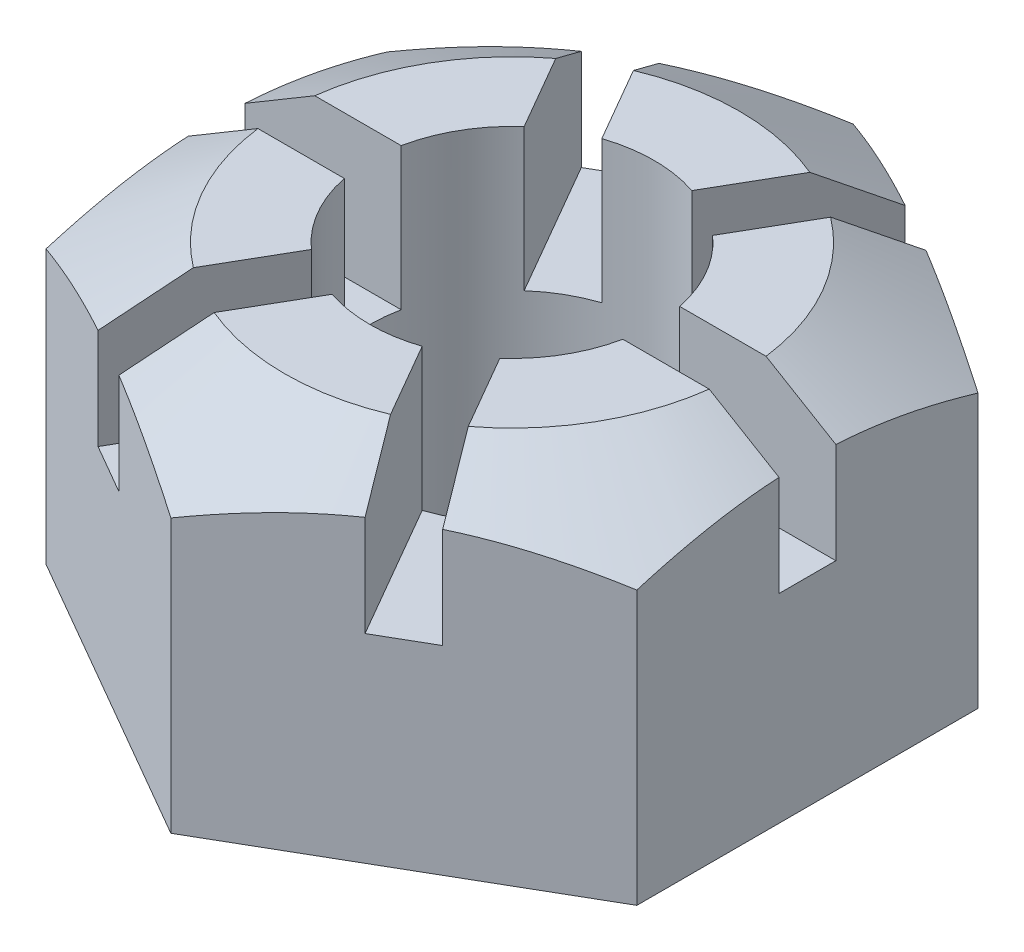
ISO-10303-21;
HEADER;
FILE_DESCRIPTION(('STEP AP214'),'2;1');
FILE_NAME('part.step','',(''),(''),'','','');
FILE_SCHEMA(('AUTOMOTIVE_DESIGN { 1 0 10303 214 1 1 1 1 }'));
ENDSEC;
DATA;
#1=APPLICATION_CONTEXT('core data for automotive mechanical design processes');
#2=APPLICATION_PROTOCOL_DEFINITION('international standard','automotive_design',2000,#1);
#3=PRODUCT_CONTEXT('',#1,'mechanical');
#4=PRODUCT('Part','Part','',(#3));
#5=PRODUCT_RELATED_PRODUCT_CATEGORY('part','',(#4));
#6=PRODUCT_DEFINITION_FORMATION('','',#4);
#7=PRODUCT_DEFINITION_CONTEXT('part definition',#1,'design');
#8=PRODUCT_DEFINITION('design','',#6,#7);
#9=PRODUCT_DEFINITION_SHAPE('','',#8);
#10=(LENGTH_UNIT() NAMED_UNIT(*) SI_UNIT(.MILLI.,.METRE.));
#11=(NAMED_UNIT(*) PLANE_ANGLE_UNIT() SI_UNIT($,.RADIAN.));
#12=(NAMED_UNIT(*) SI_UNIT($,.STERADIAN.) SOLID_ANGLE_UNIT());
#13=UNCERTAINTY_MEASURE_WITH_UNIT(LENGTH_MEASURE(1.E-05),#10,'distance_accuracy_value','');
#14=(GEOMETRIC_REPRESENTATION_CONTEXT(3) GLOBAL_UNCERTAINTY_ASSIGNED_CONTEXT((#13)) GLOBAL_UNIT_ASSIGNED_CONTEXT((#10,
#11,#12)) REPRESENTATION_CONTEXT('',''));
#15=CARTESIAN_POINT('',(0.,0.,0.));
#16=DIRECTION('',(0.,0.,1.));
#17=DIRECTION('',(1.,0.,0.));
#18=AXIS2_PLACEMENT_3D('',#15,#16,#17);
#19=CARTESIAN_POINT('',(0.,30.,0.));
#20=DIRECTION('',(0.,1.,0.));
#21=DIRECTION('',(0.,0.,1.));
#22=AXIS2_PLACEMENT_3D('',#19,#20,#21);
#23=PLANE('',#22);
#24=CARTESIAN_POINT('',(0.,29.9999999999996,3.64838475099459E-13));
#25=DIRECTION('',(0.,-1.,0.));
#26=DIRECTION('',(0.,0.,-1.));
#27=AXIS2_PLACEMENT_3D('',#24,#25,#26);
#28=CIRCLE('',#27,40.0000000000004);
#29=CARTESIAN_POINT('',(15.5130078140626,29.9999999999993,36.8693177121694));
#30=VERTEX_POINT('',#29);
#31=CARTESIAN_POINT('',(-15.513007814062,30.,36.8693177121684));
#32=VERTEX_POINT('',#31);
#33=EDGE_CURVE('E550',#30,#32,#28,.T.);
#34=ORIENTED_EDGE('',*,*,#33,.F.);
#35=DIRECTION('',(-0.5,0.,-0.866025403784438));
#36=VECTOR('',#35,1.);
#37=CARTESIAN_POINT('',(25.6698729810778,30.,54.4615242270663));
#38=LINE('',#37,#36);
#39=CARTESIAN_POINT('',(7.91732169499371,30.,23.7132034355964));
#40=VERTEX_POINT('',#39);
#41=EDGE_CURVE('E738',#30,#40,#38,.T.);
#42=ORIENTED_EDGE('',*,*,#41,.T.);
#43=CARTESIAN_POINT('',(0.,30.,0.));
#44=DIRECTION('',(0.,1.,0.));
#45=DIRECTION('',(0.,0.,1.));
#46=AXIS2_PLACEMENT_3D('',#43,#44,#45);
#47=CIRCLE('',#46,25.);
#48=CARTESIAN_POINT('',(-7.91732169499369,30.,23.7132034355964));
#49=VERTEX_POINT('',#48);
#50=EDGE_CURVE('E766',#49,#40,#47,.T.);
#51=ORIENTED_EDGE('',*,*,#50,.F.);
#52=DIRECTION('',(-0.5,0.,0.866025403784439));
#53=VECTOR('',#52,1.);
#54=CARTESIAN_POINT('',(34.3301270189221,30.,-49.4615242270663));
#55=LINE('',#54,#53);
#56=EDGE_CURVE('E351',#49,#32,#55,.T.);
#57=ORIENTED_EDGE('',*,*,#56,.T.);
#58=EDGE_LOOP('',(#34,#42,#51,#57));
#59=FACE_BOUND('',#58,.T.);
#60=ADVANCED_FACE('F111',(#59),#23,.T.);
#61=CARTESIAN_POINT('',(-16.5775757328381,30.,-18.7132034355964));
#62=VERTEX_POINT('',#61);
#63=CARTESIAN_POINT('',(-24.4948974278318,30.,-4.99999999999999));
#64=VERTEX_POINT('',#63);
#65=EDGE_CURVE('E736',#62,#64,#47,.T.);
#66=ORIENTED_EDGE('',*,*,#65,.F.);
#67=CARTESIAN_POINT('',(-24.1732618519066,30.,-31.8693177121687));
#68=VERTEX_POINT('',#67);
#69=EDGE_CURVE('E735',#62,#68,#38,.T.);
#70=ORIENTED_EDGE('',*,*,#69,.T.);
#71=CARTESIAN_POINT('',(-39.6862696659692,29.9999999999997,-4.99999999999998));
#72=VERTEX_POINT('',#71);
#73=EDGE_CURVE('E560',#72,#68,#28,.T.);
#74=ORIENTED_EDGE('',*,*,#73,.F.);
#75=DIRECTION('',(1.,0.,0.));
#76=VECTOR('',#75,1.);
#77=CARTESIAN_POINT('',(-60.,30.,-4.99999999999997));
#78=LINE('',#77,#76);
#79=EDGE_CURVE('E733',#72,#64,#78,.T.);
#80=ORIENTED_EDGE('',*,*,#79,.T.);
#81=EDGE_LOOP('',(#66,#70,#74,#80));
#82=FACE_BOUND('',#81,.T.);
#83=ADVANCED_FACE('F500',(#82),#23,.T.);
#84=CARTESIAN_POINT('',(24.1732618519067,29.9999999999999,-31.8693177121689));
#85=VERTEX_POINT('',#84);
#86=CARTESIAN_POINT('',(39.6862696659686,30.,-5.00000000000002));
#87=VERTEX_POINT('',#86);
#88=EDGE_CURVE('E549',#85,#87,#28,.T.);
#89=ORIENTED_EDGE('',*,*,#88,.F.);
#90=CARTESIAN_POINT('',(16.5775757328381,30.,-18.7132034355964));
#91=VERTEX_POINT('',#90);
#92=EDGE_CURVE('E759',#85,#91,#55,.T.);
#93=ORIENTED_EDGE('',*,*,#92,.T.);
#94=CARTESIAN_POINT('',(24.4948974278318,30.,-5.00000000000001));
#95=VERTEX_POINT('',#94);
#96=EDGE_CURVE('E807',#95,#91,#47,.T.);
#97=ORIENTED_EDGE('',*,*,#96,.F.);
#98=EDGE_CURVE('E750',#95,#87,#78,.T.);
#99=ORIENTED_EDGE('',*,*,#98,.T.);
#100=EDGE_LOOP('',(#89,#93,#97,#99));
#101=FACE_BOUND('',#100,.T.);
#102=ADVANCED_FACE('F508',(#101),#23,.T.);
#103=DIRECTION('',(-0.5,0.,-0.866025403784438));
#104=VECTOR('',#103,1.);
#105=CARTESIAN_POINT('',(34.3301270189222,30.,49.4615242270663));
#106=LINE('',#105,#104);
#107=CARTESIAN_POINT('',(-7.91732169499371,30.,-23.7132034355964));
#108=VERTEX_POINT('',#107);
#109=CARTESIAN_POINT('',(-15.5130078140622,30.,-36.8693177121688));
#110=VERTEX_POINT('',#109);
#111=EDGE_CURVE('E545',#108,#110,#106,.T.);
#112=ORIENTED_EDGE('',*,*,#111,.F.);
#113=CARTESIAN_POINT('',(7.91732169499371,30.,-23.7132034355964));
#114=VERTEX_POINT('',#113);
#115=EDGE_CURVE('E808',#114,#108,#47,.T.);
#116=ORIENTED_EDGE('',*,*,#115,.F.);
#117=DIRECTION('',(-0.5,0.,0.866025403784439));
#118=VECTOR('',#117,1.);
#119=CARTESIAN_POINT('',(25.6698729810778,30.,-54.4615242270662));
#120=LINE('',#119,#118);
#121=CARTESIAN_POINT('',(15.5130078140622,30.,-36.8693177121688));
#122=VERTEX_POINT('',#121);
#123=EDGE_CURVE('E365',#122,#114,#120,.T.);
#124=ORIENTED_EDGE('',*,*,#123,.F.);
#125=EDGE_CURVE('E554',#110,#122,#28,.T.);
#126=ORIENTED_EDGE('',*,*,#125,.F.);
#127=EDGE_LOOP('',(#112,#116,#124,#126));
#128=FACE_BOUND('',#127,.T.);
#129=ADVANCED_FACE('F526',(#128),#23,.T.);
#130=CARTESIAN_POINT('',(24.1732618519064,30.,31.8693177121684));
#131=VERTEX_POINT('',#130);
#132=CARTESIAN_POINT('',(16.5775757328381,30.,18.7132034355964));
#133=VERTEX_POINT('',#132);
#134=EDGE_CURVE('E538',#131,#133,#106,.T.);
#135=ORIENTED_EDGE('',*,*,#134,.F.);
#136=CARTESIAN_POINT('',(39.6862696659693,29.9999999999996,4.99999999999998));
#137=VERTEX_POINT('',#136);
#138=EDGE_CURVE('E540',#137,#131,#28,.T.);
#139=ORIENTED_EDGE('',*,*,#138,.F.);
#140=DIRECTION('',(1.,0.,0.));
#141=VECTOR('',#140,1.);
#142=CARTESIAN_POINT('',(-60.,30.,5.00000000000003));
#143=LINE('',#142,#141);
#144=CARTESIAN_POINT('',(24.4948974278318,30.,4.99999999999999));
#145=VERTEX_POINT('',#144);
#146=EDGE_CURVE('E754',#145,#137,#143,.T.);
#147=ORIENTED_EDGE('',*,*,#146,.F.);
#148=EDGE_CURVE('E542',#133,#145,#47,.T.);
#149=ORIENTED_EDGE('',*,*,#148,.F.);
#150=EDGE_LOOP('',(#135,#139,#147,#149));
#151=FACE_BOUND('',#150,.T.);
#152=ADVANCED_FACE('F515',(#151),#23,.T.);
#153=CARTESIAN_POINT('',(51.9615242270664,30.,29.9999999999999));
#154=DIRECTION('',(-1.,0.,0.));
#155=DIRECTION('',(0.,0.,1.));
#156=AXIS2_PLACEMENT_3D('',#153,#154,#155);
#157=PLANE('',#156);
#158=DIRECTION('',(0.,1.,0.));
#159=VECTOR('',#158,1.);
#160=CARTESIAN_POINT('',(51.9615242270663,30.,-5.00000000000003));
#161=LINE('',#160,#159);
#162=CARTESIAN_POINT('',(51.9615242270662,5.,-5.00000000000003));
#163=VERTEX_POINT('',#162);
#164=CARTESIAN_POINT('',(51.9615242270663,22.7005871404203,-5.00000000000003));
#165=VERTEX_POINT('',#164);
#166=EDGE_CURVE('E646',#163,#165,#161,.T.);
#167=ORIENTED_EDGE('',*,*,#166,.F.);
#168=DIRECTION('',(0.,0.,1.));
#169=VECTOR('',#168,1.);
#170=CARTESIAN_POINT('',(51.9615242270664,5.,29.9999999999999));
#171=LINE('',#170,#169);
#172=CARTESIAN_POINT('',(51.9615242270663,5.,4.99999999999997));
#173=VERTEX_POINT('',#172);
#174=EDGE_CURVE('E639',#163,#173,#171,.T.);
#175=ORIENTED_EDGE('',*,*,#174,.T.);
#176=DIRECTION('',(0.,1.,0.));
#177=VECTOR('',#176,1.);
#178=CARTESIAN_POINT('',(51.9615242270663,30.,4.99999999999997));
#179=LINE('',#178,#177);
#180=CARTESIAN_POINT('',(51.9615242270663,22.7005871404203,4.99999999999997));
#181=VERTEX_POINT('',#180);
#182=EDGE_CURVE('E638',#173,#181,#179,.T.);
#183=ORIENTED_EDGE('',*,*,#182,.T.);
#184=CARTESIAN_POINT('',(51.961524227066,-8.85428935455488,-91.1815303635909));
#185=CARTESIAN_POINT('',(51.961524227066,-8.30827183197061,-90.1310049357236));
#186=CARTESIAN_POINT('',(51.961524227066,-7.76406234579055,-89.0795381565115));
#187=CARTESIAN_POINT('',(51.961524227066,-6.6796159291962,-86.9745527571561));
#188=CARTESIAN_POINT('',(51.961524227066,-6.13937901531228,-85.921034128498));
#189=CARTESIAN_POINT('',(51.961524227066,-5.0632074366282,-83.8117232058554));
#190=CARTESIAN_POINT('',(51.961524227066,-4.5272730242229,-82.7559307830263));
#191=CARTESIAN_POINT('',(51.961524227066,-3.46015703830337,-80.6419488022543));
#192=CARTESIAN_POINT('',(51.961524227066,-2.9289754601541,-79.5837592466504));
#193=CARTESIAN_POINT('',(51.961524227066,-1.34136389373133,-76.4015444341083));
#194=CARTESIAN_POINT('',(51.961524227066,-0.292771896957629,-74.2735989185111));
#195=CARTESIAN_POINT('',(51.9615242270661,1.77910110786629,-70.0054338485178));
#196=CARTESIAN_POINT('',(51.9615242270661,2.80238255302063,-67.8652145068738));
#197=CARTESIAN_POINT('',(51.9615242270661,4.33745521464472,-64.5939991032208));
#198=CARTESIAN_POINT('',(51.9615242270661,4.86052437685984,-63.4682915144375));
#199=CARTESIAN_POINT('',(51.9615242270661,5.8971467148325,-61.2125061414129));
#200=CARTESIAN_POINT('',(51.9615242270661,6.41069994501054,-60.082428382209));
#201=CARTESIAN_POINT('',(51.9615242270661,7.4271855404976,-57.8174383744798));
#202=CARTESIAN_POINT('',(51.9615242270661,7.93011740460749,-56.6825259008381));
#203=CARTESIAN_POINT('',(51.9615242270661,8.9240310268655,-54.4074762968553));
#204=CARTESIAN_POINT('',(51.9615242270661,9.41501280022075,-53.267339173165));
#205=CARTESIAN_POINT('',(51.9615242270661,10.3832616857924,-50.9820033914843));
#206=CARTESIAN_POINT('',(51.9615242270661,10.8605363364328,-49.8368079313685));
#207=CARTESIAN_POINT('',(51.9615242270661,11.79994980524,-47.5402094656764));
#208=CARTESIAN_POINT('',(51.9615242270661,12.2620885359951,-46.3888064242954));
#209=CARTESIAN_POINT('',(51.9615242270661,13.1692362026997,-44.0793588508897));
#210=CARTESIAN_POINT('',(51.9615242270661,13.6142464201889,-42.9213148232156));
#211=CARTESIAN_POINT('',(51.9615242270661,14.4849257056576,-40.5979955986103));
#212=CARTESIAN_POINT('',(51.9615242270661,14.9105951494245,-39.432720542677));
#213=CARTESIAN_POINT('',(51.9615242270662,15.8351415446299,-36.8263971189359));
#214=CARTESIAN_POINT('',(51.9615242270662,16.3284352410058,-35.3833583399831));
#215=CARTESIAN_POINT('',(51.9615242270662,17.2766178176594,-32.4846795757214));
#216=CARTESIAN_POINT('',(51.9615242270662,17.7315069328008,-31.0290396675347));
#217=CARTESIAN_POINT('',(51.9615242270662,18.5967937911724,-28.104398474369));
#218=CARTESIAN_POINT('',(51.9615242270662,19.0071878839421,-26.635396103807));
#219=CARTESIAN_POINT('',(51.9615242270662,19.7766630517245,-23.6839354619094));
#220=CARTESIAN_POINT('',(51.9615242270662,20.1357442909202,-22.2014772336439));
#221=CARTESIAN_POINT('',(51.9615242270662,20.7895878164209,-19.2497573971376));
#222=CARTESIAN_POINT('',(51.9615242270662,21.0853721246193,-17.7807236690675));
#223=CARTESIAN_POINT('',(51.9615242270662,21.6136725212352,-14.8312531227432));
#224=CARTESIAN_POINT('',(51.9615242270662,21.8461894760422,-13.3508164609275));
#225=CARTESIAN_POINT('',(51.9615242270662,22.2416856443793,-10.3811744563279));
#226=CARTESIAN_POINT('',(51.9615242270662,22.4046912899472,-8.8919726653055));
#227=CARTESIAN_POINT('',(51.9615242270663,22.6564198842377,-5.90725871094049));
#228=CARTESIAN_POINT('',(51.9615242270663,22.7451435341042,-4.41174660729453));
#229=CARTESIAN_POINT('',(51.9615242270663,22.845976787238,-1.40229903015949));
#230=CARTESIAN_POINT('',(51.9615242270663,22.8572674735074,0.111664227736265));
#231=CARTESIAN_POINT('',(51.9615242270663,22.8006807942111,3.13810046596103));
#232=CARTESIAN_POINT('',(51.9615242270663,22.7328030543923,4.65057343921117));
#233=CARTESIAN_POINT('',(51.9615242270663,22.5201159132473,7.67045713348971));
#234=CARTESIAN_POINT('',(51.9615242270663,22.3752857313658,9.17786637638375));
#235=CARTESIAN_POINT('',(51.9615242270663,22.0132126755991,12.1839071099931));
#236=CARTESIAN_POINT('',(51.9615242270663,21.7959684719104,13.6825384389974));
#237=CARTESIAN_POINT('',(51.9615242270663,21.2905984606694,16.6959167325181));
#238=CARTESIAN_POINT('',(51.9615242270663,21.0012482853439,18.2104567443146));
#239=CARTESIAN_POINT('',(51.9615242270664,20.361116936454,21.2264106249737));
#240=CARTESIAN_POINT('',(51.9615242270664,20.0103352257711,22.7278243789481));
#241=CARTESIAN_POINT('',(51.9615242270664,19.2547721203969,25.7170915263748));
#242=CARTESIAN_POINT('',(51.9615242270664,18.8499847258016,27.2049433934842));
#243=CARTESIAN_POINT('',(51.9615242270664,17.9935538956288,30.1670459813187));
#244=CARTESIAN_POINT('',(51.9615242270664,17.5419100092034,31.6412965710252));
#245=CARTESIAN_POINT('',(51.9615242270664,16.6540885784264,34.4030164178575));
#246=CARTESIAN_POINT('',(51.9615242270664,16.2224079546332,35.6919395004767));
#247=CARTESIAN_POINT('',(51.9615242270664,15.331570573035,38.2602865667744));
#248=CARTESIAN_POINT('',(51.9615242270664,14.8724128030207,39.539710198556));
#249=CARTESIAN_POINT('',(51.9615242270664,13.9300434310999,42.0898547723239));
#250=CARTESIAN_POINT('',(51.9615242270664,13.4468283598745,43.3605744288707));
#251=CARTESIAN_POINT('',(51.9615242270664,12.4594372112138,45.893811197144));
#252=CARTESIAN_POINT('',(51.9615242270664,11.9552613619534,47.156328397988));
#253=CARTESIAN_POINT('',(51.9615242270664,10.9280736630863,49.675070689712));
#254=CARTESIAN_POINT('',(51.9615242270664,10.4050442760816,50.9312886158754));
#255=CARTESIAN_POINT('',(51.9615242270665,9.34286921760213,53.4368857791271));
#256=CARTESIAN_POINT('',(51.9615242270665,8.80372350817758,54.6862650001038));
#257=CARTESIAN_POINT('',(51.9615242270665,7.71131087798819,57.1787063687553));
#258=CARTESIAN_POINT('',(51.9615242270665,7.15804510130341,58.4217690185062));
#259=CARTESIAN_POINT('',(51.9615242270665,6.03902871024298,60.902254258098));
#260=CARTESIAN_POINT('',(51.9615242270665,5.47327811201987,62.1396768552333));
#261=CARTESIAN_POINT('',(51.9615242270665,4.35842238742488,64.5495604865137));
#262=CARTESIAN_POINT('',(51.9615242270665,3.80983942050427,65.7222633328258));
#263=CARTESIAN_POINT('',(51.9615242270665,2.70374986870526,68.063457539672));
#264=CARTESIAN_POINT('',(51.9615242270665,2.14624323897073,69.2319488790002));
#265=CARTESIAN_POINT('',(51.9615242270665,1.02323542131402,71.5651125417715));
#266=CARTESIAN_POINT('',(51.9615242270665,0.457734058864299,72.7297847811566));
#267=CARTESIAN_POINT('',(51.9615242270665,-0.680433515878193,75.0556235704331));
#268=CARTESIAN_POINT('',(51.9615242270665,-1.25309973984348,76.2167901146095));
#269=CARTESIAN_POINT('',(51.9615242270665,-2.40319136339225,78.5325206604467));
#270=CARTESIAN_POINT('',(51.9615242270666,-2.9805978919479,79.6870940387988));
#271=CARTESIAN_POINT('',(51.9615242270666,-4.14119898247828,81.9933287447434));
#272=CARTESIAN_POINT('',(51.9615242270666,-4.72439355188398,83.1449900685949));
#273=CARTESIAN_POINT('',(51.9615242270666,-5.89596805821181,85.4455461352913));
#274=CARTESIAN_POINT('',(51.9615242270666,-6.48434754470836,86.5944411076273));
#275=CARTESIAN_POINT('',(51.9615242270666,-7.66586603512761,88.8897733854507));
#276=CARTESIAN_POINT('',(51.9615242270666,-8.25900501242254,90.0362107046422));
#277=CARTESIAN_POINT('',(51.9615242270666,-8.85428935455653,91.1815303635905));
#278=B_SPLINE_CURVE_WITH_KNOTS('',3,(#184,#185,#186,#187,#188,#189,#190,#191,#192,#193,#194,
#195,#196,#197,#198,#199,#200,#201,#202,#203,#204,#205,#206,#207,#208,#209,#210,#211,#212,#213,
#214,#215,#216,#217,#218,#219,#220,#221,#222,#223,#224,#225,#226,#227,#228,#229,#230,#231,#232,
#233,#234,#235,#236,#237,#238,#239,#240,#241,#242,#243,#244,#245,#246,#247,#248,#249,#250,#251,
#252,#253,#254,#255,#256,#257,#258,#259,#260,#261,#262,#263,#264,#265,#266,#267,#268,#269,#270,
#271,#272,#273,#274,#275,#276,#277),.UNSPECIFIED.,.F.,.F.,(4,2,2,2,2,2,2,2,2,2,2,2,2,2,2,2,2,2,
2,2,2,2,2,2,2,2,2,2,2,2,2,2,2,2,2,2,2,2,2,2,2,2,2,2,2,2,4),(0.,3.5518518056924,7.10371838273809,
10.6557918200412,14.2078617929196,21.3245549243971,28.44112506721,32.1649806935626,
35.8888150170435,39.6128246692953,43.3368295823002,47.0587456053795,50.7806831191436,
54.5023416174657,58.2239277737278,62.7985282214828,67.373100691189,71.9480481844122,
76.5229810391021,81.0172855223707,85.5115284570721,90.0040609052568,94.4965509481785,
99.0364804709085,103.576431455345,108.117609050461,112.658870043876,117.283235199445,
121.907640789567,126.532560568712,131.157524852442,135.235058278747,139.312742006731,
143.391015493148,147.469244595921,151.551370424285,155.633505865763,159.715311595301,
163.797112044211,167.6810863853,171.565080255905,175.449159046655,179.333244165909,
183.205943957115,187.078648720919,190.951020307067,194.823370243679),.UNSPECIFIED.);
#279=CARTESIAN_POINT('',(51.9615242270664,18.0352524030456,30.0000000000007));
#280=VERTEX_POINT('',#279);
#281=EDGE_CURVE('E600',#181,#280,#278,.T.);
#282=ORIENTED_EDGE('',*,*,#281,.T.);
#283=DIRECTION('',(0.,-1.,0.));
#284=VECTOR('',#283,1.);
#285=CARTESIAN_POINT('',(51.9615242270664,30.,29.9999999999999));
#286=LINE('',#285,#284);
#287=CARTESIAN_POINT('',(51.9615242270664,-30.,29.9999999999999));
#288=VERTEX_POINT('',#287);
#289=EDGE_CURVE('E633',#280,#288,#286,.T.);
#290=ORIENTED_EDGE('',*,*,#289,.T.);
#291=DIRECTION('',(0.,0.,-1.));
#292=VECTOR('',#291,1.);
#293=CARTESIAN_POINT('',(51.9615242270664,-30.,29.9999999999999));
#294=LINE('',#293,#292);
#295=CARTESIAN_POINT('',(51.9615242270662,-30.,-30.0000000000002));
#296=VERTEX_POINT('',#295);
#297=EDGE_CURVE('E798',#288,#296,#294,.T.);
#298=ORIENTED_EDGE('',*,*,#297,.T.);
#299=DIRECTION('',(0.,-1.,0.));
#300=VECTOR('',#299,1.);
#301=CARTESIAN_POINT('',(51.9615242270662,30.,-30.0000000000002));
#302=LINE('',#301,#300);
#303=CARTESIAN_POINT('',(51.9615242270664,18.0352524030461,-30.0000000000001));
#304=VERTEX_POINT('',#303);
#305=EDGE_CURVE('E779',#304,#296,#302,.T.);
#306=ORIENTED_EDGE('',*,*,#305,.F.);
#307=EDGE_CURVE('E602',#304,#165,#278,.T.);
#308=ORIENTED_EDGE('',*,*,#307,.T.);
#309=EDGE_LOOP('',(#167,#175,#183,#282,#290,#298,#306,#308));
#310=FACE_BOUND('',#309,.T.);
#311=ADVANCED_FACE('F525',(#310),#157,.F.);
#312=CARTESIAN_POINT('',(0.,-100.710678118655,0.));
#313=DIRECTION('',(0.,1.,0.));
#314=DIRECTION('',(0.,0.,1.));
#315=AXIS2_PLACEMENT_3D('',#312,#313,#314);
#316=CYLINDRICAL_SURFACE('',#315,25.);
#317=CARTESIAN_POINT('',(0.,-30.,0.));
#318=DIRECTION('',(0.,1.,0.));
#319=DIRECTION('',(0.,0.,1.));
#320=AXIS2_PLACEMENT_3D('',#317,#318,#319);
#321=CIRCLE('',#320,25.);
#322=CARTESIAN_POINT('',(0.,-30.,25.));
#323=VERTEX_POINT('',#322);
#324=EDGE_CURVE('E803',#323,#323,#321,.F.);
#325=ORIENTED_EDGE('',*,*,#324,.T.);
#326=EDGE_LOOP('',(#325));
#327=FACE_BOUND('',#326,.T.);
#328=CARTESIAN_POINT('',(0.,5.,0.));
#329=DIRECTION('',(0.,-1.,0.));
#330=DIRECTION('',(0.,0.,-1.));
#331=AXIS2_PLACEMENT_3D('',#328,#329,#330);
#332=CIRCLE('',#331,25.);
#333=CARTESIAN_POINT('',(7.91732169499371,5.,23.7132034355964));
#334=VERTEX_POINT('',#333);
#335=CARTESIAN_POINT('',(16.5775757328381,5.,18.7132034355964));
#336=VERTEX_POINT('',#335);
#337=EDGE_CURVE('E12',#334,#336,#332,.F.);
#338=ORIENTED_EDGE('',*,*,#337,.T.);
#339=DIRECTION('',(0.,1.,0.));
#340=VECTOR('',#339,1.);
#341=CARTESIAN_POINT('',(16.5775757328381,-100.710678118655,18.7132034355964));
#342=LINE('',#341,#340);
#343=EDGE_CURVE('E680',#336,#133,#342,.T.);
#344=ORIENTED_EDGE('',*,*,#343,.T.);
#345=ORIENTED_EDGE('',*,*,#148,.T.);
#346=DIRECTION('',(0.,1.,0.));
#347=VECTOR('',#346,1.);
#348=CARTESIAN_POINT('',(24.4948974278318,-100.710678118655,4.99999999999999));
#349=LINE('',#348,#347);
#350=CARTESIAN_POINT('',(24.4948974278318,5.,4.99999999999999));
#351=VERTEX_POINT('',#350);
#352=EDGE_CURVE('E642',#145,#351,#349,.F.);
#353=ORIENTED_EDGE('',*,*,#352,.T.);
#354=CARTESIAN_POINT('',(24.4948974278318,5.,-5.00000000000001));
#355=VERTEX_POINT('',#354);
#356=EDGE_CURVE('E374',#351,#355,#332,.F.);
#357=ORIENTED_EDGE('',*,*,#356,.T.);
#358=DIRECTION('',(0.,1.,0.));
#359=VECTOR('',#358,1.);
#360=CARTESIAN_POINT('',(24.4948974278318,-100.710678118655,-5.00000000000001));
#361=LINE('',#360,#359);
#362=EDGE_CURVE('E654',#95,#355,#361,.F.);
#363=ORIENTED_EDGE('',*,*,#362,.F.);
#364=ORIENTED_EDGE('',*,*,#96,.T.);
#365=DIRECTION('',(0.,1.,0.));
#366=VECTOR('',#365,1.);
#367=CARTESIAN_POINT('',(16.5775757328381,-100.710678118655,-18.7132034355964));
#368=LINE('',#367,#366);
#369=CARTESIAN_POINT('',(16.5775757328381,5.,-18.7132034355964));
#370=VERTEX_POINT('',#369);
#371=EDGE_CURVE('E658',#370,#91,#368,.T.);
#372=ORIENTED_EDGE('',*,*,#371,.F.);
#373=CARTESIAN_POINT('',(7.91732169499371,5.,-23.7132034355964));
#374=VERTEX_POINT('',#373);
#375=EDGE_CURVE('E1010',#370,#374,#332,.F.);
#376=ORIENTED_EDGE('',*,*,#375,.T.);
#377=DIRECTION('',(0.,1.,0.));
#378=VECTOR('',#377,1.);
#379=CARTESIAN_POINT('',(7.91732169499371,-100.710678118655,-23.7132034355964));
#380=LINE('',#379,#378);
#381=EDGE_CURVE('E663',#374,#114,#380,.T.);
#382=ORIENTED_EDGE('',*,*,#381,.T.);
#383=ORIENTED_EDGE('',*,*,#115,.T.);
#384=DIRECTION('',(0.,1.,0.));
#385=VECTOR('',#384,1.);
#386=CARTESIAN_POINT('',(-7.91732169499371,-100.710678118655,-23.7132034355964));
#387=LINE('',#386,#385);
#388=CARTESIAN_POINT('',(-7.91732169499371,5.,-23.7132034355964));
#389=VERTEX_POINT('',#388);
#390=EDGE_CURVE('E672',#108,#389,#387,.F.);
#391=ORIENTED_EDGE('',*,*,#390,.T.);
#392=CARTESIAN_POINT('',(-16.5775757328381,5.,-18.7132034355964));
#393=VERTEX_POINT('',#392);
#394=EDGE_CURVE('E121',#389,#393,#332,.F.);
#395=ORIENTED_EDGE('',*,*,#394,.T.);
#396=DIRECTION('',(0.,1.,0.));
#397=VECTOR('',#396,1.);
#398=CARTESIAN_POINT('',(-16.5775757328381,-100.710678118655,-18.7132034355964));
#399=LINE('',#398,#397);
#400=EDGE_CURVE('E667',#62,#393,#399,.F.);
#401=ORIENTED_EDGE('',*,*,#400,.F.);
#402=ORIENTED_EDGE('',*,*,#65,.T.);
#403=DIRECTION('',(0.,1.,0.));
#404=VECTOR('',#403,1.);
#405=CARTESIAN_POINT('',(-24.4948974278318,-100.710678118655,-4.99999999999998));
#406=LINE('',#405,#404);
#407=CARTESIAN_POINT('',(-24.4948974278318,5.,-4.99999999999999));
#408=VERTEX_POINT('',#407);
#409=EDGE_CURVE('E710',#408,#64,#406,.T.);
#410=ORIENTED_EDGE('',*,*,#409,.F.);
#411=CARTESIAN_POINT('',(-24.4948974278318,5.,5.00000000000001));
#412=VERTEX_POINT('',#411);
#413=EDGE_CURVE('E371',#408,#412,#332,.F.);
#414=ORIENTED_EDGE('',*,*,#413,.T.);
#415=DIRECTION('',(0.,1.,0.));
#416=VECTOR('',#415,1.);
#417=CARTESIAN_POINT('',(-24.4948974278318,-100.710678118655,5.00000000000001));
#418=LINE('',#417,#416);
#419=CARTESIAN_POINT('',(-24.4948974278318,30.,5.00000000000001));
#420=VERTEX_POINT('',#419);
#421=EDGE_CURVE('E643',#412,#420,#418,.T.);
#422=ORIENTED_EDGE('',*,*,#421,.T.);
#423=CARTESIAN_POINT('',(-16.5775757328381,30.,18.7132034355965));
#424=VERTEX_POINT('',#423);
#425=EDGE_CURVE('E805',#420,#424,#47,.T.);
#426=ORIENTED_EDGE('',*,*,#425,.T.);
#427=DIRECTION('',(0.,1.,0.));
#428=VECTOR('',#427,1.);
#429=CARTESIAN_POINT('',(-16.5775757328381,-100.710678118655,18.7132034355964));
#430=LINE('',#429,#428);
#431=CARTESIAN_POINT('',(-16.5775757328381,5.,18.7132034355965));
#432=VERTEX_POINT('',#431);
#433=EDGE_CURVE('E370',#424,#432,#430,.F.);
#434=ORIENTED_EDGE('',*,*,#433,.T.);
#435=CARTESIAN_POINT('',(-7.91732169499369,5.,23.7132034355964));
#436=VERTEX_POINT('',#435);
#437=EDGE_CURVE('E116',#432,#436,#332,.F.);
#438=ORIENTED_EDGE('',*,*,#437,.T.);
#439=DIRECTION('',(0.,1.,0.));
#440=VECTOR('',#439,1.);
#441=CARTESIAN_POINT('',(-7.91732169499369,-100.710678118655,23.7132034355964));
#442=LINE('',#441,#440);
#443=EDGE_CURVE('E346',#49,#436,#442,.F.);
#444=ORIENTED_EDGE('',*,*,#443,.F.);
#445=ORIENTED_EDGE('',*,*,#50,.T.);
#446=DIRECTION('',(0.,1.,0.));
#447=VECTOR('',#446,1.);
#448=CARTESIAN_POINT('',(7.91732169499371,-100.710678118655,23.7132034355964));
#449=LINE('',#448,#447);
#450=EDGE_CURVE('E677',#334,#40,#449,.T.);
#451=ORIENTED_EDGE('',*,*,#450,.F.);
#452=EDGE_LOOP('',(#338,#344,#345,#353,#357,#363,#364,#372,#376,#382,#383,#391,#395,#401,#402,
#410,#414,#422,#426,#434,#438,#444,#445,#451));
#453=FACE_BOUND('',#452,.T.);
#454=ADVANCED_FACE('F368',(#327,#453),#316,.F.);
#455=CARTESIAN_POINT('',(0.,29.9999999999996,3.64838475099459E-13));
#456=DIRECTION('',(0.,-1.,0.));
#457=DIRECTION('',(0.,0.,-1.));
#458=AXIS2_PLACEMENT_3D('',#455,#456,#457);
#459=CONICAL_SURFACE('',#458,40.0000000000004,1.03167387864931);
#460=CARTESIAN_POINT('',(-4.33053116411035,50.9383082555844,2.49930000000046));
#461=CARTESIAN_POINT('',(-4.27321098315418,50.9383359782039,2.59858146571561));
#462=CARTESIAN_POINT('',(-4.21589326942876,50.9359721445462,2.69785865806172));
#463=CARTESIAN_POINT('',(-4.10136366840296,50.9265847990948,2.89622974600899));
#464=CARTESIAN_POINT('',(-4.04415176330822,50.9195621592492,2.99532367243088));
#465=CARTESIAN_POINT('',(-3.93004037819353,50.9010012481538,3.19297038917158));
#466=CARTESIAN_POINT('',(-3.87314048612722,50.8894730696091,3.29152389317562));
#467=CARTESIAN_POINT('',(-3.75960058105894,50.8621280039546,3.48818077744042));
#468=CARTESIAN_POINT('',(-3.70296057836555,50.8463109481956,3.58628413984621));
#469=CARTESIAN_POINT('',(-3.53486749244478,50.793256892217,3.87742990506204));
#470=CARTESIAN_POINT('',(-3.42386403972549,50.7501798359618,4.06969352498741));
#471=CARTESIAN_POINT('',(-3.25849510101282,50.6756605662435,4.3561209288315));
#472=CARTESIAN_POINT('',(-3.20354790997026,50.649162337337,4.45129225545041));
#473=CARTESIAN_POINT('',(-3.09403540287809,50.5931805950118,4.6409734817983));
#474=CARTESIAN_POINT('',(-3.03947007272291,50.5636971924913,4.73548340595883));
#475=CARTESIAN_POINT('',(-2.8771244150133,50.4716695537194,5.01667433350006));
#476=CARTESIAN_POINT('',(-2.76990167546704,50.4051814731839,5.20238956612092));
#477=CARTESIAN_POINT('',(-2.55684575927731,50.2637754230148,5.57141323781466));
#478=CARTESIAN_POINT('',(-2.45101292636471,50.188855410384,5.75472108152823));
#479=CARTESIAN_POINT('',(-2.24049858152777,50.0322654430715,6.11934262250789));
#480=CARTESIAN_POINT('',(-2.13581822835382,49.9505892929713,6.30065431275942));
#481=CARTESIAN_POINT('',(-1.92754677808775,49.7819335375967,6.66139104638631));
#482=CARTESIAN_POINT('',(-1.82395559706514,49.6949543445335,6.84081623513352));
#483=CARTESIAN_POINT('',(-1.61736252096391,49.5164703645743,7.19864593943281));
#484=CARTESIAN_POINT('',(-1.51436357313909,49.4249519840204,7.37704535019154));
#485=CARTESIAN_POINT('',(-1.30914671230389,49.2384796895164,7.73249137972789));
#486=CARTESIAN_POINT('',(-1.20692881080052,49.1435257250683,7.90953797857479));
#487=CARTESIAN_POINT('',(-1.00320430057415,48.9508773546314,8.26239918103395));
#488=CARTESIAN_POINT('',(-0.901697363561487,48.8531843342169,8.43821435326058));
#489=CARTESIAN_POINT('',(-0.699241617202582,48.6555089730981,8.78887799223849));
#490=CARTESIAN_POINT('',(-0.598292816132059,48.555526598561,8.96372644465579));
#491=CARTESIAN_POINT('',(-0.292074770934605,48.2486719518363,9.49411165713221));
#492=CARTESIAN_POINT('',(-0.0875508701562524,48.0388252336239,9.84835744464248));
#493=CARTESIAN_POINT('',(0.320091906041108,47.6136710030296,10.5544154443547));
#494=CARTESIAN_POINT('',(0.523210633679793,47.3983629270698,10.9062274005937));
#495=CARTESIAN_POINT('',(0.927958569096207,46.9642606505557,11.6072713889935));
#496=CARTESIAN_POINT('',(1.12959002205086,46.7454748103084,11.9565073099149));
#497=CARTESIAN_POINT('',(1.53204390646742,46.3049882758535,12.6535778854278));
#498=CARTESIAN_POINT('',(1.73286636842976,46.0832876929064,13.0014125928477));
#499=CARTESIAN_POINT('',(2.12987848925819,45.6421156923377,13.6890577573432));
#500=CARTESIAN_POINT('',(2.32608043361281,45.4226884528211,14.0288894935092));
#501=CARTESIAN_POINT('',(2.71801234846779,44.9821536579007,14.7077354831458));
#502=CARTESIAN_POINT('',(2.91374231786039,44.761046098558,15.0467497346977));
#503=CARTESIAN_POINT('',(3.50037263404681,44.0957321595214,16.0628232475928));
#504=CARTESIAN_POINT('',(3.89070947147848,43.6495388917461,16.7389064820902));
#505=CARTESIAN_POINT('',(4.67039738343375,42.7536440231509,18.089365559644));
#506=CARTESIAN_POINT('',(5.05974841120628,42.3039422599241,18.7637413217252));
#507=CARTESIAN_POINT('',(5.83774296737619,41.4020955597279,20.1112674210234));
#508=CARTESIAN_POINT('',(6.22638649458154,40.9499506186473,20.7844177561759));
#509=CARTESIAN_POINT('',(7.00348700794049,40.0435136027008,22.1303953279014));
#510=CARTESIAN_POINT('',(7.39194355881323,39.5892200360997,22.803221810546));
#511=CARTESIAN_POINT('',(8.16846945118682,38.6793091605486,24.1482041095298));
#512=CARTESIAN_POINT('',(8.55653879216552,38.2236918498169,24.8203599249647));
#513=CARTESIAN_POINT('',(9.72028616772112,36.8553642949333,26.8360295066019));
#514=CARTESIAN_POINT('',(10.4955235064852,35.9411551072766,28.1787799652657));
#515=CARTESIAN_POINT('',(12.0373413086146,34.1196342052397,30.849286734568));
#516=CARTESIAN_POINT('',(12.8039291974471,33.2123476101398,32.1770559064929));
#517=CARTESIAN_POINT('',(14.3366273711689,31.3961399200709,34.8317670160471));
#518=CARTESIAN_POINT('',(15.1027376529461,30.4872188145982,36.1587089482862));
#519=CARTESIAN_POINT('',(16.6344491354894,28.6684405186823,38.8117110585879));
#520=CARTESIAN_POINT('',(17.4000504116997,27.758583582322,40.1377713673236));
#521=CARTESIAN_POINT('',(18.9310052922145,25.9380420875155,42.7894630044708));
#522=CARTESIAN_POINT('',(19.6963588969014,25.0273575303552,44.1150943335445));
#523=CARTESIAN_POINT('',(20.8862219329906,23.6108990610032,46.1759975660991));
#524=CARTESIAN_POINT('',(21.3107955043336,23.1053406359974,46.9113805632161));
#525=CARTESIAN_POINT('',(22.1599099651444,22.0940376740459,48.382089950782));
#526=CARTESIAN_POINT('',(22.5844508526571,21.5882931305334,49.1174163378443));
#527=CARTESIAN_POINT('',(23.4352086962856,20.5746122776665,50.5909721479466));
#528=CARTESIAN_POINT('',(23.8614254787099,20.0666753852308,51.3292012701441));
#529=CARTESIAN_POINT('',(24.7138042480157,19.0506946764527,52.8055646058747));
#530=CARTESIAN_POINT('',(25.1399662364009,18.542650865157,53.5436988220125));
#531=CARTESIAN_POINT('',(25.5661119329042,18.0345524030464,54.281804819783));
#532=B_SPLINE_CURVE_WITH_KNOTS('',3,(#460,#461,#462,#463,#464,#465,#466,#467,#468,#469,#470,
#471,#472,#473,#474,#475,#476,#477,#478,#479,#480,#481,#482,#483,#484,#485,#486,#487,#488,#489,
#490,#491,#492,#493,#494,#495,#496,#497,#498,#499,#500,#501,#502,#503,#504,#505,#506,#507,#508,
#509,#510,#511,#512,#513,#514,#515,#516,#517,#518,#519,#520,#521,#522,#523,#524,#525,#526,#527,
#528,#529,#530,#531),.UNSPECIFIED.,.F.,.F.,(4,2,2,2,2,2,2,2,2,2,2,2,2,2,2,2,2,2,2,2,2,2,2,2,2,2,
2,2,2,2,2,2,2,2,2,4),(0.,0.343887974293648,0.687711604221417,1.03076942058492,1.37384072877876,
2.05170833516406,2.39081161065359,2.72990229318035,3.40320777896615,4.07667675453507,
4.750770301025,5.42481151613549,6.1010100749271,6.77721857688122,7.45309097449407,
8.12897336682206,9.50810837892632,10.8873862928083,12.2637394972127,13.6400403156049,
14.9887982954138,16.3375594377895,19.0351086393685,21.7327834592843,24.4304628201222,
27.1304222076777,29.830385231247,35.2301726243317,40.5747175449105,45.9192969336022,
51.2626839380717,56.6060626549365,59.5708158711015,62.5356862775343,65.5125614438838,
68.4893184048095),.UNSPECIFIED.);
#533=CARTESIAN_POINT('',(21.650635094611,22.70058714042,47.5));
#534=VERTEX_POINT('',#533);
#535=EDGE_CURVE('E376',#30,#534,#532,.T.);
#536=ORIENTED_EDGE('',*,*,#535,.F.);
#537=ORIENTED_EDGE('',*,*,#33,.T.);
#538=CARTESIAN_POINT('',(-25.5661119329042,18.0345524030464,54.281804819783));
#539=CARTESIAN_POINT('',(-24.7711216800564,18.98241916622,52.9048413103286));
#540=CARTESIAN_POINT('',(-23.9760781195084,19.930107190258,51.527785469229));
#541=CARTESIAN_POINT('',(-22.3858415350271,21.8249835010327,48.7734149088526));
#542=CARTESIAN_POINT('',(-21.5906485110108,22.7721717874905,47.396100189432));
#543=CARTESIAN_POINT('',(-19.9999907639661,24.6660008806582,44.6410001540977));
#544=CARTESIAN_POINT('',(-19.204526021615,25.6126416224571,43.2632148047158));
#545=CARTESIAN_POINT('',(-17.6133388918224,27.5050551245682,40.5071978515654));
#546=CARTESIAN_POINT('',(-16.8176165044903,28.450827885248,39.1289662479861));
#547=CARTESIAN_POINT('',(-15.2381626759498,30.3265079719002,36.3932719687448));
#548=CARTESIAN_POINT('',(-14.4544367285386,31.2564337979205,35.0358188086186));
#549=CARTESIAN_POINT('',(-12.8864872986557,33.1146108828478,32.3200507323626));
#550=CARTESIAN_POINT('',(-12.1022638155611,34.0428621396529,30.9617358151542));
#551=CARTESIAN_POINT('',(-10.533144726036,35.8967775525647,28.2439418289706));
#552=CARTESIAN_POINT('',(-9.74824918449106,36.8224419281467,26.8844628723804));
#553=CARTESIAN_POINT('',(-8.57000695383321,38.2078768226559,24.8436874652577));
#554=CARTESIAN_POINT('',(-8.17711018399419,38.6691776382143,24.1631702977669));
#555=CARTESIAN_POINT('',(-7.39092020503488,39.5904257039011,22.8014493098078));
#556=CARTESIAN_POINT('',(-6.99762699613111,40.0503729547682,22.1202454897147));
#557=CARTESIAN_POINT('',(-6.31974772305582,40.8410329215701,20.9461241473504));
#558=CARTESIAN_POINT('',(-6.03528866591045,41.1721811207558,20.4534266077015));
#559=CARTESIAN_POINT('',(-5.46601961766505,41.8332723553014,19.4674236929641));
#560=CARTESIAN_POINT('',(-5.18120962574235,42.1632153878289,18.9741183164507));
#561=CARTESIAN_POINT('',(-4.61108746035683,42.8216106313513,17.9866377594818));
#562=CARTESIAN_POINT('',(-4.32577520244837,43.1500625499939,17.4924624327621));
#563=CARTESIAN_POINT('',(-3.75456550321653,43.8049176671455,16.5030982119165));
#564=CARTESIAN_POINT('',(-3.4686680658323,44.1313208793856,16.0079093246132));
#565=CARTESIAN_POINT('',(-2.89366876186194,44.7840982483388,15.0119813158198));
#566=CARTESIAN_POINT('',(-2.60456021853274,45.1104488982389,14.5112306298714));
#567=CARTESIAN_POINT('',(-2.02522894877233,45.7592213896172,13.507799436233));
#568=CARTESIAN_POINT('',(-1.73500619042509,46.0816431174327,13.0051188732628));
#569=CARTESIAN_POINT('',(-1.29853642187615,46.5608666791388,12.2491310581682));
#570=CARTESIAN_POINT('',(-1.15288616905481,46.7198419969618,11.9968574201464));
#571=CARTESIAN_POINT('',(-0.861099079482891,47.0359950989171,11.4914673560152));
#572=CARTESIAN_POINT('',(-0.714962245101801,47.1931728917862,11.2383509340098));
#573=CARTESIAN_POINT('',(-0.422098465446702,47.5052817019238,10.7310959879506));
#574=CARTESIAN_POINT('',(-0.275371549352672,47.6602128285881,10.4769575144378));
#575=CARTESIAN_POINT('',(0.0188220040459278,47.9672361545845,9.9673993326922));
#576=CARTESIAN_POINT('',(0.166288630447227,48.1193283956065,9.71197964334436));
#577=CARTESIAN_POINT('',(0.429051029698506,48.3862239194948,9.25686181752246));
#578=CARTESIAN_POINT('',(0.544161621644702,48.5017556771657,9.05748442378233));
#579=CARTESIAN_POINT('',(0.775060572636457,48.7300903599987,8.65755570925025));
#580=CARTESIAN_POINT('',(0.890848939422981,48.8428932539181,8.45700437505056));
#581=CARTESIAN_POINT('',(1.12333700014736,49.0651796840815,8.05432324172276));
#582=CARTESIAN_POINT('',(1.24003735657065,49.1746604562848,7.85219229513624));
#583=CARTESIAN_POINT('',(1.47442838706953,49.3892996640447,7.44621512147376));
#584=CARTESIAN_POINT('',(1.59211903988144,49.4944581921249,7.24236893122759));
#585=CARTESIAN_POINT('',(1.8272936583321,49.6980221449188,6.83503454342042));
#586=CARTESIAN_POINT('',(1.9447633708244,49.7964931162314,6.63157103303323));
#587=CARTESIAN_POINT('',(2.18112813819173,49.9864749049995,6.22217524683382));
#588=CARTESIAN_POINT('',(2.30002336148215,50.0779848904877,6.01624267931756));
#589=CARTESIAN_POINT('',(2.53932128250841,50.2518275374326,5.60176652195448));
#590=CARTESIAN_POINT('',(2.65972185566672,50.334171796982,5.39322661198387));
#591=CARTESIAN_POINT('',(2.90236335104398,50.4870802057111,4.97295921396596));
#592=CARTESIAN_POINT('',(3.02460359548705,50.5576485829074,4.76123289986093));
#593=CARTESIAN_POINT('',(3.24382335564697,50.669780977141,4.38153313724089));
#594=CARTESIAN_POINT('',(3.34042183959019,50.7143088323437,4.21421965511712));
#595=CARTESIAN_POINT('',(3.53471049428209,50.7924642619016,3.87770183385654));
#596=CARTESIAN_POINT('',(3.63240033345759,50.8260950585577,3.70849806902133));
#597=CARTESIAN_POINT('',(3.7801689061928,50.8673336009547,3.45255539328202));
#598=CARTESIAN_POINT('',(3.82992996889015,50.8795899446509,3.36636670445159));
#599=CARTESIAN_POINT('',(3.92963152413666,50.9007378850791,3.193678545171));
#600=CARTESIAN_POINT('',(3.97957201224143,50.9096295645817,3.10717908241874));
#601=CARTESIAN_POINT('',(4.07964699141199,50.9239202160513,2.93384413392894));
#602=CARTESIAN_POINT('',(4.12978165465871,50.9293143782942,2.84700834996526));
#603=CARTESIAN_POINT('',(4.23012083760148,50.9365184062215,2.67321578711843));
#604=CARTESIAN_POINT('',(4.28032536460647,50.9383278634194,2.58625899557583));
#605=CARTESIAN_POINT('',(4.33053116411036,50.9383082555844,2.49930000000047));
#606=B_SPLINE_CURVE_WITH_KNOTS('',3,(#538,#539,#540,#541,#542,#543,#544,#545,#546,#547,#548,
#549,#550,#551,#552,#553,#554,#555,#556,#557,#558,#559,#560,#561,#562,#563,#564,#565,#566,#567,
#568,#569,#570,#571,#572,#573,#574,#575,#576,#577,#578,#579,#580,#581,#582,#583,#584,#585,#586,
#587,#588,#589,#590,#591,#592,#593,#594,#595,#596,#597,#598,#599,#600,#601,#602,#603,#604,#605),
.UNSPECIFIED.,.F.,.F.,(4,2,2,2,2,2,2,2,2,2,2,2,2,2,2,2,2,2,2,2,2,2,2,2,2,2,2,2,2,2,2,2,2,4),(0.,
5.55323377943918,11.1064706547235,16.6602680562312,22.2140631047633,27.6816950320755,
33.1493338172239,38.6164937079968,41.3500672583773,44.0836393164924,46.0584654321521,
48.0332961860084,50.0084987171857,51.9836879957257,53.9755516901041,55.9674728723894,
56.9630394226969,57.9586011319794,58.9541142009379,59.9496126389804,60.7223497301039,
61.4950956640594,62.268467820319,63.0418234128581,63.8059622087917,64.570192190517,
65.33344386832,66.096420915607,66.6909574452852,67.2853180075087,67.5860921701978,
67.8868589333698,68.1880384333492,68.4892522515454),.UNSPECIFIED.);
#607=CARTESIAN_POINT('',(-21.6506350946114,22.70058714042,47.4999999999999));
#608=VERTEX_POINT('',#607);
#609=EDGE_CURVE('E458',#608,#32,#606,.T.);
#610=ORIENTED_EDGE('',*,*,#609,.F.);
#611=CARTESIAN_POINT('',(0.0002,18.0351833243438,60.0001154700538));
#612=CARTESIAN_POINT('',(-1.14559818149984,18.4308986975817,59.3385885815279));
#613=CARTESIAN_POINT('',(-2.29618437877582,18.8087094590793,58.6742973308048));
#614=CARTESIAN_POINT('',(-4.60726723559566,19.5234291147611,57.3399930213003));
#615=CARTESIAN_POINT('',(-5.76776731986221,19.8603232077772,56.6699779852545));
#616=CARTESIAN_POINT('',(-8.10116856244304,20.4886270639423,55.322788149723));
#617=CARTESIAN_POINT('',(-9.2740938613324,20.7799181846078,54.64559941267));
#618=CARTESIAN_POINT('',(-11.6286523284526,21.3105052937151,53.2861944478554));
#619=CARTESIAN_POINT('',(-12.8102845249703,21.5498069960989,52.6039787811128));
#620=CARTESIAN_POINT('',(-15.1497995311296,21.9657261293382,51.2532591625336));
#621=CARTESIAN_POINT('',(-16.3074820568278,22.1438364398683,50.5848708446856));
#622=CARTESIAN_POINT('',(-18.6285212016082,22.4418536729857,49.244818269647));
#623=CARTESIAN_POINT('',(-19.7918779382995,22.5617593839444,48.5731539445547));
#624=CARTESIAN_POINT('',(-22.1206145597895,22.7402371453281,47.2286572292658));
#625=CARTESIAN_POINT('',(-23.2859898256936,22.7988890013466,46.5558275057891));
#626=CARTESIAN_POINT('',(-25.6178231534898,22.8535786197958,45.2095429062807));
#627=CARTESIAN_POINT('',(-26.7842811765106,22.8496185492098,44.5360880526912));
#628=CARTESIAN_POINT('',(-28.9558889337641,22.784045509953,43.2823097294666));
#629=CARTESIAN_POINT('',(-29.9612269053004,22.7304118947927,42.7018775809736));
#630=CARTESIAN_POINT('',(-31.9692879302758,22.5776959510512,41.5425230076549));
#631=CARTESIAN_POINT('',(-32.9720110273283,22.4786143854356,40.963600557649));
#632=CARTESIAN_POINT('',(-34.9744620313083,22.2367352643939,39.8074849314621));
#633=CARTESIAN_POINT('',(-35.97418604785,22.0938950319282,39.2302940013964));
#634=CARTESIAN_POINT('',(-37.9685407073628,21.7670287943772,38.0788528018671));
#635=CARTESIAN_POINT('',(-38.9631713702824,21.5830029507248,37.5046025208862));
#636=CARTESIAN_POINT('',(-40.9698951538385,21.1719022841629,36.3460200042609));
#637=CARTESIAN_POINT('',(-41.9818475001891,20.9439152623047,35.7617690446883));
#638=CARTESIAN_POINT('',(-43.9991447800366,20.4512012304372,34.5970819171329));
#639=CARTESIAN_POINT('',(-45.0044887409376,20.1864689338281,34.0166463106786));
#640=CARTESIAN_POINT('',(-47.0060484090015,19.6243288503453,32.8610452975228));
#641=CARTESIAN_POINT('',(-48.0022787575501,19.3269902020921,32.2858714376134));
#642=CARTESIAN_POINT('',(-49.9874179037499,18.7025765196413,31.1397508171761));
#643=CARTESIAN_POINT('',(-50.9763288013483,18.3755104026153,30.5688028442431));
#644=CARTESIAN_POINT('',(-51.961724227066,18.035183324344,29.9998845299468));
#645=B_SPLINE_CURVE_WITH_KNOTS('',3,(#611,#612,#613,#614,#615,#616,#617,#618,#619,#620,#621,
#622,#623,#624,#625,#626,#627,#628,#629,#630,#631,#632,#633,#634,#635,#636,#637,#638,#639,#640,
#641,#642,#643,#644),.UNSPECIFIED.,.F.,.F.,(4,2,2,2,2,2,2,2,2,2,2,2,2,2,2,2,4),(0.,
4.14301362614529,8.28752150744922,12.442638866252,16.5972993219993,20.6418782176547,
24.6865413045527,28.7259281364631,32.7651751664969,36.2505928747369,39.7359520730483,
43.2247213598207,46.7134769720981,50.2844391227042,53.8559155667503,57.4199603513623,
60.9829395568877),.UNSPECIFIED.);
#646=CARTESIAN_POINT('',(-8.77770078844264E-13,18.0352524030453,60.0000000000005));
#647=VERTEX_POINT('',#646);
#648=EDGE_CURVE('E617',#647,#608,#645,.T.);
#649=ORIENTED_EDGE('',*,*,#648,.F.);
#650=CARTESIAN_POINT('',(51.9617242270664,18.035183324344,29.999884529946));
#651=CARTESIAN_POINT('',(50.8159260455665,18.4308986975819,30.661411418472));
#652=CARTESIAN_POINT('',(49.6653398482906,18.8087094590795,31.3257026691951));
#653=CARTESIAN_POINT('',(47.3542569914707,19.5234291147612,32.6600069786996));
#654=CARTESIAN_POINT('',(46.1937569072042,19.8603232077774,33.3300220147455));
#655=CARTESIAN_POINT('',(43.8603556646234,20.4886270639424,34.6772118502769));
#656=CARTESIAN_POINT('',(42.687430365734,20.779918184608,35.35440058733));
#657=CARTESIAN_POINT('',(40.3328718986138,21.3105052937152,36.7138055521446));
#658=CARTESIAN_POINT('',(39.1512397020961,21.549806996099,37.3960212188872));
#659=CARTESIAN_POINT('',(36.8117246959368,21.9657261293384,38.7467408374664));
#660=CARTESIAN_POINT('',(35.6540421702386,22.1438364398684,39.4151291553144));
#661=CARTESIAN_POINT('',(33.3330030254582,22.4418536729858,40.755181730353));
#662=CARTESIAN_POINT('',(32.1696462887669,22.5617593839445,41.4268460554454));
#663=CARTESIAN_POINT('',(29.8409096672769,22.7402371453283,42.7713427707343));
#664=CARTESIAN_POINT('',(28.6755344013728,22.7988890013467,43.444172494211));
#665=CARTESIAN_POINT('',(26.3437010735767,22.8535786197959,44.7904570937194));
#666=CARTESIAN_POINT('',(25.1772430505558,22.8496185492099,45.4639119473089));
#667=CARTESIAN_POINT('',(23.0056352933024,22.7840455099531,46.7176902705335));
#668=CARTESIAN_POINT('',(22.000297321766,22.7304118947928,47.2981224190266));
#669=CARTESIAN_POINT('',(19.9922362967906,22.5776959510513,48.4574769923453));
#670=CARTESIAN_POINT('',(18.989513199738,22.4786143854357,49.0363994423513));
#671=CARTESIAN_POINT('',(16.9870621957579,22.236735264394,50.1925150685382));
#672=CARTESIAN_POINT('',(15.9873381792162,22.0938950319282,50.7697059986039));
#673=CARTESIAN_POINT('',(13.9929835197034,21.7670287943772,51.9211471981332));
#674=CARTESIAN_POINT('',(12.9983528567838,21.5830029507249,52.4953974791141));
#675=CARTESIAN_POINT('',(10.9916290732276,21.1719022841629,53.6539799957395));
#676=CARTESIAN_POINT('',(9.97967672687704,20.9439152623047,54.2382309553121));
#677=CARTESIAN_POINT('',(7.96237944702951,20.4512012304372,55.4029180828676));
#678=CARTESIAN_POINT('',(6.95703548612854,20.1864689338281,55.9833536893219));
#679=CARTESIAN_POINT('',(4.95547581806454,19.6243288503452,57.1389547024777));
#680=CARTESIAN_POINT('',(3.95924546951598,19.326990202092,57.7141285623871));
#681=CARTESIAN_POINT('',(1.9741063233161,18.7025765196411,58.8602491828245));
#682=CARTESIAN_POINT('',(0.985195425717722,18.3755104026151,59.4311971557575));
#683=CARTESIAN_POINT('',(-0.000199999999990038,18.0351833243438,60.0001154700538));
#684=B_SPLINE_CURVE_WITH_KNOTS('',3,(#650,#651,#652,#653,#654,#655,#656,#657,#658,#659,#660,
#661,#662,#663,#664,#665,#666,#667,#668,#669,#670,#671,#672,#673,#674,#675,#676,#677,#678,#679,
#680,#681,#682,#683),.UNSPECIFIED.,.F.,.F.,(4,2,2,2,2,2,2,2,2,2,2,2,2,2,2,2,4),(0.,
4.14301362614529,8.28752150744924,12.442638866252,16.5972993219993,20.6418782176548,
24.6865413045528,28.7259281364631,32.765175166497,36.2505928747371,39.7359520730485,
43.224721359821,46.7134769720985,50.2844391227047,53.8559155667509,57.419960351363,
60.9829395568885),.UNSPECIFIED.);
#685=EDGE_CURVE('E609',#534,#647,#684,.T.);
#686=ORIENTED_EDGE('',*,*,#685,.F.);
#687=EDGE_LOOP('',(#536,#537,#610,#649,#686));
#688=FACE_BOUND('',#687,.T.);
#689=ADVANCED_FACE('F769',(#688),#459,.T.);
#690=CARTESIAN_POINT('',(-34.2263659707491,18.0345524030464,-49.281804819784));
#691=CARTESIAN_POINT('',(-33.4313757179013,18.98241916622,-47.9048413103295));
#692=CARTESIAN_POINT('',(-32.6363321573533,19.930107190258,-46.5277854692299));
#693=CARTESIAN_POINT('',(-31.046095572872,21.8249835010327,-43.7734149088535));
#694=CARTESIAN_POINT('',(-30.2509025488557,22.7721717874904,-42.3961001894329));
#695=CARTESIAN_POINT('',(-28.660244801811,24.666000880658,-39.6410001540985));
#696=CARTESIAN_POINT('',(-27.8647800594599,25.6126416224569,-38.2632148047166));
#697=CARTESIAN_POINT('',(-26.2735929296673,27.505055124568,-35.5071978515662));
#698=CARTESIAN_POINT('',(-25.4778705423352,28.4508278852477,-34.1289662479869));
#699=CARTESIAN_POINT('',(-23.8984167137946,30.3265079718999,-31.3932719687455));
#700=CARTESIAN_POINT('',(-23.1146907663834,31.2564337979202,-30.0358188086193));
#701=CARTESIAN_POINT('',(-21.5467413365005,33.1146108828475,-27.3200507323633));
#702=CARTESIAN_POINT('',(-20.7625178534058,34.0428621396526,-25.9617358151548));
#703=CARTESIAN_POINT('',(-19.1933987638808,35.8967775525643,-23.2439418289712));
#704=CARTESIAN_POINT('',(-18.4085032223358,36.8224419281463,-21.884462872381));
#705=CARTESIAN_POINT('',(-17.2302609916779,38.2078768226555,-19.8436874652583));
#706=CARTESIAN_POINT('',(-16.8373642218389,38.6691776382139,-19.1631702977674));
#707=CARTESIAN_POINT('',(-16.0511742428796,39.5904257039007,-17.8014493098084));
#708=CARTESIAN_POINT('',(-15.6578810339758,40.0503729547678,-17.1202454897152));
#709=CARTESIAN_POINT('',(-14.9800017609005,40.8410329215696,-15.9461241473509));
#710=CARTESIAN_POINT('',(-14.6955427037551,41.1721811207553,-15.453426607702));
#711=CARTESIAN_POINT('',(-14.1262736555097,41.8332723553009,-14.4674236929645));
#712=CARTESIAN_POINT('',(-13.841463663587,42.1632153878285,-13.9741183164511));
#713=CARTESIAN_POINT('',(-13.2713414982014,42.8216106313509,-12.9866377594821));
#714=CARTESIAN_POINT('',(-12.9860292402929,43.1500625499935,-12.4924624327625));
#715=CARTESIAN_POINT('',(-12.4148195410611,43.8049176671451,-11.5030982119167));
#716=CARTESIAN_POINT('',(-12.1289221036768,44.1313208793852,-11.0079093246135));
#717=CARTESIAN_POINT('',(-11.5539227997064,44.7840982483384,-10.01198131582));
#718=CARTESIAN_POINT('',(-11.2648142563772,45.1104488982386,-9.51123062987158));
#719=CARTESIAN_POINT('',(-10.6854829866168,45.7592213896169,-8.50779943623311));
#720=CARTESIAN_POINT('',(-10.3952602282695,46.0816431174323,-8.00511887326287));
#721=CARTESIAN_POINT('',(-9.95879045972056,46.5608666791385,-7.24913105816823));
#722=CARTESIAN_POINT('',(-9.81314020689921,46.7198419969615,-6.99685742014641));
#723=CARTESIAN_POINT('',(-9.52135311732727,47.0359950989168,-6.49146735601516));
#724=CARTESIAN_POINT('',(-9.37521628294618,47.1931728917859,-6.23835093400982));
#725=CARTESIAN_POINT('',(-9.08235250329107,47.5052817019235,-5.73109598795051));
#726=CARTESIAN_POINT('',(-8.93562558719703,47.6602128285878,-5.47695751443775));
#727=CARTESIAN_POINT('',(-8.64143203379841,47.9672361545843,-4.96739933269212));
#728=CARTESIAN_POINT('',(-8.49396540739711,48.1193283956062,-4.71197964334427));
#729=CARTESIAN_POINT('',(-8.23120300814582,48.3862239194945,-4.25686181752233));
#730=CARTESIAN_POINT('',(-8.11609241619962,48.5017556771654,-4.05748442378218));
#731=CARTESIAN_POINT('',(-7.88519346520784,48.7300903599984,-3.65755570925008));
#732=CARTESIAN_POINT('',(-7.76940509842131,48.8428932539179,-3.45700437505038));
#733=CARTESIAN_POINT('',(-7.5369170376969,49.0651796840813,-3.05432324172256));
#734=CARTESIAN_POINT('',(-7.42021668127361,49.1746604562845,-2.85219229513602));
#735=CARTESIAN_POINT('',(-7.18582565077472,49.3892996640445,-2.44621512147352));
#736=CARTESIAN_POINT('',(-7.06813499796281,49.4944581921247,-2.24236893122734));
#737=CARTESIAN_POINT('',(-6.83296037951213,49.6980221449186,-1.83503454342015));
#738=CARTESIAN_POINT('',(-6.71549066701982,49.7964931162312,-1.63157103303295));
#739=CARTESIAN_POINT('',(-6.47912589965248,49.9864749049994,-1.22217524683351));
#740=CARTESIAN_POINT('',(-6.36023067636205,50.0779848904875,-1.01624267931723));
#741=CARTESIAN_POINT('',(-6.12093275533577,50.2518275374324,-0.601766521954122));
#742=CARTESIAN_POINT('',(-6.00053218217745,50.3341717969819,-0.393226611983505));
#743=CARTESIAN_POINT('',(-5.75789068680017,50.487080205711,0.0270407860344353));
#744=CARTESIAN_POINT('',(-5.63565044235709,50.5576485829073,0.238767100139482));
#745=CARTESIAN_POINT('',(-5.41643068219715,50.669780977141,0.618466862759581));
#746=CARTESIAN_POINT('',(-5.31983219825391,50.7143088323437,0.785780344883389));
#747=CARTESIAN_POINT('',(-5.12554354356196,50.7924642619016,1.12229816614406));
#748=CARTESIAN_POINT('',(-5.02785370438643,50.8260950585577,1.29150193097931));
#749=CARTESIAN_POINT('',(-4.88008513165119,50.8673336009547,1.54744460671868));
#750=CARTESIAN_POINT('',(-4.83032406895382,50.8795899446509,1.63363329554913));
#751=CARTESIAN_POINT('',(-4.7306225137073,50.9007378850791,1.80632145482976));
#752=CARTESIAN_POINT('',(-4.68068202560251,50.9096295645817,1.89282091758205));
#753=CARTESIAN_POINT('',(-4.58060704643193,50.9239202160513,2.06615586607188));
#754=CARTESIAN_POINT('',(-4.53047238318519,50.9293143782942,2.15299165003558));
#755=CARTESIAN_POINT('',(-4.43013320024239,50.9365184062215,2.32678421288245));
#756=CARTESIAN_POINT('',(-4.37992867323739,50.9383278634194,2.41374100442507));
#757=CARTESIAN_POINT('',(-4.32972287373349,50.9383082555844,2.50070000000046));
#758=B_SPLINE_CURVE_WITH_KNOTS('',3,(#690,#691,#692,#693,#694,#695,#696,#697,#698,#699,#700,
#701,#702,#703,#704,#705,#706,#707,#708,#709,#710,#711,#712,#713,#714,#715,#716,#717,#718,#719,
#720,#721,#722,#723,#724,#725,#726,#727,#728,#729,#730,#731,#732,#733,#734,#735,#736,#737,#738,
#739,#740,#741,#742,#743,#744,#745,#746,#747,#748,#749,#750,#751,#752,#753,#754,#755,#756,#757),
.UNSPECIFIED.,.F.,.F.,(4,2,2,2,2,2,2,2,2,2,2,2,2,2,2,2,2,2,2,2,2,2,2,2,2,2,2,2,2,2,2,2,2,4),(0.,
5.5532337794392,11.1064706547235,16.6602680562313,22.2140631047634,27.6816950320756,
33.149333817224,38.616493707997,41.3500672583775,44.0836393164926,46.0584654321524,
48.0332961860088,50.0084987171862,51.9836879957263,53.9755516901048,55.9674728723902,
56.9630394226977,57.9586011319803,58.9541142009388,59.9496126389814,60.7223497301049,
61.4950956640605,62.2684678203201,63.0418234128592,63.8059622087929,64.5701921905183,
65.3334438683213,66.0964209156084,66.6909574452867,67.2853180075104,67.5860921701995,
67.8868589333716,68.1880384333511,68.4892522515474),.UNSPECIFIED.);
#759=CARTESIAN_POINT('',(-30.3108891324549,22.7005871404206,-42.5000000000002));
#760=VERTEX_POINT('',#759);
#761=EDGE_CURVE('E416',#760,#68,#758,.T.);
#762=ORIENTED_EDGE('',*,*,#761,.F.);
#763=CARTESIAN_POINT('',(-51.9617242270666,18.0351833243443,-29.9998845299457));
#764=CARTESIAN_POINT('',(-50.8159260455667,18.4308986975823,-30.6614114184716));
#765=CARTESIAN_POINT('',(-49.6653398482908,18.8087094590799,-31.3257026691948));
#766=CARTESIAN_POINT('',(-47.3542569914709,19.5234291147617,-32.6600069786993));
#767=CARTESIAN_POINT('',(-46.1937569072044,19.8603232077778,-33.3300220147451));
#768=CARTESIAN_POINT('',(-43.8603556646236,20.4886270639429,-34.6772118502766));
#769=CARTESIAN_POINT('',(-42.6874303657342,20.7799181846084,-35.3544005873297));
#770=CARTESIAN_POINT('',(-40.332871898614,21.3105052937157,-36.7138055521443));
#771=CARTESIAN_POINT('',(-39.1512397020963,21.5498069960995,-37.3960212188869));
#772=CARTESIAN_POINT('',(-36.8117246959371,21.9657261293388,-38.7467408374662));
#773=CARTESIAN_POINT('',(-35.6540421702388,22.1438364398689,-39.4151291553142));
#774=CARTESIAN_POINT('',(-33.3330030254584,22.4418536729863,-40.7551817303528));
#775=CARTESIAN_POINT('',(-32.1696462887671,22.561759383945,-41.4268460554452));
#776=CARTESIAN_POINT('',(-29.8409096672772,22.7402371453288,-42.7713427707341));
#777=CARTESIAN_POINT('',(-28.675534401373,22.7988890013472,-43.4441724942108));
#778=CARTESIAN_POINT('',(-26.3437010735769,22.8535786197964,-44.7904570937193));
#779=CARTESIAN_POINT('',(-25.177243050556,22.8496185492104,-45.4639119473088));
#780=CARTESIAN_POINT('',(-23.0056352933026,22.7840455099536,-46.7176902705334));
#781=CARTESIAN_POINT('',(-22.0002973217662,22.7304118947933,-47.2981224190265));
#782=CARTESIAN_POINT('',(-19.9922362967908,22.5776959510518,-48.4574769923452));
#783=CARTESIAN_POINT('',(-18.9895131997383,22.4786143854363,-49.0363994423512));
#784=CARTESIAN_POINT('',(-16.9870621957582,22.2367352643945,-50.1925150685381));
#785=CARTESIAN_POINT('',(-15.9873381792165,22.0938950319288,-50.7697059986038));
#786=CARTESIAN_POINT('',(-13.9929835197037,21.7670287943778,-51.9211471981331));
#787=CARTESIAN_POINT('',(-12.9983528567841,21.5830029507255,-52.495397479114));
#788=CARTESIAN_POINT('',(-10.991629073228,21.1719022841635,-53.6539799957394));
#789=CARTESIAN_POINT('',(-9.97967672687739,20.9439152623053,-54.238230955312));
#790=CARTESIAN_POINT('',(-7.96237944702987,20.4512012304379,-55.4029180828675));
#791=CARTESIAN_POINT('',(-6.9570354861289,20.1864689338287,-55.9833536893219));
#792=CARTESIAN_POINT('',(-4.95547581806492,19.6243288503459,-57.1389547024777));
#793=CARTESIAN_POINT('',(-3.95924546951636,19.3269902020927,-57.7141285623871));
#794=CARTESIAN_POINT('',(-1.97410632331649,18.7025765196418,-58.8602491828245));
#795=CARTESIAN_POINT('',(-0.985195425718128,18.3755104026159,-59.4311971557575));
#796=CARTESIAN_POINT('',(0.000199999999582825,18.0351833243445,-60.0001154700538));
#797=B_SPLINE_CURVE_WITH_KNOTS('',3,(#763,#764,#765,#766,#767,#768,#769,#770,#771,#772,#773,
#774,#775,#776,#777,#778,#779,#780,#781,#782,#783,#784,#785,#786,#787,#788,#789,#790,#791,#792,
#793,#794,#795,#796),.UNSPECIFIED.,.F.,.F.,(4,2,2,2,2,2,2,2,2,2,2,2,2,2,2,2,4),(0.,
4.14301362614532,8.28752150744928,12.4426388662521,16.5972993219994,20.6418782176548,
24.6865413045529,28.7259281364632,32.7651751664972,36.2505928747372,39.7359520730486,
43.2247213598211,46.7134769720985,50.2844391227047,53.8559155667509,57.419960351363,
60.9829395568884),.UNSPECIFIED.);
#798=CARTESIAN_POINT('',(-51.9615242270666,18.0352524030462,-29.9999999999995));
#799=VERTEX_POINT('',#798);
#800=EDGE_CURVE('E571',#799,#760,#797,.T.);
#801=ORIENTED_EDGE('',*,*,#800,.F.);
#802=CARTESIAN_POINT('',(-51.9615242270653,-8.85428935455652,91.1815303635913));
#803=CARTESIAN_POINT('',(-51.9615242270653,-8.30827183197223,90.131004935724));
#804=CARTESIAN_POINT('',(-51.9615242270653,-7.76406234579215,89.0795381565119));
#805=CARTESIAN_POINT('',(-51.9615242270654,-6.67961592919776,86.9745527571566));
#806=CARTESIAN_POINT('',(-51.9615242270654,-6.13937901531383,85.9210341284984));
#807=CARTESIAN_POINT('',(-51.9615242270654,-5.06320743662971,83.8117232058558));
#808=CARTESIAN_POINT('',(-51.9615242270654,-4.52727302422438,82.7559307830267));
#809=CARTESIAN_POINT('',(-51.9615242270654,-3.46015703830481,80.6419488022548));
#810=CARTESIAN_POINT('',(-51.9615242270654,-2.92897546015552,79.5837592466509));
#811=CARTESIAN_POINT('',(-51.9615242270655,-1.3413638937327,76.4015444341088));
#812=CARTESIAN_POINT('',(-51.9615242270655,-0.292771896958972,74.2735989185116));
#813=CARTESIAN_POINT('',(-51.9615242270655,1.77910110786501,70.0054338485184));
#814=CARTESIAN_POINT('',(-51.9615242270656,2.8023825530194,67.8652145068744));
#815=CARTESIAN_POINT('',(-51.9615242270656,4.33745521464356,64.5939991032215));
#816=CARTESIAN_POINT('',(-51.9615242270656,4.8605243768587,63.4682915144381));
#817=CARTESIAN_POINT('',(-51.9615242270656,5.89714671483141,61.2125061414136));
#818=CARTESIAN_POINT('',(-51.9615242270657,6.41069994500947,60.0824283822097));
#819=CARTESIAN_POINT('',(-51.9615242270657,7.42718554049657,57.8174383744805));
#820=CARTESIAN_POINT('',(-51.9615242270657,7.93011740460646,56.6825259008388));
#821=CARTESIAN_POINT('',(-51.9615242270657,8.92403102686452,54.407476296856));
#822=CARTESIAN_POINT('',(-51.9615242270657,9.41501280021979,53.2673391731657));
#823=CARTESIAN_POINT('',(-51.9615242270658,10.3832616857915,50.9820033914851));
#824=CARTESIAN_POINT('',(-51.9615242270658,10.860536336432,49.8368079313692));
#825=CARTESIAN_POINT('',(-51.9615242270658,11.7999498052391,47.5402094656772));
#826=CARTESIAN_POINT('',(-51.9615242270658,12.2620885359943,46.3888064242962));
#827=CARTESIAN_POINT('',(-51.9615242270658,13.1692362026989,44.0793588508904));
#828=CARTESIAN_POINT('',(-51.9615242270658,13.6142464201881,42.9213148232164));
#829=CARTESIAN_POINT('',(-51.9615242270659,14.4849257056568,40.5979955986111));
#830=CARTESIAN_POINT('',(-51.9615242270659,14.9105951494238,39.4327205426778));
#831=CARTESIAN_POINT('',(-51.9615242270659,15.8351415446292,36.8263971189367));
#832=CARTESIAN_POINT('',(-51.9615242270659,16.3284352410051,35.383358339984));
#833=CARTESIAN_POINT('',(-51.9615242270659,17.2766178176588,32.4846795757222));
#834=CARTESIAN_POINT('',(-51.961524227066,17.7315069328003,31.0290396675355));
#835=CARTESIAN_POINT('',(-51.961524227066,18.5967937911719,28.1043984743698));
#836=CARTESIAN_POINT('',(-51.961524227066,19.0071878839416,26.6353961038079));
#837=CARTESIAN_POINT('',(-51.961524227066,19.7766630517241,23.6839354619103));
#838=CARTESIAN_POINT('',(-51.9615242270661,20.1357442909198,22.2014772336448));
#839=CARTESIAN_POINT('',(-51.9615242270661,20.7895878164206,19.2497573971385));
#840=CARTESIAN_POINT('',(-51.9615242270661,21.085372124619,17.7807236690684));
#841=CARTESIAN_POINT('',(-51.9615242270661,21.6136725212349,14.8312531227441));
#842=CARTESIAN_POINT('',(-51.9615242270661,21.846189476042,13.3508164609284));
#843=CARTESIAN_POINT('',(-51.9615242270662,22.2416856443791,10.3811744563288));
#844=CARTESIAN_POINT('',(-51.9615242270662,22.404691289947,8.89197266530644));
#845=CARTESIAN_POINT('',(-51.9615242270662,22.6564198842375,5.90725871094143));
#846=CARTESIAN_POINT('',(-51.9615242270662,22.7451435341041,4.41174660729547));
#847=CARTESIAN_POINT('',(-51.9615242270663,22.8459767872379,1.40229903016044));
#848=CARTESIAN_POINT('',(-51.9615242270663,22.8572674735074,-0.111664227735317));
#849=CARTESIAN_POINT('',(-51.9615242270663,22.8006807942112,-3.13810046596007));
#850=CARTESIAN_POINT('',(-51.9615242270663,22.7328030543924,-4.65057343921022));
#851=CARTESIAN_POINT('',(-51.9615242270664,22.5201159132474,-7.67045713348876));
#852=CARTESIAN_POINT('',(-51.9615242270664,22.375285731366,-9.1778663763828));
#853=CARTESIAN_POINT('',(-51.9615242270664,22.0132126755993,-12.1839071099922));
#854=CARTESIAN_POINT('',(-51.9615242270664,21.7959684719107,-13.6825384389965));
#855=CARTESIAN_POINT('',(-51.9615242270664,21.2905984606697,-16.6959167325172));
#856=CARTESIAN_POINT('',(-51.9615242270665,21.0012482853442,-18.2104567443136));
#857=CARTESIAN_POINT('',(-51.9615242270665,20.3611169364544,-21.2264106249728));
#858=CARTESIAN_POINT('',(-51.9615242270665,20.0103352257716,-22.7278243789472));
#859=CARTESIAN_POINT('',(-51.9615242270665,19.2547721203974,-25.7170915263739));
#860=CARTESIAN_POINT('',(-51.9615242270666,18.8499847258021,-27.2049433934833));
#861=CARTESIAN_POINT('',(-51.9615242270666,17.9935538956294,-30.1670459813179));
#862=CARTESIAN_POINT('',(-51.9615242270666,17.541910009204,-31.6412965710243));
#863=CARTESIAN_POINT('',(-51.9615242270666,16.6540885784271,-34.4030164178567));
#864=CARTESIAN_POINT('',(-51.9615242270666,16.2224079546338,-35.6919395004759));
#865=CARTESIAN_POINT('',(-51.9615242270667,15.3315705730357,-38.2602865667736));
#866=CARTESIAN_POINT('',(-51.9615242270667,14.8724128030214,-39.5397101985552));
#867=CARTESIAN_POINT('',(-51.9615242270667,13.9300434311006,-42.0898547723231));
#868=CARTESIAN_POINT('',(-51.9615242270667,13.4468283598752,-43.3605744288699));
#869=CARTESIAN_POINT('',(-51.9615242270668,12.4594372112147,-45.8938111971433));
#870=CARTESIAN_POINT('',(-51.9615242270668,11.9552613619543,-47.1563283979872));
#871=CARTESIAN_POINT('',(-51.9615242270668,10.9280736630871,-49.6750706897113));
#872=CARTESIAN_POINT('',(-51.9615242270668,10.4050442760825,-50.9312886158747));
#873=CARTESIAN_POINT('',(-51.9615242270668,9.34286921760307,-53.4368857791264));
#874=CARTESIAN_POINT('',(-51.9615242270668,8.80372350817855,-54.6862650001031));
#875=CARTESIAN_POINT('',(-51.9615242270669,7.7113108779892,-57.1787063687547));
#876=CARTESIAN_POINT('',(-51.9615242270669,7.15804510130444,-58.4217690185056));
#877=CARTESIAN_POINT('',(-51.9615242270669,6.03902871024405,-60.9022542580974));
#878=CARTESIAN_POINT('',(-51.9615242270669,5.47327811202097,-62.1396768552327));
#879=CARTESIAN_POINT('',(-51.961524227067,4.35842238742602,-64.5495604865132));
#880=CARTESIAN_POINT('',(-51.961524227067,3.80983942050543,-65.7222633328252));
#881=CARTESIAN_POINT('',(-51.961524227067,2.70374986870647,-68.0634575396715));
#882=CARTESIAN_POINT('',(-51.961524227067,2.14624323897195,-69.2319488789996));
#883=CARTESIAN_POINT('',(-51.961524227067,1.02323542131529,-71.5651125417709));
#884=CARTESIAN_POINT('',(-51.961524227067,0.457734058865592,-72.7297847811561));
#885=CARTESIAN_POINT('',(-51.9615242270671,-0.680433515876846,-75.0556235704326));
#886=CARTESIAN_POINT('',(-51.9615242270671,-1.2530997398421,-76.216790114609));
#887=CARTESIAN_POINT('',(-51.9615242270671,-2.40319136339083,-78.5325206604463));
#888=CARTESIAN_POINT('',(-51.9615242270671,-2.98059789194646,-79.6870940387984));
#889=CARTESIAN_POINT('',(-51.9615242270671,-4.14119898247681,-81.993328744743));
#890=CARTESIAN_POINT('',(-51.9615242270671,-4.72439355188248,-83.1449900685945));
#891=CARTESIAN_POINT('',(-51.9615242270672,-5.89596805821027,-85.4455461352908));
#892=CARTESIAN_POINT('',(-51.9615242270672,-6.48434754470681,-86.5944411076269));
#893=CARTESIAN_POINT('',(-51.9615242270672,-7.66586603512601,-88.8897733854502));
#894=CARTESIAN_POINT('',(-51.9615242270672,-8.25900501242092,-90.0362107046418));
#895=CARTESIAN_POINT('',(-51.9615242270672,-8.85428935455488,-91.1815303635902));
#896=B_SPLINE_CURVE_WITH_KNOTS('',3,(#802,#803,#804,#805,#806,#807,#808,#809,#810,#811,#812,
#813,#814,#815,#816,#817,#818,#819,#820,#821,#822,#823,#824,#825,#826,#827,#828,#829,#830,#831,
#832,#833,#834,#835,#836,#837,#838,#839,#840,#841,#842,#843,#844,#845,#846,#847,#848,#849,#850,
#851,#852,#853,#854,#855,#856,#857,#858,#859,#860,#861,#862,#863,#864,#865,#866,#867,#868,#869,
#870,#871,#872,#873,#874,#875,#876,#877,#878,#879,#880,#881,#882,#883,#884,#885,#886,#887,#888,
#889,#890,#891,#892,#893,#894,#895),.UNSPECIFIED.,.F.,.F.,(4,2,2,2,2,2,2,2,2,2,2,2,2,2,2,2,2,2,
2,2,2,2,2,2,2,2,2,2,2,2,2,2,2,2,2,2,2,2,2,2,2,2,2,2,2,2,4),(0.,3.5518518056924,7.10371838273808,
10.6557918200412,14.2078617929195,21.324554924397,28.44112506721,32.1649806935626,
35.8888150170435,39.6128246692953,43.3368295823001,47.0587456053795,50.7806831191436,
54.5023416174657,58.2239277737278,62.7985282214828,67.3731006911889,71.9480481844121,
76.5229810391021,81.0172855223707,85.5115284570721,90.0040609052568,94.4965509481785,
99.0364804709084,103.576431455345,108.117609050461,112.658870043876,117.283235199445,
121.907640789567,126.532560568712,131.157524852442,135.235058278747,139.312742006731,
143.391015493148,147.469244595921,151.551370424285,155.633505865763,159.715311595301,
163.797112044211,167.6810863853,171.565080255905,175.449159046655,179.333244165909,
183.205943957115,187.078648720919,190.951020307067,194.82337024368),.UNSPECIFIED.);
#897=CARTESIAN_POINT('',(-51.961524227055,22.7005871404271,-4.99999999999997));
#898=VERTEX_POINT('',#897);
#899=EDGE_CURVE('E553',#898,#799,#896,.T.);
#900=ORIENTED_EDGE('',*,*,#899,.F.);
#901=CARTESIAN_POINT('',(0.000699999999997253,50.9383082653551,-5.));
#902=CARTESIAN_POINT('',(-0.113819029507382,50.9383344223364,-5.));
#903=CARTESIAN_POINT('',(-0.228333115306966,50.9359741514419,-5.));
#904=CARTESIAN_POINT('',(-0.457150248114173,50.926603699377,-5.));
#905=CARTESIAN_POINT('',(-0.571453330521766,50.9195943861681,-5.));
#906=CARTESIAN_POINT('',(-0.79943623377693,50.9010693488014,-5.));
#907=CARTESIAN_POINT('',(-0.913116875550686,50.8895636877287,-5.));
#908=CARTESIAN_POINT('',(-1.13995989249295,50.8622720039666,-5.));
#909=CARTESIAN_POINT('',(-1.2531222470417,50.8464858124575,-5.));
#910=CARTESIAN_POINT('',(-1.58943471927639,50.7934597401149,-5.));
#911=CARTESIAN_POINT('',(-1.8116829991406,50.7503570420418,-5.));
#912=CARTESIAN_POINT('',(-2.14277849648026,50.6757762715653,-5.));
#913=CARTESIAN_POINT('',(-2.25279163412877,50.6492536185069,-5.));
#914=CARTESIAN_POINT('',(-2.47205263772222,50.593216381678,-5.));
#915=CARTESIAN_POINT('',(-2.58130053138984,50.5637019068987,-5.));
#916=CARTESIAN_POINT('',(-2.90502821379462,50.4719446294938,-5.));
#917=CARTESIAN_POINT('',(-3.1184084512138,50.4058136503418,-5.));
#918=CARTESIAN_POINT('',(-3.54241607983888,50.2651963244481,-5.));
#919=CARTESIAN_POINT('',(-3.75304279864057,50.1907079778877,-5.));
#920=CARTESIAN_POINT('',(-4.17201213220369,50.0350337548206,-5.));
#921=CARTESIAN_POINT('',(-4.38035247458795,49.9538417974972,-5.));
#922=CARTESIAN_POINT('',(-4.79487162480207,49.7861892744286,-5.));
#923=CARTESIAN_POINT('',(-5.00105059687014,49.6997291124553,-5.));
#924=CARTESIAN_POINT('',(-5.41223448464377,49.5223106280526,-5.));
#925=CARTESIAN_POINT('',(-5.61723358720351,49.4313388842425,-5.));
#926=CARTESIAN_POINT('',(-6.02567884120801,49.2459761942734,-5.));
#927=CARTESIAN_POINT('',(-6.22912497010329,49.1515851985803,-5.));
#928=CARTESIAN_POINT('',(-6.63460292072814,48.9600730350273,-5.));
#929=CARTESIAN_POINT('',(-6.83663538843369,48.8629532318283,-5.));
#930=CARTESIAN_POINT('',(-7.23958881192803,48.6664317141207,-5.));
#931=CARTESIAN_POINT('',(-7.44050975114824,48.5670299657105,-4.99999999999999));
#932=CARTESIAN_POINT('',(-8.05411000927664,48.2598822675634,-4.99999999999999));
#933=CARTESIAN_POINT('',(-8.46526462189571,48.0490910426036,-4.99999999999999));
#934=CARTESIAN_POINT('',(-9.28472226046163,47.6219665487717,-4.99999999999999));
#935=CARTESIAN_POINT('',(-9.69302498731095,47.4056327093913,-4.99999999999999));
#936=CARTESIAN_POINT('',(-10.5066138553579,46.9694347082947,-4.99999999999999));
#937=CARTESIAN_POINT('',(-10.9119045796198,46.7495790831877,-4.99999999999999));
#938=CARTESIAN_POINT('',(-11.5186151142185,46.4175803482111,-4.99999999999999));
#939=CARTESIAN_POINT('',(-11.7206439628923,46.3065469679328,-4.99999999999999));
#940=CARTESIAN_POINT('',(-12.1243435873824,46.0838312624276,-4.99999999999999));
#941=CARTESIAN_POINT('',(-12.3260143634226,45.9721489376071,-4.99999999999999));
#942=CARTESIAN_POINT('',(-12.9700036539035,45.6143398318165,-4.99999999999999));
#943=CARTESIAN_POINT('',(-13.4117241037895,45.3671365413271,-4.99999999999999));
#944=CARTESIAN_POINT('',(-14.2940044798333,44.8706665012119,-4.99999999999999));
#945=CARTESIAN_POINT('',(-14.7345644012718,44.6213997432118,-4.99999999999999));
#946=CARTESIAN_POINT('',(-16.0549038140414,43.8712158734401,-4.99999999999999));
#947=CARTESIAN_POINT('',(-16.9333320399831,43.3679212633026,-4.99999999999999));
#948=CARTESIAN_POINT('',(-18.6879302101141,42.3573020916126,-4.99999999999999));
#949=CARTESIAN_POINT('',(-19.564100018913,41.8499772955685,-4.99999999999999));
#950=CARTESIAN_POINT('',(-21.3148506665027,40.8326095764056,-4.99999999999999));
#951=CARTESIAN_POINT('',(-22.1894315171,40.322566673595,-4.99999999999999));
#952=CARTESIAN_POINT('',(-23.9383969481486,39.3000214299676,-4.99999999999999));
#953=CARTESIAN_POINT('',(-24.812780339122,38.7875170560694,-4.99999999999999));
#954=CARTESIAN_POINT('',(-26.5607193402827,37.7610955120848,-4.99999999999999));
#955=CARTESIAN_POINT('',(-27.4342749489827,37.2471783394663,-4.99999999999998));
#956=CARTESIAN_POINT('',(-30.0539629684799,35.703886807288,-4.99999999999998));
#957=CARTESIAN_POINT('',(-31.7991696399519,34.6729413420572,-4.99999999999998));
#958=CARTESIAN_POINT('',(-35.0808927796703,32.7311267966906,-4.99999999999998));
#959=CARTESIAN_POINT('',(-36.6175761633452,31.8205395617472,-4.99999999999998));
#960=CARTESIAN_POINT('',(-39.6901497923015,29.9979954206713,-4.99999999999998));
#961=CARTESIAN_POINT('',(-41.2260400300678,29.08603850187,-4.99999999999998));
#962=CARTESIAN_POINT('',(-44.2955606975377,27.2621629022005,-4.99999999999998));
#963=CARTESIAN_POINT('',(-45.8291917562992,26.3502452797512,-4.99999999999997));
#964=CARTESIAN_POINT('',(-48.8960057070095,24.525690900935,-4.99999999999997));
#965=CARTESIAN_POINT('',(-50.4291886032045,23.6130541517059,-4.99999999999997));
#966=CARTESIAN_POINT('',(-51.9622242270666,22.7001702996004,-4.99999999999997));
#967=B_SPLINE_CURVE_WITH_KNOTS('',3,(#901,#902,#903,#904,#905,#906,#907,#908,#909,#910,#911,
#912,#913,#914,#915,#916,#917,#918,#919,#920,#921,#922,#923,#924,#925,#926,#927,#928,#929,#930,
#931,#932,#933,#934,#935,#936,#937,#938,#939,#940,#941,#942,#943,#944,#945,#946,#947,#948,#949,
#950,#951,#952,#953,#954,#955,#956,#957,#958,#959,#960,#961,#962,#963,#964,#965,#966),
.UNSPECIFIED.,.F.,.F.,(4,2,2,2,2,2,2,2,2,2,2,2,2,2,2,2,2,2,2,2,2,2,2,2,2,2,2,2,2,2,2,2,4),(0.,
0.343524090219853,0.686984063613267,1.02967971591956,1.37238888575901,2.05097976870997,
2.39044648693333,2.72990084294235,3.39984031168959,4.06994043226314,4.74065522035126,
5.4113186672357,6.08411338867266,6.75691786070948,7.42939165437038,8.10187544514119,
9.48792541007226,10.8741186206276,12.2573481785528,12.9489372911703,13.6405259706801,
15.1590820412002,16.677644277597,19.7148062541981,22.7521462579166,25.7894635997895,
28.8299986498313,31.8705391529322,37.9514356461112,43.3100807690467,48.6687757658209,
54.0215843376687,59.3743404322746),.UNSPECIFIED.);
#968=EDGE_CURVE('E457',#72,#898,#967,.T.);
#969=ORIENTED_EDGE('',*,*,#968,.F.);
#970=ORIENTED_EDGE('',*,*,#73,.T.);
#971=EDGE_LOOP('',(#762,#801,#900,#969,#970));
#972=FACE_BOUND('',#971,.T.);
#973=ADVANCED_FACE('F726',(#972),#459,.T.);
#974=CARTESIAN_POINT('',(4.3297228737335,50.9383082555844,2.50070000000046));
#975=CARTESIAN_POINT('',(4.38704305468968,50.9383359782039,2.40141853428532));
#976=CARTESIAN_POINT('',(4.4443607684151,50.9359721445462,2.3021413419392));
#977=CARTESIAN_POINT('',(4.5588903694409,50.9265847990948,2.10377025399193));
#978=CARTESIAN_POINT('',(4.61610227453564,50.9195621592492,2.00467632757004));
#979=CARTESIAN_POINT('',(4.73021365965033,50.9010012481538,1.80702961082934));
#980=CARTESIAN_POINT('',(4.78711355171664,50.8894730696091,1.7084761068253));
#981=CARTESIAN_POINT('',(4.90065345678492,50.8621280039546,1.5118192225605));
#982=CARTESIAN_POINT('',(4.95729345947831,50.8463109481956,1.4137158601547));
#983=CARTESIAN_POINT('',(5.12538654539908,50.793256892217,1.12257009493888));
#984=CARTESIAN_POINT('',(5.23638999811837,50.7501798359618,0.930306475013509));
#985=CARTESIAN_POINT('',(5.40175893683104,50.6756605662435,0.643879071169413));
#986=CARTESIAN_POINT('',(5.4567061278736,50.649162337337,0.548707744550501));
#987=CARTESIAN_POINT('',(5.56621863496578,50.5931805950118,0.359026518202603));
#988=CARTESIAN_POINT('',(5.62078396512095,50.5636971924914,0.264516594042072));
#989=CARTESIAN_POINT('',(5.78312962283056,50.4716695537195,-0.0166743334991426));
#990=CARTESIAN_POINT('',(5.89035236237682,50.4051814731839,-0.202389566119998));
#991=CARTESIAN_POINT('',(6.10340827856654,50.2637754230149,-0.571413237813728));
#992=CARTESIAN_POINT('',(6.20924111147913,50.1888554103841,-0.754721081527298));
#993=CARTESIAN_POINT('',(6.41975545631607,50.0322654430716,-1.11934262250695));
#994=CARTESIAN_POINT('',(6.52443580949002,49.9505892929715,-1.30065431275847));
#995=CARTESIAN_POINT('',(6.73270725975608,49.7819335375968,-1.66139104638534));
#996=CARTESIAN_POINT('',(6.83629844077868,49.6949543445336,-1.84081623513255));
#997=CARTESIAN_POINT('',(7.04289151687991,49.5164703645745,-2.19864593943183));
#998=CARTESIAN_POINT('',(7.14589046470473,49.4249519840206,-2.37704535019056));
#999=CARTESIAN_POINT('',(7.35110732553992,49.2384796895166,-2.73249137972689));
#1000=CARTESIAN_POINT('',(7.45332522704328,49.1435257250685,-2.90953797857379));
#1001=CARTESIAN_POINT('',(7.65704973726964,48.9508773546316,-3.26239918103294));
#1002=CARTESIAN_POINT('',(7.7585566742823,48.8531843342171,-3.43821435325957));
#1003=CARTESIAN_POINT('',(7.96101242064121,48.6555089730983,-3.78887799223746));
#1004=CARTESIAN_POINT('',(8.06196122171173,48.5555265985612,-3.96372644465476));
#1005=CARTESIAN_POINT('',(8.36817926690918,48.2486719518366,-4.49411165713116));
#1006=CARTESIAN_POINT('',(8.57270316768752,48.0388252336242,-4.84835744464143));
#1007=CARTESIAN_POINT('',(8.98034594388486,47.6136710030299,-5.55441544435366));
#1008=CARTESIAN_POINT('',(9.18346467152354,47.3983629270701,-5.9062274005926));
#1009=CARTESIAN_POINT('',(9.58821260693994,46.9642606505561,-6.60727138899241));
#1010=CARTESIAN_POINT('',(9.78984405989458,46.7454748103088,-6.95650730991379));
#1011=CARTESIAN_POINT('',(10.1922979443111,46.3049882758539,-7.6535778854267));
#1012=CARTESIAN_POINT('',(10.3931204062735,46.0832876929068,-8.00141259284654));
#1013=CARTESIAN_POINT('',(10.7901325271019,45.6421156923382,-8.68905775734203));
#1014=CARTESIAN_POINT('',(10.9863344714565,45.4226884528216,-9.02888949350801));
#1015=CARTESIAN_POINT('',(11.3782663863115,44.9821536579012,-9.70773548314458));
#1016=CARTESIAN_POINT('',(11.5739963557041,44.7610460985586,-10.0467497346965));
#1017=CARTESIAN_POINT('',(12.1606266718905,44.095732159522,-11.0628232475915));
#1018=CARTESIAN_POINT('',(12.5509635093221,43.6495388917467,-11.7389064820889));
#1019=CARTESIAN_POINT('',(13.3306514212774,42.7536440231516,-13.0893655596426));
#1020=CARTESIAN_POINT('',(13.7200024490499,42.3039422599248,-13.7637413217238));
#1021=CARTESIAN_POINT('',(14.4979970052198,41.4020955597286,-15.1112674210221));
#1022=CARTESIAN_POINT('',(14.8866405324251,40.9499506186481,-15.7844177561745));
#1023=CARTESIAN_POINT('',(15.663741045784,40.0435136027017,-17.1303953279));
#1024=CARTESIAN_POINT('',(16.0521975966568,39.5892200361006,-17.8032218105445));
#1025=CARTESIAN_POINT('',(16.8287234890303,38.6793091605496,-19.1482041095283));
#1026=CARTESIAN_POINT('',(17.216792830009,38.2236918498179,-19.8203599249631));
#1027=CARTESIAN_POINT('',(18.3805402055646,36.8553642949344,-21.8360295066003));
#1028=CARTESIAN_POINT('',(19.1557775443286,35.9411551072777,-23.1787799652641));
#1029=CARTESIAN_POINT('',(20.6975953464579,34.119634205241,-25.8492867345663));
#1030=CARTESIAN_POINT('',(21.4641832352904,33.2123476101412,-27.1770559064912));
#1031=CARTESIAN_POINT('',(22.9968814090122,31.3961399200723,-29.8317670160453));
#1032=CARTESIAN_POINT('',(23.7629916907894,30.4872188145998,-31.1587089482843));
#1033=CARTESIAN_POINT('',(25.2947031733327,28.668440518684,-33.8117110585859));
#1034=CARTESIAN_POINT('',(26.0603044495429,27.7585835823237,-35.1377713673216));
#1035=CARTESIAN_POINT('',(27.5912593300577,25.9380420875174,-37.7894630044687));
#1036=CARTESIAN_POINT('',(28.3566129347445,25.0273575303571,-39.1150943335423));
#1037=CARTESIAN_POINT('',(29.5464759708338,23.610899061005,-41.1759975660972));
#1038=CARTESIAN_POINT('',(29.971049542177,23.1053406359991,-41.9113805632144));
#1039=CARTESIAN_POINT('',(30.8201640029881,22.0940376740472,-43.3820899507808));
#1040=CARTESIAN_POINT('',(31.2447048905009,21.5882931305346,-44.1174163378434));
#1041=CARTESIAN_POINT('',(32.0954627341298,20.5746122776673,-45.5909721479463));
#1042=CARTESIAN_POINT('',(32.5216795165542,20.0666753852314,-46.329201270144));
#1043=CARTESIAN_POINT('',(33.3740582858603,19.050694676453,-47.8055646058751));
#1044=CARTESIAN_POINT('',(33.8002202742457,18.5426508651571,-48.5436988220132));
#1045=CARTESIAN_POINT('',(34.2263659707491,18.0345524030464,-49.281804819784));
#1046=B_SPLINE_CURVE_WITH_KNOTS('',3,(#974,#975,#976,#977,#978,#979,#980,#981,#982,#983,#984,
#985,#986,#987,#988,#989,#990,#991,#992,#993,#994,#995,#996,#997,#998,#999,#1000,#1001,#1002,
#1003,#1004,#1005,#1006,#1007,#1008,#1009,#1010,#1011,#1012,#1013,#1014,#1015,#1016,#1017,#1018,
#1019,#1020,#1021,#1022,#1023,#1024,#1025,#1026,#1027,#1028,#1029,#1030,#1031,#1032,#1033,#1034,
#1035,#1036,#1037,#1038,#1039,#1040,#1041,#1042,#1043,#1044,#1045),.UNSPECIFIED.,.F.,.F.,(4,2,2,
2,2,2,2,2,2,2,2,2,2,2,2,2,2,2,2,2,2,2,2,2,2,2,2,2,2,2,2,2,2,2,2,4),(0.,0.343887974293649,
0.687711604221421,1.03076942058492,1.37384072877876,2.05170833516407,2.3908116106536,
2.72990229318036,3.40320777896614,4.07667675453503,4.75077030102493,5.42481151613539,
6.10101007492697,6.77721857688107,7.45309097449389,8.12897336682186,9.50810837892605,
10.887386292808,12.2637394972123,13.6400403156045,14.9887982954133,16.3375594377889,
19.0351086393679,21.7327834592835,24.4304628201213,27.1304222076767,29.8303852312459,
35.2301726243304,40.5747175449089,45.9192969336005,51.2626839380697,56.6060626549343,
59.5708158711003,62.5356862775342,65.5125614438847,68.4893184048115),.UNSPECIFIED.);
#1047=CARTESIAN_POINT('',(30.3108891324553,22.7005871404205,-42.5));
#1048=VERTEX_POINT('',#1047);
#1049=EDGE_CURVE('E430',#85,#1048,#1046,.T.);
#1050=ORIENTED_EDGE('',*,*,#1049,.F.);
#1051=ORIENTED_EDGE('',*,*,#88,.T.);
#1052=CARTESIAN_POINT('',(51.9622242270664,22.7001702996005,-5.00000000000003));
#1053=CARTESIAN_POINT('',(50.584358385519,23.5206593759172,-5.00000000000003));
#1054=CARTESIAN_POINT('',(49.2063709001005,24.3409443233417,-5.00000000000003));
#1055=CARTESIAN_POINT('',(46.4500554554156,25.9809448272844,-5.00000000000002));
#1056=CARTESIAN_POINT('',(45.0717274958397,26.8006603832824,-5.00000000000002));
#1057=CARTESIAN_POINT('',(42.3144496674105,28.4394704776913,-5.00000000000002));
#1058=CARTESIAN_POINT('',(40.9354997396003,29.2585649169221,-5.00000000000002));
#1059=CARTESIAN_POINT('',(38.1770155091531,30.8957671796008,-5.00000000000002));
#1060=CARTESIAN_POINT('',(36.7974812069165,31.7138750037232,-5.00000000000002));
#1061=CARTESIAN_POINT('',(34.0565797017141,33.3374875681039,-5.00000000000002));
#1062=CARTESIAN_POINT('',(32.6952235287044,34.1430109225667,-5.00000000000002));
#1063=CARTESIAN_POINT('',(29.9713836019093,35.752155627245,-5.00000000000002));
#1064=CARTESIAN_POINT('',(28.6088998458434,36.5557769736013,-5.00000000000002));
#1065=CARTESIAN_POINT('',(25.8824147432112,38.1600885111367,-5.00000000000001));
#1066=CARTESIAN_POINT('',(24.5184135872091,38.960779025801,-5.00000000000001));
#1067=CARTESIAN_POINT('',(22.4703940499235,40.1583589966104,-5.00000000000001));
#1068=CARTESIAN_POINT('',(21.7873858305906,40.556975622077,-5.00000000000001));
#1069=CARTESIAN_POINT('',(20.4204827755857,41.3526853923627,-5.00000000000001));
#1070=CARTESIAN_POINT('',(19.7365879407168,41.7497785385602,-5.00000000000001));
#1071=CARTESIAN_POINT('',(18.555986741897,42.4329221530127,-5.00000000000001));
#1072=CARTESIAN_POINT('',(18.059561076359,42.7194576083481,-5.00000000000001));
#1073=CARTESIAN_POINT('',(17.0659260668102,43.2911710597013,-5.00000000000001));
#1074=CARTESIAN_POINT('',(16.5687167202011,43.5763490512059,-5.00000000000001));
#1075=CARTESIAN_POINT('',(15.5731818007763,44.1450288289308,-5.00000000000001));
#1076=CARTESIAN_POINT('',(15.0748559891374,44.4285301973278,-5.00000000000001));
#1077=CARTESIAN_POINT('',(14.0769109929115,44.993239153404,-5.00000000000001));
#1078=CARTESIAN_POINT('',(13.5772918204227,45.274446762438,-5.00000000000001));
#1079=CARTESIAN_POINT('',(12.5722796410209,45.8360327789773,-5.00000000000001));
#1080=CARTESIAN_POINT('',(12.0668726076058,46.1163861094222,-5.00000000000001));
#1081=CARTESIAN_POINT('',(11.0536358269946,46.6727456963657,-5.00000000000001));
#1082=CARTESIAN_POINT('',(10.5458059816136,46.9487517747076,-5.));
#1083=CARTESIAN_POINT('',(9.78162602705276,47.3579330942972,-5.));
#1084=CARTESIAN_POINT('',(9.52655241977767,47.4934916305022,-5.));
#1085=CARTESIAN_POINT('',(9.01537508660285,47.762650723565,-5.));
#1086=CARTESIAN_POINT('',(8.75927136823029,47.8962512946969,-5.));
#1087=CARTESIAN_POINT('',(8.24583144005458,48.1610223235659,-5.));
#1088=CARTESIAN_POINT('',(7.98849531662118,48.2921929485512,-5.));
#1089=CARTESIAN_POINT('',(7.47229754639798,48.5514924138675,-5.));
#1090=CARTESIAN_POINT('',(7.21343593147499,48.6796213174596,-5.));
#1091=CARTESIAN_POINT('',(6.74711599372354,48.9061154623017,-5.));
#1092=CARTESIAN_POINT('',(6.54000507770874,49.0051949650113,-5.));
#1093=CARTESIAN_POINT('',(6.12436411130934,49.2003450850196,-5.));
#1094=CARTESIAN_POINT('',(5.91583404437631,49.2964156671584,-5.));
#1095=CARTESIAN_POINT('',(5.4969120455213,49.4849109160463,-5.));
#1096=CARTESIAN_POINT('',(5.28651867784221,49.5773324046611,-5.));
#1097=CARTESIAN_POINT('',(4.86374150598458,49.7575041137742,-5.));
#1098=CARTESIAN_POINT('',(4.65135773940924,49.8452544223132,-5.));
#1099=CARTESIAN_POINT('',(4.22669256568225,50.0138956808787,-5.));
#1100=CARTESIAN_POINT('',(4.01443832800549,50.0948541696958,-5.));
#1101=CARTESIAN_POINT('',(3.58730751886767,50.2494902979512,-5.));
#1102=CARTESIAN_POINT('',(3.37243065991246,50.3231671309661,-5.));
#1103=CARTESIAN_POINT('',(2.72393579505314,50.5302545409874,-5.));
#1104=CARTESIAN_POINT('',(2.28559717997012,50.6500778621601,-5.));
#1105=CARTESIAN_POINT('',(1.69085730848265,50.7730307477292,-5.));
#1106=CARTESIAN_POINT('',(1.53950373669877,50.8009571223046,-5.));
#1107=CARTESIAN_POINT('',(1.23562888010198,50.8495696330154,-5.));
#1108=CARTESIAN_POINT('',(1.08310765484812,50.8702561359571,-5.));
#1109=CARTESIAN_POINT('',(0.775654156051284,50.9038926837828,-5.));
#1110=CARTESIAN_POINT('',(0.620713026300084,50.9167632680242,-5.));
#1111=CARTESIAN_POINT('',(0.387919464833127,50.929676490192,-5.));
#1112=CARTESIAN_POINT('',(0.310234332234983,50.9329154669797,-5.));
#1113=CARTESIAN_POINT('',(0.154800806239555,50.9372359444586,-5.));
#1114=CARTESIAN_POINT('',(0.0770524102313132,50.9383173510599,-5.));
#1115=CARTESIAN_POINT('',(-0.000700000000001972,50.9383082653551,-5.));
#1116=B_SPLINE_CURVE_WITH_KNOTS('',3,(#1052,#1053,#1054,#1055,#1056,#1057,#1058,#1059,#1060,
#1061,#1062,#1063,#1064,#1065,#1066,#1067,#1068,#1069,#1070,#1071,#1072,#1073,#1074,#1075,#1076,
#1077,#1078,#1079,#1080,#1081,#1082,#1083,#1084,#1085,#1086,#1087,#1088,#1089,#1090,#1091,#1092,
#1093,#1094,#1095,#1096,#1097,#1098,#1099,#1100,#1101,#1102,#1103,#1104,#1105,#1106,#1107,#1108,
#1109,#1110,#1111,#1112,#1113,#1114,#1115),.UNSPECIFIED.,.F.,.F.,(4,2,2,2,2,2,2,2,2,2,2,2,2,2,2,
2,2,2,2,2,2,2,2,2,2,2,2,2,2,2,2,4),(0.,4.81097187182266,9.62194813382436,14.4335761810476,
19.2452009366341,23.9906635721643,28.736135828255,33.4810674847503,35.8535245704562,
38.2259795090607,39.9455328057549,41.6650918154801,43.3850626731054,45.1050174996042,
46.8388753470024,48.5728040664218,49.4393701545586,50.3059299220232,51.1724298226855,
52.0389116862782,52.727663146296,53.4164226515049,54.1057693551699,54.7951030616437,
55.476472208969,56.1579167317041,57.5180288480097,57.9796148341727,58.4411774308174,
58.9073572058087,59.1405887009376,59.3738303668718),.UNSPECIFIED.);
#1117=EDGE_CURVE('E1014',#165,#87,#1116,.T.);
#1118=ORIENTED_EDGE('',*,*,#1117,.F.);
#1119=ORIENTED_EDGE('',*,*,#307,.F.);
#1120=CARTESIAN_POINT('',(-0.000200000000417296,18.0351833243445,-60.0001154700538));
#1121=CARTESIAN_POINT('',(1.14559818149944,18.4308986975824,-59.3385885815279));
#1122=CARTESIAN_POINT('',(2.29618437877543,18.8087094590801,-58.6742973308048));
#1123=CARTESIAN_POINT('',(4.60726723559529,19.5234291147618,-57.3399930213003));
#1124=CARTESIAN_POINT('',(5.76776731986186,19.860323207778,-56.6699779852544));
#1125=CARTESIAN_POINT('',(8.1011685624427,20.488627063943,-55.322788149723));
#1126=CARTESIAN_POINT('',(9.27409386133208,20.7799181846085,-54.6455994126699));
#1127=CARTESIAN_POINT('',(11.6286523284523,21.3105052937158,-53.2861944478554));
#1128=CARTESIAN_POINT('',(12.81028452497,21.5498069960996,-52.6039787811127));
#1129=CARTESIAN_POINT('',(15.1497995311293,21.9657261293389,-51.2532591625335));
#1130=CARTESIAN_POINT('',(16.3074820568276,22.143836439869,-50.5848708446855));
#1131=CARTESIAN_POINT('',(18.6285212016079,22.4418536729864,-49.2448182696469));
#1132=CARTESIAN_POINT('',(19.7918779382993,22.561759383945,-48.5731539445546));
#1133=CARTESIAN_POINT('',(22.1206145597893,22.7402371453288,-47.2286572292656));
#1134=CARTESIAN_POINT('',(23.2859898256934,22.7988890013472,-46.5558275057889));
#1135=CARTESIAN_POINT('',(25.6178231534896,22.8535786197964,-45.2095429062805));
#1136=CARTESIAN_POINT('',(26.7842811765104,22.8496185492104,-44.536088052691));
#1137=CARTESIAN_POINT('',(28.9558889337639,22.7840455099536,-43.2823097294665));
#1138=CARTESIAN_POINT('',(29.9612269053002,22.7304118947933,-42.7018775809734));
#1139=CARTESIAN_POINT('',(31.9692879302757,22.5776959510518,-41.5425230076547));
#1140=CARTESIAN_POINT('',(32.9720110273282,22.4786143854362,-40.9636005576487));
#1141=CARTESIAN_POINT('',(34.9744620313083,22.2367352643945,-39.8074849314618));
#1142=CARTESIAN_POINT('',(35.97418604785,22.0938950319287,-39.2302940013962));
#1143=CARTESIAN_POINT('',(37.9685407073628,21.7670287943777,-38.0788528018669));
#1144=CARTESIAN_POINT('',(38.9631713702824,21.5830029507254,-37.504602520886));
#1145=CARTESIAN_POINT('',(40.9698951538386,21.1719022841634,-36.3460200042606));
#1146=CARTESIAN_POINT('',(41.9818475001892,20.9439152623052,-35.761769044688));
#1147=CARTESIAN_POINT('',(43.9991447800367,20.4512012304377,-34.5970819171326));
#1148=CARTESIAN_POINT('',(45.0044887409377,20.1864689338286,-34.0166463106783));
#1149=CARTESIAN_POINT('',(47.0060484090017,19.6243288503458,-32.8610452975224));
#1150=CARTESIAN_POINT('',(48.0022787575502,19.3269902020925,-32.2858714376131));
#1151=CARTESIAN_POINT('',(49.9874179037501,18.7025765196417,-31.1397508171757));
#1152=CARTESIAN_POINT('',(50.9763288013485,18.3755104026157,-30.5688028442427));
#1153=CARTESIAN_POINT('',(51.9617242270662,18.0351833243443,-29.9998845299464));
#1154=B_SPLINE_CURVE_WITH_KNOTS('',3,(#1120,#1121,#1122,#1123,#1124,#1125,#1126,#1127,#1128,
#1129,#1130,#1131,#1132,#1133,#1134,#1135,#1136,#1137,#1138,#1139,#1140,#1141,#1142,#1143,#1144,
#1145,#1146,#1147,#1148,#1149,#1150,#1151,#1152,#1153),.UNSPECIFIED.,.F.,.F.,(4,2,2,2,2,2,2,2,2,
2,2,2,2,2,2,2,4),(0.,4.14301362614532,8.28752150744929,12.4426388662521,16.5972993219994,
20.6418782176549,24.6865413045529,28.7259281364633,32.7651751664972,36.2505928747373,
39.7359520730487,43.2247213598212,46.7134769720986,50.2844391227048,53.8559155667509,
57.419960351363,60.9829395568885),.UNSPECIFIED.);
#1155=EDGE_CURVE('E601',#1048,#304,#1154,.T.);
#1156=ORIENTED_EDGE('',*,*,#1155,.F.);
#1157=EDGE_LOOP('',(#1050,#1051,#1118,#1119,#1156));
#1158=FACE_BOUND('',#1157,.T.);
#1159=ADVANCED_FACE('F851',(#1158),#459,.T.);
#1160=CARTESIAN_POINT('',(-21.650635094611,22.7005871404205,-47.5));
#1161=VERTEX_POINT('',#1160);
#1162=CARTESIAN_POINT('',(-4.16333634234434E-13,18.0352524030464,-60.));
#1163=VERTEX_POINT('',#1162);
#1164=EDGE_CURVE('E570',#1161,#1163,#797,.T.);
#1165=ORIENTED_EDGE('',*,*,#1164,.F.);
#1166=CARTESIAN_POINT('',(-25.5661119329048,18.0345524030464,-54.281804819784));
#1167=CARTESIAN_POINT('',(-24.771121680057,18.98241916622,-52.9048413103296));
#1168=CARTESIAN_POINT('',(-23.976078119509,19.930107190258,-51.52778546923));
#1169=CARTESIAN_POINT('',(-22.3858415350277,21.8249835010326,-48.7734149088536));
#1170=CARTESIAN_POINT('',(-21.5906485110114,22.7721717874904,-47.396100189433));
#1171=CARTESIAN_POINT('',(-19.9999907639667,24.666000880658,-44.6410001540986));
#1172=CARTESIAN_POINT('',(-19.2045260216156,25.6126416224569,-43.2632148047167));
#1173=CARTESIAN_POINT('',(-17.613338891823,27.5050551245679,-40.5071978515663));
#1174=CARTESIAN_POINT('',(-16.8176165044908,28.4508278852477,-39.128966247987));
#1175=CARTESIAN_POINT('',(-15.2381626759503,30.3265079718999,-36.3932719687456));
#1176=CARTESIAN_POINT('',(-14.4544367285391,31.2564337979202,-35.0358188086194));
#1177=CARTESIAN_POINT('',(-12.8864872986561,33.1146108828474,-32.3200507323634));
#1178=CARTESIAN_POINT('',(-12.1022638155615,34.0428621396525,-30.9617358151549));
#1179=CARTESIAN_POINT('',(-10.5331447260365,35.8967775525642,-28.2439418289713));
#1180=CARTESIAN_POINT('',(-9.7482491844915,36.8224419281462,-26.8844628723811));
#1181=CARTESIAN_POINT('',(-8.57000695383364,38.2078768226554,-24.8436874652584));
#1182=CARTESIAN_POINT('',(-8.17711018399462,38.6691776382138,-24.1631702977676));
#1183=CARTESIAN_POINT('',(-7.39092020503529,39.5904257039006,-22.8014493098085));
#1184=CARTESIAN_POINT('',(-6.99762699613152,40.0503729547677,-22.1202454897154));
#1185=CARTESIAN_POINT('',(-6.31974772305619,40.8410329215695,-20.946124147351));
#1186=CARTESIAN_POINT('',(-6.03528866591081,41.1721811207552,-20.4534266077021));
#1187=CARTESIAN_POINT('',(-5.46601961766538,41.8332723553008,-19.4674236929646));
#1188=CARTESIAN_POINT('',(-5.18120962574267,42.1632153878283,-18.9741183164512));
#1189=CARTESIAN_POINT('',(-4.61108746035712,42.8216106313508,-17.9866377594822));
#1190=CARTESIAN_POINT('',(-4.32577520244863,43.1500625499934,-17.4924624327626));
#1191=CARTESIAN_POINT('',(-3.75456550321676,43.804917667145,-16.5030982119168));
#1192=CARTESIAN_POINT('',(-3.46866806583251,44.1313208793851,-16.0079093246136));
#1193=CARTESIAN_POINT('',(-2.89366876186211,44.7840982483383,-15.0119813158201));
#1194=CARTESIAN_POINT('',(-2.6045602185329,45.1104488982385,-14.5112306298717));
#1195=CARTESIAN_POINT('',(-2.02522894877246,45.7592213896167,-13.5077994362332));
#1196=CARTESIAN_POINT('',(-1.7350061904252,46.0816431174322,-13.005118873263));
#1197=CARTESIAN_POINT('',(-1.29853642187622,46.5608666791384,-12.2491310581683));
#1198=CARTESIAN_POINT('',(-1.15288616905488,46.7198419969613,-11.9968574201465));
#1199=CARTESIAN_POINT('',(-0.861099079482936,47.0359950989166,-11.4914673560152));
#1200=CARTESIAN_POINT('',(-0.714962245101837,47.1931728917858,-11.2383509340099));
#1201=CARTESIAN_POINT('',(-0.422098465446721,47.5052817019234,-10.7310959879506));
#1202=CARTESIAN_POINT('',(-0.275371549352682,47.6602128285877,-10.4769575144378));
#1203=CARTESIAN_POINT('',(0.0188220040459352,47.9672361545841,-9.96739933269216));
#1204=CARTESIAN_POINT('',(0.166288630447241,48.1193283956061,-9.71197964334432));
#1205=CARTESIAN_POINT('',(0.429051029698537,48.3862239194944,-9.25686181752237));
#1206=CARTESIAN_POINT('',(0.544161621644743,48.5017556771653,-9.05748442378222));
#1207=CARTESIAN_POINT('',(0.775060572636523,48.7300903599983,-8.6575557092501));
#1208=CARTESIAN_POINT('',(0.890848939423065,48.8428932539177,-8.45700437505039));
#1209=CARTESIAN_POINT('',(1.12333700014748,49.0651796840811,-8.05432324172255));
#1210=CARTESIAN_POINT('',(1.24003735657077,49.1746604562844,-7.85219229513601));
#1211=CARTESIAN_POINT('',(1.47442838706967,49.3892996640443,-7.44621512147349));
#1212=CARTESIAN_POINT('',(1.59211903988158,49.4944581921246,-7.2423689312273));
#1213=CARTESIAN_POINT('',(1.82729365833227,49.6980221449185,-6.83503454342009));
#1214=CARTESIAN_POINT('',(1.94476337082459,49.796493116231,-6.63157103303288));
#1215=CARTESIAN_POINT('',(2.18112813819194,49.9864749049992,-6.22217524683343));
#1216=CARTESIAN_POINT('',(2.30002336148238,50.0779848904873,-6.01624267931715));
#1217=CARTESIAN_POINT('',(2.53932128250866,50.2518275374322,-5.60176652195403));
#1218=CARTESIAN_POINT('',(2.65972185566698,50.3341717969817,-5.3932266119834));
#1219=CARTESIAN_POINT('',(2.90236335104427,50.4870802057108,-4.97295921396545));
#1220=CARTESIAN_POINT('',(3.02460359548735,50.5576485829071,-4.76123289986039));
#1221=CARTESIAN_POINT('',(3.2438233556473,50.6697809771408,-4.3815331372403));
#1222=CARTESIAN_POINT('',(3.34042183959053,50.7143088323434,-4.2142196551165));
#1223=CARTESIAN_POINT('',(3.53471049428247,50.7924642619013,-3.87770183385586));
#1224=CARTESIAN_POINT('',(3.632400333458,50.8260950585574,-3.70849806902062));
#1225=CARTESIAN_POINT('',(3.78016890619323,50.8673336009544,-3.45255539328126));
#1226=CARTESIAN_POINT('',(3.82992996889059,50.8795899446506,-3.36636670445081));
#1227=CARTESIAN_POINT('',(3.92963152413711,50.9007378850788,-3.1936785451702));
#1228=CARTESIAN_POINT('',(3.97957201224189,50.9096295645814,-3.10717908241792));
#1229=CARTESIAN_POINT('',(4.07964699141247,50.923920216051,-2.93384413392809));
#1230=CARTESIAN_POINT('',(4.1297816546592,50.9293143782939,-2.8470083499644));
#1231=CARTESIAN_POINT('',(4.23012083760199,50.9365184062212,-2.67321578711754));
#1232=CARTESIAN_POINT('',(4.28032536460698,50.9383278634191,-2.58625899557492));
#1233=CARTESIAN_POINT('',(4.33053116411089,50.9383082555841,-2.49929999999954));
#1234=B_SPLINE_CURVE_WITH_KNOTS('',3,(#1166,#1167,#1168,#1169,#1170,#1171,#1172,#1173,#1174,
#1175,#1176,#1177,#1178,#1179,#1180,#1181,#1182,#1183,#1184,#1185,#1186,#1187,#1188,#1189,#1190,
#1191,#1192,#1193,#1194,#1195,#1196,#1197,#1198,#1199,#1200,#1201,#1202,#1203,#1204,#1205,#1206,
#1207,#1208,#1209,#1210,#1211,#1212,#1213,#1214,#1215,#1216,#1217,#1218,#1219,#1220,#1221,#1222,
#1223,#1224,#1225,#1226,#1227,#1228,#1229,#1230,#1231,#1232,#1233),.UNSPECIFIED.,.F.,.F.,(4,2,2,
2,2,2,2,2,2,2,2,2,2,2,2,2,2,2,2,2,2,2,2,2,2,2,2,2,2,2,2,2,2,4),(0.,5.55323377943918,
11.1064706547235,16.6602680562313,22.2140631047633,27.6816950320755,33.1493338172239,
38.6164937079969,41.3500672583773,44.0836393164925,46.0584654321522,48.0332961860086,
50.0084987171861,51.9836879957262,53.9755516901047,55.9674728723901,56.9630394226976,
57.9586011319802,58.9541142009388,59.9496126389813,60.7223497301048,61.4950956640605,
62.2684678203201,63.0418234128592,63.805962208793,64.5701921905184,65.3334438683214,
66.0964209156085,66.6909574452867,67.2853180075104,67.5860921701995,67.8868589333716,
68.188038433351,68.4892522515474),.UNSPECIFIED.);
#1235=EDGE_CURVE('E381',#1161,#110,#1234,.T.);
#1236=ORIENTED_EDGE('',*,*,#1235,.T.);
#1237=ORIENTED_EDGE('',*,*,#125,.T.);
#1238=CARTESIAN_POINT('',(-4.33053116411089,50.9383082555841,-2.49929999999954));
#1239=CARTESIAN_POINT('',(-4.2732109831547,50.9383359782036,-2.5985814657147));
#1240=CARTESIAN_POINT('',(-4.21589326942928,50.9359721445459,-2.69785865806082));
#1241=CARTESIAN_POINT('',(-4.10136366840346,50.9265847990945,-2.89622974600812));
#1242=CARTESIAN_POINT('',(-4.04415176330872,50.9195621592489,-2.99532367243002));
#1243=CARTESIAN_POINT('',(-3.93004037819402,50.9010012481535,-3.19297038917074));
#1244=CARTESIAN_POINT('',(-3.8731404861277,50.8894730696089,-3.29152389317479));
#1245=CARTESIAN_POINT('',(-3.75960058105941,50.8621280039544,-3.48818077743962));
#1246=CARTESIAN_POINT('',(-3.70296057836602,50.8463109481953,-3.58628413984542));
#1247=CARTESIAN_POINT('',(-3.53486749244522,50.7932568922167,-3.87742990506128));
#1248=CARTESIAN_POINT('',(-3.42386403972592,50.7501798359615,-4.06969352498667));
#1249=CARTESIAN_POINT('',(-3.25849510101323,50.6756605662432,-4.35612092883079));
#1250=CARTESIAN_POINT('',(-3.20354790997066,50.6491623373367,-4.45129225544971));
#1251=CARTESIAN_POINT('',(-3.09403540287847,50.5931805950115,-4.64097348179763));
#1252=CARTESIAN_POINT('',(-3.03947007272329,50.563697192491,-4.73548340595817));
#1253=CARTESIAN_POINT('',(-2.87712441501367,50.4716695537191,-5.01667433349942));
#1254=CARTESIAN_POINT('',(-2.7699016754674,50.4051814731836,-5.20238956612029));
#1255=CARTESIAN_POINT('',(-2.55684575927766,50.2637754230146,-5.57141323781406));
#1256=CARTESIAN_POINT('',(-2.45101292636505,50.1888554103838,-5.75472108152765));
#1257=CARTESIAN_POINT('',(-2.24049858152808,50.0322654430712,-6.11934262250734));
#1258=CARTESIAN_POINT('',(-2.13581822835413,49.9505892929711,-6.30065431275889));
#1259=CARTESIAN_POINT('',(-1.92754677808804,49.7819335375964,-6.6613910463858));
#1260=CARTESIAN_POINT('',(-1.82395559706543,49.6949543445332,-6.84081623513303));
#1261=CARTESIAN_POINT('',(-1.61736252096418,49.5164703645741,-7.19864593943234));
#1262=CARTESIAN_POINT('',(-1.51436357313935,49.4249519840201,-7.37704535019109));
#1263=CARTESIAN_POINT('',(-1.30914671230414,49.2384796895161,-7.73249137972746));
#1264=CARTESIAN_POINT('',(-1.20692881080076,49.143525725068,-7.90953797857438));
#1265=CARTESIAN_POINT('',(-1.00320430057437,48.9508773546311,-8.26239918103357));
#1266=CARTESIAN_POINT('',(-0.901697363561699,48.8531843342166,-8.43821435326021));
#1267=CARTESIAN_POINT('',(-0.699241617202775,48.6555089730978,-8.78887799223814));
#1268=CARTESIAN_POINT('',(-0.598292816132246,48.5555265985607,-8.96372644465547));
#1269=CARTESIAN_POINT('',(-0.292074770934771,48.248671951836,-9.49411165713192));
#1270=CARTESIAN_POINT('',(-0.0875508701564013,48.0388252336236,-9.84835744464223));
#1271=CARTESIAN_POINT('',(0.320091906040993,47.6136710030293,-10.5544154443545));
#1272=CARTESIAN_POINT('',(0.523210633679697,47.3983629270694,-10.9062274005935));
#1273=CARTESIAN_POINT('',(0.927958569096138,46.9642606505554,-11.6072713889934));
#1274=CARTESIAN_POINT('',(1.1295900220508,46.7454748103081,-11.9565073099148));
#1275=CARTESIAN_POINT('',(1.53204390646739,46.3049882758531,-12.6535778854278));
#1276=CARTESIAN_POINT('',(1.73286636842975,46.083287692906,-13.0014125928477));
#1277=CARTESIAN_POINT('',(2.12987848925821,45.6421156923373,-13.6890577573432));
#1278=CARTESIAN_POINT('',(2.32608043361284,45.4226884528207,-14.0288894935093));
#1279=CARTESIAN_POINT('',(2.71801234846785,44.9821536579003,-14.7077354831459));
#1280=CARTESIAN_POINT('',(2.91374231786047,44.7610460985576,-15.0467497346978));
#1281=CARTESIAN_POINT('',(3.50037263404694,44.095732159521,-16.062823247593));
#1282=CARTESIAN_POINT('',(3.89070947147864,43.6495388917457,-16.7389064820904));
#1283=CARTESIAN_POINT('',(4.67039738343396,42.7536440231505,-18.0893655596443));
#1284=CARTESIAN_POINT('',(5.05974841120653,42.3039422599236,-18.7637413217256));
#1285=CARTESIAN_POINT('',(5.8377429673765,41.4020955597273,-20.111267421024));
#1286=CARTESIAN_POINT('',(6.22638649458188,40.9499506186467,-20.7844177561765));
#1287=CARTESIAN_POINT('',(7.00348700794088,40.0435136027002,-22.1303953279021));
#1288=CARTESIAN_POINT('',(7.39194355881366,39.5892200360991,-22.8032218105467));
#1289=CARTESIAN_POINT('',(8.16846945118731,38.679309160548,-24.1482041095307));
#1290=CARTESIAN_POINT('',(8.55653879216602,38.2236918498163,-24.8203599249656));
#1291=CARTESIAN_POINT('',(9.72028616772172,36.8553642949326,-26.836029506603));
#1292=CARTESIAN_POINT('',(10.4955235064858,35.9411551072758,-28.1787799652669));
#1293=CARTESIAN_POINT('',(12.0373413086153,34.1196342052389,-30.8492867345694));
#1294=CARTESIAN_POINT('',(12.8039291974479,33.212347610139,-32.1770559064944));
#1295=CARTESIAN_POINT('',(14.3366273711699,31.3961399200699,-34.8317670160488));
#1296=CARTESIAN_POINT('',(15.1027376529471,30.4872188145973,-36.158708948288));
#1297=CARTESIAN_POINT('',(16.6344491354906,28.6684405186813,-38.8117110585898));
#1298=CARTESIAN_POINT('',(17.4000504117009,27.7585835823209,-40.1377713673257));
#1299=CARTESIAN_POINT('',(18.9310052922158,25.9380420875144,-42.7894630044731));
#1300=CARTESIAN_POINT('',(19.6963588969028,25.027357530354,-44.1150943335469));
#1301=CARTESIAN_POINT('',(20.8862219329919,23.6108990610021,-46.1759975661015));
#1302=CARTESIAN_POINT('',(21.3107955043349,23.1053406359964,-46.9113805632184));
#1303=CARTESIAN_POINT('',(22.1599099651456,22.0940376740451,-48.382089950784));
#1304=CARTESIAN_POINT('',(22.5844508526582,21.5882931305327,-49.1174163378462));
#1305=CARTESIAN_POINT('',(23.4352086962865,20.574612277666,-50.5909721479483));
#1306=CARTESIAN_POINT('',(23.8614254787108,20.0666753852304,-51.3292012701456));
#1307=CARTESIAN_POINT('',(24.7138042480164,19.0506946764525,-52.8055646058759));
#1308=CARTESIAN_POINT('',(25.1399662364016,18.5426508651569,-53.5436988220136));
#1309=CARTESIAN_POINT('',(25.5661119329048,18.0345524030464,-54.281804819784));
#1310=B_SPLINE_CURVE_WITH_KNOTS('',3,(#1238,#1239,#1240,#1241,#1242,#1243,#1244,#1245,#1246,
#1247,#1248,#1249,#1250,#1251,#1252,#1253,#1254,#1255,#1256,#1257,#1258,#1259,#1260,#1261,#1262,
#1263,#1264,#1265,#1266,#1267,#1268,#1269,#1270,#1271,#1272,#1273,#1274,#1275,#1276,#1277,#1278,
#1279,#1280,#1281,#1282,#1283,#1284,#1285,#1286,#1287,#1288,#1289,#1290,#1291,#1292,#1293,#1294,
#1295,#1296,#1297,#1298,#1299,#1300,#1301,#1302,#1303,#1304,#1305,#1306,#1307,#1308,#1309),
.UNSPECIFIED.,.F.,.F.,(4,2,2,2,2,2,2,2,2,2,2,2,2,2,2,2,2,2,2,2,2,2,2,2,2,2,2,2,2,2,2,2,2,2,2,4),
(0.,0.343887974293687,0.687711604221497,1.03076942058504,1.37384072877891,2.05170833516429,
2.39081161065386,2.72990229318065,3.40320777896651,4.07667675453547,4.75077030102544,
5.42481151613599,6.10101007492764,6.77721857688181,7.4530909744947,8.12897336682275,
9.50810837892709,10.8873862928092,12.2637394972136,13.640040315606,14.988798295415,
16.3375594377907,19.0351086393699,21.7327834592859,24.4304628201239,27.1304222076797,
29.8303852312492,35.2301726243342,40.5747175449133,45.9192969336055,51.2626839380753,
56.6060626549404,59.570815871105,62.5356862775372,65.5125614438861,68.4893184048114),.UNSPECIFIED.);
#1311=CARTESIAN_POINT('',(21.6506350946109,22.7005871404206,-47.4999999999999));
#1312=VERTEX_POINT('',#1311);
#1313=EDGE_CURVE('E422',#122,#1312,#1310,.T.);
#1314=ORIENTED_EDGE('',*,*,#1313,.T.);
#1315=EDGE_CURVE('E593',#1163,#1312,#1154,.T.);
#1316=ORIENTED_EDGE('',*,*,#1315,.F.);
#1317=EDGE_LOOP('',(#1165,#1236,#1237,#1314,#1316));
#1318=FACE_BOUND('',#1317,.T.);
#1319=ADVANCED_FACE('F522',(#1318),#459,.T.);
#1320=ORIENTED_EDGE('',*,*,#138,.T.);
#1321=CARTESIAN_POINT('',(4.32972287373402,50.9383082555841,-2.50069999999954));
#1322=CARTESIAN_POINT('',(4.38704305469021,50.9383359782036,-2.40141853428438));
#1323=CARTESIAN_POINT('',(4.44436076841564,50.9359721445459,-2.30214134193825));
#1324=CARTESIAN_POINT('',(4.55889036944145,50.9265847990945,-2.10377025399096));
#1325=CARTESIAN_POINT('',(4.61610227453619,50.9195621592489,-2.00467632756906));
#1326=CARTESIAN_POINT('',(4.73021365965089,50.9010012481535,-1.80702961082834));
#1327=CARTESIAN_POINT('',(4.78711355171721,50.8894730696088,-1.70847610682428));
#1328=CARTESIAN_POINT('',(4.9006534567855,50.8621280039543,-1.51181922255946));
#1329=CARTESIAN_POINT('',(4.9572934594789,50.8463109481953,-1.41371586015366));
#1330=CARTESIAN_POINT('',(5.12538654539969,50.7932568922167,-1.1225700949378));
#1331=CARTESIAN_POINT('',(5.23638999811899,50.7501798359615,-0.930306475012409));
#1332=CARTESIAN_POINT('',(5.40175893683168,50.6756605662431,-0.643879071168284));
#1333=CARTESIAN_POINT('',(5.45670612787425,50.6491623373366,-0.548707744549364));
#1334=CARTESIAN_POINT('',(5.56621863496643,50.5931805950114,-0.359026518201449));
#1335=CARTESIAN_POINT('',(5.62078396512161,50.563697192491,-0.264516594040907));
#1336=CARTESIAN_POINT('',(5.78312962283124,50.471669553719,0.0166743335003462));
#1337=CARTESIAN_POINT('',(5.89035236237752,50.4051814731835,0.20238956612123));
#1338=CARTESIAN_POINT('',(6.10340827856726,50.2637754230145,0.571413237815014));
#1339=CARTESIAN_POINT('',(6.20924111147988,50.1888554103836,0.754721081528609));
#1340=CARTESIAN_POINT('',(6.41975545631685,50.0322654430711,1.11934262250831));
#1341=CARTESIAN_POINT('',(6.52443580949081,49.9505892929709,1.30065431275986));
#1342=CARTESIAN_POINT('',(6.7327072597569,49.7819335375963,1.66139104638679));
#1343=CARTESIAN_POINT('',(6.83629844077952,49.694954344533,1.84081623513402));
#1344=CARTESIAN_POINT('',(7.04289151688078,49.5164703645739,2.19864593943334));
#1345=CARTESIAN_POINT('',(7.14589046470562,49.4249519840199,2.3770453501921));
#1346=CARTESIAN_POINT('',(7.35110732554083,49.2384796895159,2.73249137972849));
#1347=CARTESIAN_POINT('',(7.45332522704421,49.1435257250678,2.90953797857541));
#1348=CARTESIAN_POINT('',(7.6570497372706,48.9508773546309,3.26239918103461));
#1349=CARTESIAN_POINT('',(7.75855667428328,48.8531843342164,3.43821435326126));
#1350=CARTESIAN_POINT('',(7.96101242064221,48.6555089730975,3.78887799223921));
#1351=CARTESIAN_POINT('',(8.06196122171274,48.5555265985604,3.96372644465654));
#1352=CARTESIAN_POINT('',(8.36817926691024,48.2486719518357,4.49411165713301));
#1353=CARTESIAN_POINT('',(8.5727031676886,48.0388252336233,4.84835744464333));
#1354=CARTESIAN_POINT('',(8.98034594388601,47.6136710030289,5.55441544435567));
#1355=CARTESIAN_POINT('',(9.18346467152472,47.3983629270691,5.90622740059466));
#1356=CARTESIAN_POINT('',(9.58821260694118,46.9642606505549,6.60727138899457));
#1357=CARTESIAN_POINT('',(9.78984405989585,46.7454748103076,6.956507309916));
#1358=CARTESIAN_POINT('',(10.1922979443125,46.3049882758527,7.65357788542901));
#1359=CARTESIAN_POINT('',(10.3931204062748,46.0832876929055,8.0014125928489));
#1360=CARTESIAN_POINT('',(10.7901325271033,45.6421156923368,8.68905775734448));
#1361=CARTESIAN_POINT('',(10.9863344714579,45.4226884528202,9.02888949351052));
#1362=CARTESIAN_POINT('',(11.378266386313,44.9821536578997,9.70773548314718));
#1363=CARTESIAN_POINT('',(11.5739963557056,44.7610460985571,10.0467497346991));
#1364=CARTESIAN_POINT('',(12.1606266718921,44.0957321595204,11.0628232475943));
#1365=CARTESIAN_POINT('',(12.5509635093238,43.649538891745,11.7389064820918));
#1366=CARTESIAN_POINT('',(13.3306514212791,42.7536440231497,13.0893655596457));
#1367=CARTESIAN_POINT('',(13.7200024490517,42.3039422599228,13.763741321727));
#1368=CARTESIAN_POINT('',(14.4979970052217,41.4020955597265,15.1112674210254));
#1369=CARTESIAN_POINT('',(14.8866405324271,40.9499506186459,15.784417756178));
#1370=CARTESIAN_POINT('',(15.6637410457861,40.0435136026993,17.1303953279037));
#1371=CARTESIAN_POINT('',(16.0521975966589,39.5892200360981,17.8032218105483));
#1372=CARTESIAN_POINT('',(16.8287234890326,38.679309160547,19.1482041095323));
#1373=CARTESIAN_POINT('',(17.2167928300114,38.2236918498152,19.8203599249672));
#1374=CARTESIAN_POINT('',(18.3805402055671,36.8553642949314,21.8360295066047));
#1375=CARTESIAN_POINT('',(19.1557775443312,35.9411551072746,23.1787799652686));
#1376=CARTESIAN_POINT('',(20.6975953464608,34.1196342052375,25.8492867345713));
#1377=CARTESIAN_POINT('',(21.4641832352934,33.2123476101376,27.1770559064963));
#1378=CARTESIAN_POINT('',(22.9968814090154,31.3961399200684,29.8317670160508));
#1379=CARTESIAN_POINT('',(23.7629916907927,30.4872188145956,31.15870894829));
#1380=CARTESIAN_POINT('',(25.2947031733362,28.6684405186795,33.811711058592));
#1381=CARTESIAN_POINT('',(26.0603044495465,27.7585835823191,35.1377713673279));
#1382=CARTESIAN_POINT('',(27.5912593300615,25.9380420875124,37.7894630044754));
#1383=CARTESIAN_POINT('',(28.3566129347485,25.0273575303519,39.1150943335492));
#1384=CARTESIAN_POINT('',(29.5464759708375,23.6108990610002,41.1759975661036));
#1385=CARTESIAN_POINT('',(29.9710495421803,23.1053406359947,41.9113805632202));
#1386=CARTESIAN_POINT('',(30.8201640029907,22.0940376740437,43.3820899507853));
#1387=CARTESIAN_POINT('',(31.2447048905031,21.5882931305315,44.1174163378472));
#1388=CARTESIAN_POINT('',(32.0954627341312,20.5746122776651,45.5909721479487));
#1389=CARTESIAN_POINT('',(32.5216795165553,20.0666753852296,46.3292012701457));
#1390=CARTESIAN_POINT('',(33.3740582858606,19.0506946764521,47.8055646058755));
#1391=CARTESIAN_POINT('',(33.8002202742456,18.5426508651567,48.5436988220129));
#1392=CARTESIAN_POINT('',(34.2263659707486,18.0345524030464,49.281804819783));
#1393=B_SPLINE_CURVE_WITH_KNOTS('',3,(#1321,#1322,#1323,#1324,#1325,#1326,#1327,#1328,#1329,
#1330,#1331,#1332,#1333,#1334,#1335,#1336,#1337,#1338,#1339,#1340,#1341,#1342,#1343,#1344,#1345,
#1346,#1347,#1348,#1349,#1350,#1351,#1352,#1353,#1354,#1355,#1356,#1357,#1358,#1359,#1360,#1361,
#1362,#1363,#1364,#1365,#1366,#1367,#1368,#1369,#1370,#1371,#1372,#1373,#1374,#1375,#1376,#1377,
#1378,#1379,#1380,#1381,#1382,#1383,#1384,#1385,#1386,#1387,#1388,#1389,#1390,#1391,#1392),
.UNSPECIFIED.,.F.,.F.,(4,2,2,2,2,2,2,2,2,2,2,2,2,2,2,2,2,2,2,2,2,2,2,2,2,2,2,2,2,2,2,2,2,2,2,4),
(0.,0.343887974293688,0.687711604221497,1.03076942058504,1.37384072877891,2.0517083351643,
2.39081161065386,2.72990229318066,3.40320777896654,4.07667675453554,4.75077030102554,
5.42481151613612,6.10101007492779,6.77721857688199,7.45309097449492,8.12897336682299,
9.5081083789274,10.8873862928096,12.2637394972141,13.6400403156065,14.9887982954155,
16.3375594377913,19.0351086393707,21.7327834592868,24.4304628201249,27.1304222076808,
29.8303852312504,35.2301726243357,40.574717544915,45.9192969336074,51.2626839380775,
56.6060626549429,59.5708158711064,62.5356862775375,65.5125614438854,68.4893184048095),.UNSPECIFIED.);
#1394=CARTESIAN_POINT('',(30.3108891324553,22.7005871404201,42.5));
#1395=VERTEX_POINT('',#1394);
#1396=EDGE_CURVE('E372',#131,#1395,#1393,.T.);
#1397=ORIENTED_EDGE('',*,*,#1396,.T.);
#1398=EDGE_CURVE('E610',#280,#1395,#684,.T.);
#1399=ORIENTED_EDGE('',*,*,#1398,.F.);
#1400=ORIENTED_EDGE('',*,*,#281,.F.);
#1401=CARTESIAN_POINT('',(51.9622242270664,22.7001702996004,4.99999999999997));
#1402=CARTESIAN_POINT('',(50.584358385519,23.5206593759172,4.99999999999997));
#1403=CARTESIAN_POINT('',(49.2063709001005,24.3409443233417,4.99999999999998));
#1404=CARTESIAN_POINT('',(46.4500554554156,25.9809448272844,4.99999999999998));
#1405=CARTESIAN_POINT('',(45.0717274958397,26.8006603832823,4.99999999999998));
#1406=CARTESIAN_POINT('',(42.3144496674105,28.4394704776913,4.99999999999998));
#1407=CARTESIAN_POINT('',(40.9354997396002,29.2585649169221,4.99999999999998));
#1408=CARTESIAN_POINT('',(38.177015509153,30.8957671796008,4.99999999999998));
#1409=CARTESIAN_POINT('',(36.7974812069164,31.7138750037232,4.99999999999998));
#1410=CARTESIAN_POINT('',(34.056579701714,33.337487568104,4.99999999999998));
#1411=CARTESIAN_POINT('',(32.6952235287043,34.1430109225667,4.99999999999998));
#1412=CARTESIAN_POINT('',(29.9713836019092,35.7521556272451,4.99999999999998));
#1413=CARTESIAN_POINT('',(28.6088998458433,36.5557769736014,4.99999999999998));
#1414=CARTESIAN_POINT('',(25.8824147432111,38.1600885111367,4.99999999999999));
#1415=CARTESIAN_POINT('',(24.5184135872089,38.9607790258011,4.99999999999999));
#1416=CARTESIAN_POINT('',(22.4703940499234,40.1583589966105,4.99999999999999));
#1417=CARTESIAN_POINT('',(21.7873858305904,40.5569756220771,4.99999999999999));
#1418=CARTESIAN_POINT('',(20.4204827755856,41.3526853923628,4.99999999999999));
#1419=CARTESIAN_POINT('',(19.7365879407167,41.7497785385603,4.99999999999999));
#1420=CARTESIAN_POINT('',(18.5559867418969,42.4329221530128,4.99999999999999));
#1421=CARTESIAN_POINT('',(18.0595610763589,42.7194576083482,4.99999999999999));
#1422=CARTESIAN_POINT('',(17.0659260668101,43.2911710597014,4.99999999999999));
#1423=CARTESIAN_POINT('',(16.568716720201,43.576349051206,4.99999999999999));
#1424=CARTESIAN_POINT('',(15.5731818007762,44.1450288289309,4.99999999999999));
#1425=CARTESIAN_POINT('',(15.0748559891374,44.4285301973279,4.99999999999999));
#1426=CARTESIAN_POINT('',(14.0769109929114,44.9932391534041,4.99999999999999));
#1427=CARTESIAN_POINT('',(13.5772918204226,45.2744467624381,4.99999999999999));
#1428=CARTESIAN_POINT('',(12.5722796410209,45.8360327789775,4.99999999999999));
#1429=CARTESIAN_POINT('',(12.0668726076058,46.1163861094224,4.99999999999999));
#1430=CARTESIAN_POINT('',(11.0536358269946,46.6727456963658,4.99999999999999));
#1431=CARTESIAN_POINT('',(10.5458059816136,46.9487517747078,4.99999999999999));
#1432=CARTESIAN_POINT('',(9.78162602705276,47.3579330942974,4.99999999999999));
#1433=CARTESIAN_POINT('',(9.52655241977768,47.4934916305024,4.99999999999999));
#1434=CARTESIAN_POINT('',(9.01537508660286,47.7626507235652,4.99999999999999));
#1435=CARTESIAN_POINT('',(8.75927136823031,47.8962512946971,4.99999999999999));
#1436=CARTESIAN_POINT('',(8.24583144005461,48.1610223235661,4.99999999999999));
#1437=CARTESIAN_POINT('',(7.98849531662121,48.2921929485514,4.99999999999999));
#1438=CARTESIAN_POINT('',(7.47229754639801,48.5514924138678,4.99999999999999));
#1439=CARTESIAN_POINT('',(7.21343593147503,48.6796213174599,4.99999999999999));
#1440=CARTESIAN_POINT('',(6.7471159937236,48.906115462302,4.99999999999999));
#1441=CARTESIAN_POINT('',(6.54000507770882,49.0051949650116,5.));
#1442=CARTESIAN_POINT('',(6.12436411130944,49.2003450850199,5.));
#1443=CARTESIAN_POINT('',(5.91583404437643,49.2964156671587,5.));
#1444=CARTESIAN_POINT('',(5.49691204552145,49.4849109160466,5.));
#1445=CARTESIAN_POINT('',(5.28651867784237,49.5773324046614,5.));
#1446=CARTESIAN_POINT('',(4.86374150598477,49.7575041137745,5.));
#1447=CARTESIAN_POINT('',(4.65135773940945,49.8452544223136,5.));
#1448=CARTESIAN_POINT('',(4.22669256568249,50.013895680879,5.));
#1449=CARTESIAN_POINT('',(4.01443832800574,50.0948541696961,5.));
#1450=CARTESIAN_POINT('',(3.58730751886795,50.2494902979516,5.));
#1451=CARTESIAN_POINT('',(3.37243065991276,50.3231671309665,5.));
#1452=CARTESIAN_POINT('',(2.72393579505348,50.5302545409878,5.));
#1453=CARTESIAN_POINT('',(2.2855971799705,50.6500778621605,5.));
#1454=CARTESIAN_POINT('',(1.69085730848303,50.7730307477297,5.));
#1455=CARTESIAN_POINT('',(1.53950373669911,50.8009571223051,5.));
#1456=CARTESIAN_POINT('',(1.23562888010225,50.8495696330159,5.));
#1457=CARTESIAN_POINT('',(1.08310765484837,50.8702561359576,5.));
#1458=CARTESIAN_POINT('',(0.775654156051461,50.9038926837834,5.));
#1459=CARTESIAN_POINT('',(0.620713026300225,50.9167632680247,5.));
#1460=CARTESIAN_POINT('',(0.387919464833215,50.9296764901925,5.));
#1461=CARTESIAN_POINT('',(0.310234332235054,50.9329154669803,5.));
#1462=CARTESIAN_POINT('',(0.154800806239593,50.9372359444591,5.));
#1463=CARTESIAN_POINT('',(0.0770524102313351,50.9383173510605,5.));
#1464=CARTESIAN_POINT('',(-0.000699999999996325,50.9383082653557,5.));
#1465=B_SPLINE_CURVE_WITH_KNOTS('',3,(#1401,#1402,#1403,#1404,#1405,#1406,#1407,#1408,#1409,
#1410,#1411,#1412,#1413,#1414,#1415,#1416,#1417,#1418,#1419,#1420,#1421,#1422,#1423,#1424,#1425,
#1426,#1427,#1428,#1429,#1430,#1431,#1432,#1433,#1434,#1435,#1436,#1437,#1438,#1439,#1440,#1441,
#1442,#1443,#1444,#1445,#1446,#1447,#1448,#1449,#1450,#1451,#1452,#1453,#1454,#1455,#1456,#1457,
#1458,#1459,#1460,#1461,#1462,#1463,#1464),.UNSPECIFIED.,.F.,.F.,(4,2,2,2,2,2,2,2,2,2,2,2,2,2,2,
2,2,2,2,2,2,2,2,2,2,2,2,2,2,2,2,4),(0.,4.8109718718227,9.62194813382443,14.4335761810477,
19.2452009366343,23.9906635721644,28.7361358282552,33.4810674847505,35.8535245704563,
38.2259795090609,39.9455328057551,41.6650918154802,43.3850626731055,45.1050174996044,
46.8388753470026,48.5728040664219,49.4393701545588,50.3059299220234,51.1724298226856,
52.0389116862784,52.7276631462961,53.4164226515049,54.1057693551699,54.7951030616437,
55.4764722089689,56.157916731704,57.5180288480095,57.9796148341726,58.4411774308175,
58.9073572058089,59.1405887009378,59.3738303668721),.UNSPECIFIED.);
#1466=EDGE_CURVE('E476',#181,#137,#1465,.T.);
#1467=ORIENTED_EDGE('',*,*,#1466,.T.);
#1468=EDGE_LOOP('',(#1320,#1397,#1399,#1400,#1467));
#1469=FACE_BOUND('',#1468,.T.);
#1470=ADVANCED_FACE('F513',(#1469),#459,.T.);
#1471=CARTESIAN_POINT('',(-39.6862696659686,30.,5.00000000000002));
#1472=VERTEX_POINT('',#1471);
#1473=EDGE_CURVE('E748',#1472,#420,#143,.T.);
#1474=ORIENTED_EDGE('',*,*,#1473,.F.);
#1475=CARTESIAN_POINT('',(-24.1732618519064,30.,31.8693177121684));
#1476=VERTEX_POINT('',#1475);
#1477=EDGE_CURVE('E556',#1476,#1472,#28,.T.);
#1478=ORIENTED_EDGE('',*,*,#1477,.F.);
#1479=EDGE_CURVE('E761',#424,#1476,#120,.T.);
#1480=ORIENTED_EDGE('',*,*,#1479,.F.);
#1481=ORIENTED_EDGE('',*,*,#425,.F.);
#1482=EDGE_LOOP('',(#1474,#1478,#1480,#1481));
#1483=FACE_BOUND('',#1482,.T.);
#1484=ADVANCED_FACE('F503',(#1483),#23,.T.);
#1485=CARTESIAN_POINT('',(-51.961524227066,30.,30.0000000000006));
#1486=DIRECTION('',(0.499999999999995,0.,-0.866025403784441));
#1487=DIRECTION('',(-0.866025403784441,0.,-0.499999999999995));
#1488=AXIS2_PLACEMENT_3D('',#1485,#1486,#1487);
#1489=PLANE('',#1488);
#1490=DIRECTION('',(-0.866025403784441,0.,-0.499999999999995));
#1491=VECTOR('',#1490,1.);
#1492=CARTESIAN_POINT('',(-51.961524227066,5.,30.0000000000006));
#1493=LINE('',#1492,#1491);
#1494=CARTESIAN_POINT('',(-21.650635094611,5.,47.5000000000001));
#1495=VERTEX_POINT('',#1494);
#1496=CARTESIAN_POINT('',(-30.3108891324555,5.,42.5000000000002));
#1497=VERTEX_POINT('',#1496);
#1498=EDGE_CURVE('E363',#1495,#1497,#1493,.T.);
#1499=ORIENTED_EDGE('',*,*,#1498,.T.);
#1500=DIRECTION('',(0.,1.,0.));
#1501=VECTOR('',#1500,1.);
#1502=CARTESIAN_POINT('',(-30.3108891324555,30.,42.5000000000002));
#1503=LINE('',#1502,#1501);
#1504=CARTESIAN_POINT('',(-30.3108891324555,22.7005871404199,42.5000000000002));
#1505=VERTEX_POINT('',#1504);
#1506=EDGE_CURVE('E356',#1497,#1505,#1503,.T.);
#1507=ORIENTED_EDGE('',*,*,#1506,.T.);
#1508=CARTESIAN_POINT('',(-51.961524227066,18.0352524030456,30.0000000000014));
#1509=VERTEX_POINT('',#1508);
#1510=EDGE_CURVE('E616',#1505,#1509,#645,.T.);
#1511=ORIENTED_EDGE('',*,*,#1510,.T.);
#1512=DIRECTION('',(0.,-1.,0.));
#1513=VECTOR('',#1512,1.);
#1514=CARTESIAN_POINT('',(-51.961524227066,30.,30.0000000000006));
#1515=LINE('',#1514,#1513);
#1516=CARTESIAN_POINT('',(-51.961524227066,-30.,30.0000000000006));
#1517=VERTEX_POINT('',#1516);
#1518=EDGE_CURVE('E787',#1509,#1517,#1515,.T.);
#1519=ORIENTED_EDGE('',*,*,#1518,.T.);
#1520=DIRECTION('',(0.866025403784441,0.,0.499999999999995));
#1521=VECTOR('',#1520,1.);
#1522=CARTESIAN_POINT('',(-51.961524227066,-30.,30.0000000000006));
#1523=LINE('',#1522,#1521);
#1524=CARTESIAN_POINT('',(0.,-30.,60.));
#1525=VERTEX_POINT('',#1524);
#1526=EDGE_CURVE('E778',#1517,#1525,#1523,.T.);
#1527=ORIENTED_EDGE('',*,*,#1526,.T.);
#1528=DIRECTION('',(0.,-1.,0.));
#1529=VECTOR('',#1528,1.);
#1530=CARTESIAN_POINT('',(0.,30.,60.));
#1531=LINE('',#1530,#1529);
#1532=EDGE_CURVE('E774',#647,#1525,#1531,.T.);
#1533=ORIENTED_EDGE('',*,*,#1532,.F.);
#1534=ORIENTED_EDGE('',*,*,#648,.T.);
#1535=DIRECTION('',(0.,1.,0.));
#1536=VECTOR('',#1535,1.);
#1537=CARTESIAN_POINT('',(-21.650635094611,30.,47.5000000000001));
#1538=LINE('',#1537,#1536);
#1539=EDGE_CURVE('E128',#1495,#608,#1538,.T.);
#1540=ORIENTED_EDGE('',*,*,#1539,.F.);
#1541=EDGE_LOOP('',(#1499,#1507,#1511,#1519,#1527,#1533,#1534,#1540));
#1542=FACE_BOUND('',#1541,.T.);
#1543=ADVANCED_FACE('F113',(#1542),#1489,.F.);
#1544=CARTESIAN_POINT('',(0.,30.,60.));
#1545=DIRECTION('',(-0.500000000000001,0.,-0.866025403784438));
#1546=DIRECTION('',(-0.866025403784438,0.,0.500000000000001));
#1547=AXIS2_PLACEMENT_3D('',#1544,#1545,#1546);
#1548=PLANE('',#1547);
#1549=ORIENTED_EDGE('',*,*,#1398,.T.);
#1550=DIRECTION('',(0.,-1.,0.));
#1551=VECTOR('',#1550,1.);
#1552=CARTESIAN_POINT('',(30.3108891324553,30.,42.5));
#1553=LINE('',#1552,#1551);
#1554=CARTESIAN_POINT('',(30.3108891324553,5.,42.5));
#1555=VERTEX_POINT('',#1554);
#1556=EDGE_CURVE('E631',#1395,#1555,#1553,.T.);
#1557=ORIENTED_EDGE('',*,*,#1556,.T.);
#1558=DIRECTION('',(-0.866025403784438,0.,0.500000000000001));
#1559=VECTOR('',#1558,1.);
#1560=CARTESIAN_POINT('',(0.,5.,60.));
#1561=LINE('',#1560,#1559);
#1562=CARTESIAN_POINT('',(21.650635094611,5.,47.5));
#1563=VERTEX_POINT('',#1562);
#1564=EDGE_CURVE('E691',#1555,#1563,#1561,.T.);
#1565=ORIENTED_EDGE('',*,*,#1564,.T.);
#1566=DIRECTION('',(0.,-1.,0.));
#1567=VECTOR('',#1566,1.);
#1568=CARTESIAN_POINT('',(21.650635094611,30.,47.5));
#1569=LINE('',#1568,#1567);
#1570=EDGE_CURVE('E675',#534,#1563,#1569,.T.);
#1571=ORIENTED_EDGE('',*,*,#1570,.F.);
#1572=ORIENTED_EDGE('',*,*,#685,.T.);
#1573=ORIENTED_EDGE('',*,*,#1532,.T.);
#1574=DIRECTION('',(0.866025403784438,0.,-0.500000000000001));
#1575=VECTOR('',#1574,1.);
#1576=CARTESIAN_POINT('',(0.,-30.,60.));
#1577=LINE('',#1576,#1575);
#1578=EDGE_CURVE('E800',#1525,#288,#1577,.T.);
#1579=ORIENTED_EDGE('',*,*,#1578,.T.);
#1580=ORIENTED_EDGE('',*,*,#289,.F.);
#1581=EDGE_LOOP('',(#1549,#1557,#1565,#1571,#1572,#1573,#1579,#1580));
#1582=FACE_BOUND('',#1581,.T.);
#1583=ADVANCED_FACE('F520',(#1582),#1548,.F.);
#1584=CARTESIAN_POINT('',(51.9615242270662,30.,-30.0000000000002));
#1585=DIRECTION('',(-0.499999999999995,0.,0.866025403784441));
#1586=DIRECTION('',(0.866025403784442,0.,0.499999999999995));
#1587=AXIS2_PLACEMENT_3D('',#1584,#1585,#1586);
#1588=PLANE('',#1587);
#1589=ORIENTED_EDGE('',*,*,#1315,.T.);
#1590=DIRECTION('',(0.,-1.,0.));
#1591=VECTOR('',#1590,1.);
#1592=CARTESIAN_POINT('',(21.6506350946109,30.,-47.4999999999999));
#1593=LINE('',#1592,#1591);
#1594=CARTESIAN_POINT('',(21.6506350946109,5.,-47.4999999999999));
#1595=VERTEX_POINT('',#1594);
#1596=EDGE_CURVE('E660',#1312,#1595,#1593,.T.);
#1597=ORIENTED_EDGE('',*,*,#1596,.T.);
#1598=DIRECTION('',(0.866025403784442,0.,0.499999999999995));
#1599=VECTOR('',#1598,1.);
#1600=CARTESIAN_POINT('',(51.9615242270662,5.,-30.0000000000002));
#1601=LINE('',#1600,#1599);
#1602=CARTESIAN_POINT('',(30.3108891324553,5.,-42.5));
#1603=VERTEX_POINT('',#1602);
#1604=EDGE_CURVE('E688',#1595,#1603,#1601,.T.);
#1605=ORIENTED_EDGE('',*,*,#1604,.T.);
#1606=DIRECTION('',(0.,-1.,0.));
#1607=VECTOR('',#1606,1.);
#1608=CARTESIAN_POINT('',(30.3108891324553,30.,-42.5));
#1609=LINE('',#1608,#1607);
#1610=EDGE_CURVE('E656',#1048,#1603,#1609,.T.);
#1611=ORIENTED_EDGE('',*,*,#1610,.F.);
#1612=ORIENTED_EDGE('',*,*,#1155,.T.);
#1613=ORIENTED_EDGE('',*,*,#305,.T.);
#1614=DIRECTION('',(-0.866025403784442,0.,-0.499999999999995));
#1615=VECTOR('',#1614,1.);
#1616=CARTESIAN_POINT('',(51.9615242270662,-30.,-30.0000000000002));
#1617=LINE('',#1616,#1615);
#1618=CARTESIAN_POINT('',(-4.18977760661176E-13,-30.,-60.));
#1619=VERTEX_POINT('',#1618);
#1620=EDGE_CURVE('E795',#296,#1619,#1617,.T.);
#1621=ORIENTED_EDGE('',*,*,#1620,.T.);
#1622=DIRECTION('',(0.,-1.,0.));
#1623=VECTOR('',#1622,1.);
#1624=CARTESIAN_POINT('',(-4.18977760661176E-13,30.,-60.));
#1625=LINE('',#1624,#1623);
#1626=EDGE_CURVE('E783',#1163,#1619,#1625,.T.);
#1627=ORIENTED_EDGE('',*,*,#1626,.F.);
#1628=EDGE_LOOP('',(#1589,#1597,#1605,#1611,#1612,#1613,#1621,#1627));
#1629=FACE_BOUND('',#1628,.T.);
#1630=ADVANCED_FACE('F587',(#1629),#1588,.F.);
#1631=CARTESIAN_POINT('',(-4.18977760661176E-13,30.,-60.));
#1632=DIRECTION('',(0.500000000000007,0.,0.866025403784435));
#1633=DIRECTION('',(0.866025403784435,0.,-0.500000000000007));
#1634=AXIS2_PLACEMENT_3D('',#1631,#1632,#1633);
#1635=PLANE('',#1634);
#1636=DIRECTION('',(0.866025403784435,0.,-0.500000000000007));
#1637=VECTOR('',#1636,1.);
#1638=CARTESIAN_POINT('',(-4.18977760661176E-13,5.,-60.));
#1639=LINE('',#1638,#1637);
#1640=CARTESIAN_POINT('',(-30.3108891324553,5.,-42.4999999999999));
#1641=VERTEX_POINT('',#1640);
#1642=CARTESIAN_POINT('',(-21.650635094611,5.,-47.5));
#1643=VERTEX_POINT('',#1642);
#1644=EDGE_CURVE('E685',#1641,#1643,#1639,.T.);
#1645=ORIENTED_EDGE('',*,*,#1644,.T.);
#1646=DIRECTION('',(0.,1.,0.));
#1647=VECTOR('',#1646,1.);
#1648=CARTESIAN_POINT('',(-21.650635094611,30.,-47.5));
#1649=LINE('',#1648,#1647);
#1650=EDGE_CURVE('E669',#1643,#1161,#1649,.T.);
#1651=ORIENTED_EDGE('',*,*,#1650,.T.);
#1652=ORIENTED_EDGE('',*,*,#1164,.T.);
#1653=ORIENTED_EDGE('',*,*,#1626,.T.);
#1654=DIRECTION('',(-0.866025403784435,0.,0.500000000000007));
#1655=VECTOR('',#1654,1.);
#1656=CARTESIAN_POINT('',(-4.18977760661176E-13,-30.,-60.));
#1657=LINE('',#1656,#1655);
#1658=CARTESIAN_POINT('',(-51.9615242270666,-30.,-29.9999999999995));
#1659=VERTEX_POINT('',#1658);
#1660=EDGE_CURVE('E792',#1619,#1659,#1657,.T.);
#1661=ORIENTED_EDGE('',*,*,#1660,.T.);
#1662=DIRECTION('',(0.,-1.,0.));
#1663=VECTOR('',#1662,1.);
#1664=CARTESIAN_POINT('',(-51.9615242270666,30.,-29.9999999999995));
#1665=LINE('',#1664,#1663);
#1666=EDGE_CURVE('E785',#799,#1659,#1665,.T.);
#1667=ORIENTED_EDGE('',*,*,#1666,.F.);
#1668=ORIENTED_EDGE('',*,*,#800,.T.);
#1669=DIRECTION('',(0.,1.,0.));
#1670=VECTOR('',#1669,1.);
#1671=CARTESIAN_POINT('',(-30.3108891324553,30.,-42.4999999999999));
#1672=LINE('',#1671,#1670);
#1673=EDGE_CURVE('E136',#1641,#760,#1672,.T.);
#1674=ORIENTED_EDGE('',*,*,#1673,.F.);
#1675=EDGE_LOOP('',(#1645,#1651,#1652,#1653,#1661,#1667,#1668,#1674));
#1676=FACE_BOUND('',#1675,.T.);
#1677=ADVANCED_FACE('F582',(#1676),#1635,.F.);
#1678=CARTESIAN_POINT('',(-51.9615242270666,30.,-29.9999999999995));
#1679=DIRECTION('',(1.,0.,0.));
#1680=DIRECTION('',(0.,0.,-1.));
#1681=AXIS2_PLACEMENT_3D('',#1678,#1679,#1680);
#1682=PLANE('',#1681);
#1683=CARTESIAN_POINT('',(-51.9615242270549,22.7005871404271,5.00000000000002));
#1684=VERTEX_POINT('',#1683);
#1685=EDGE_CURVE('E562',#1509,#1684,#896,.T.);
#1686=ORIENTED_EDGE('',*,*,#1685,.T.);
#1687=DIRECTION('',(0.,-1.,0.));
#1688=VECTOR('',#1687,1.);
#1689=CARTESIAN_POINT('',(-51.9615242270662,30.,5.00000000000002));
#1690=LINE('',#1689,#1688);
#1691=CARTESIAN_POINT('',(-51.9615242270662,5.,5.00000000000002));
#1692=VERTEX_POINT('',#1691);
#1693=EDGE_CURVE('E649',#1684,#1692,#1690,.T.);
#1694=ORIENTED_EDGE('',*,*,#1693,.T.);
#1695=DIRECTION('',(0.,0.,-1.));
#1696=VECTOR('',#1695,1.);
#1697=CARTESIAN_POINT('',(-51.9615242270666,5.,-29.9999999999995));
#1698=LINE('',#1697,#1696);
#1699=CARTESIAN_POINT('',(-51.9615242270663,5.,-4.99999999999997));
#1700=VERTEX_POINT('',#1699);
#1701=EDGE_CURVE('E682',#1692,#1700,#1698,.T.);
#1702=ORIENTED_EDGE('',*,*,#1701,.T.);
#1703=DIRECTION('',(0.,-1.,0.));
#1704=VECTOR('',#1703,1.);
#1705=CARTESIAN_POINT('',(-51.9615242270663,30.,-4.99999999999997));
#1706=LINE('',#1705,#1704);
#1707=EDGE_CURVE('E708',#898,#1700,#1706,.T.);
#1708=ORIENTED_EDGE('',*,*,#1707,.F.);
#1709=ORIENTED_EDGE('',*,*,#899,.T.);
#1710=ORIENTED_EDGE('',*,*,#1666,.T.);
#1711=DIRECTION('',(0.,0.,1.));
#1712=VECTOR('',#1711,1.);
#1713=CARTESIAN_POINT('',(-51.9615242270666,-30.,-29.9999999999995));
#1714=LINE('',#1713,#1712);
#1715=EDGE_CURVE('E789',#1659,#1517,#1714,.T.);
#1716=ORIENTED_EDGE('',*,*,#1715,.T.);
#1717=ORIENTED_EDGE('',*,*,#1518,.F.);
#1718=EDGE_LOOP('',(#1686,#1694,#1702,#1708,#1709,#1710,#1716,#1717));
#1719=FACE_BOUND('',#1718,.T.);
#1720=ADVANCED_FACE('F578',(#1719),#1682,.F.);
#1721=CARTESIAN_POINT('',(0.,-30.,0.));
#1722=DIRECTION('',(0.,1.,0.));
#1723=DIRECTION('',(0.,0.,1.));
#1724=AXIS2_PLACEMENT_3D('',#1721,#1722,#1723);
#1725=PLANE('',#1724);
#1726=ORIENTED_EDGE('',*,*,#324,.F.);
#1727=EDGE_LOOP('',(#1726));
#1728=FACE_BOUND('',#1727,.T.);
#1729=ORIENTED_EDGE('',*,*,#1526,.F.);
#1730=ORIENTED_EDGE('',*,*,#1715,.F.);
#1731=ORIENTED_EDGE('',*,*,#1660,.F.);
#1732=ORIENTED_EDGE('',*,*,#1620,.F.);
#1733=ORIENTED_EDGE('',*,*,#297,.F.);
#1734=ORIENTED_EDGE('',*,*,#1578,.F.);
#1735=EDGE_LOOP('',(#1729,#1730,#1731,#1732,#1733,#1734));
#1736=FACE_BOUND('',#1735,.T.);
#1737=ADVANCED_FACE('F581',(#1728,#1736),#1725,.F.);
#1738=ORIENTED_EDGE('',*,*,#1477,.T.);
#1739=CARTESIAN_POINT('',(0.000700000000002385,50.9383082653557,5.));
#1740=CARTESIAN_POINT('',(-0.113819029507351,50.938334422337,5.));
#1741=CARTESIAN_POINT('',(-0.228333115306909,50.9359741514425,5.));
#1742=CARTESIAN_POINT('',(-0.457150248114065,50.9266036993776,5.));
#1743=CARTESIAN_POINT('',(-0.571453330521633,50.9195943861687,5.));
#1744=CARTESIAN_POINT('',(-0.799436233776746,50.901069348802,5.));
#1745=CARTESIAN_POINT('',(-0.913116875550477,50.8895636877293,5.));
#1746=CARTESIAN_POINT('',(-1.13995989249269,50.8622720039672,5.));
#1747=CARTESIAN_POINT('',(-1.25312224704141,50.8464858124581,5.));
#1748=CARTESIAN_POINT('',(-1.58943471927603,50.7934597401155,5.));
#1749=CARTESIAN_POINT('',(-1.81168299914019,50.7503570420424,5.));
#1750=CARTESIAN_POINT('',(-2.14277849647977,50.675776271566,5.));
#1751=CARTESIAN_POINT('',(-2.25279163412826,50.6492536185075,5.));
#1752=CARTESIAN_POINT('',(-2.47205263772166,50.5932163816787,5.));
#1753=CARTESIAN_POINT('',(-2.58130053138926,50.5637019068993,5.));
#1754=CARTESIAN_POINT('',(-2.90502821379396,50.4719446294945,5.));
#1755=CARTESIAN_POINT('',(-3.11840845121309,50.4058136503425,5.));
#1756=CARTESIAN_POINT('',(-3.54241607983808,50.2651963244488,5.));
#1757=CARTESIAN_POINT('',(-3.75304279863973,50.1907079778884,5.));
#1758=CARTESIAN_POINT('',(-4.17201213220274,50.0350337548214,5.));
#1759=CARTESIAN_POINT('',(-4.38035247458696,49.953841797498,5.));
#1760=CARTESIAN_POINT('',(-4.79487162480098,49.7861892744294,5.));
#1761=CARTESIAN_POINT('',(-5.00105059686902,49.6997291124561,5.));
#1762=CARTESIAN_POINT('',(-5.41223448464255,49.5223106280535,5.));
#1763=CARTESIAN_POINT('',(-5.61723358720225,49.4313388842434,5.));
#1764=CARTESIAN_POINT('',(-6.02567884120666,49.2459761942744,5.));
#1765=CARTESIAN_POINT('',(-6.22912497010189,49.1515851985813,5.));
#1766=CARTESIAN_POINT('',(-6.63460292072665,48.9600730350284,5.));
#1767=CARTESIAN_POINT('',(-6.83663538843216,48.8629532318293,5.));
#1768=CARTESIAN_POINT('',(-7.2395888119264,48.6664317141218,5.));
#1769=CARTESIAN_POINT('',(-7.44050975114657,48.5670299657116,5.));
#1770=CARTESIAN_POINT('',(-8.05411000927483,48.2598822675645,5.));
#1771=CARTESIAN_POINT('',(-8.46526462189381,48.0490910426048,5.));
#1772=CARTESIAN_POINT('',(-9.28472226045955,47.621966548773,5.));
#1773=CARTESIAN_POINT('',(-9.69302498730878,47.4056327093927,5.));
#1774=CARTESIAN_POINT('',(-10.5066138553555,46.9694347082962,5.));
#1775=CARTESIAN_POINT('',(-10.9119045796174,46.7495790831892,5.));
#1776=CARTESIAN_POINT('',(-11.5186151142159,46.4175803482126,5.));
#1777=CARTESIAN_POINT('',(-11.7206439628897,46.3065469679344,5.));
#1778=CARTESIAN_POINT('',(-12.1243435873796,46.0838312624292,5.));
#1779=CARTESIAN_POINT('',(-12.3260143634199,45.9721489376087,5.));
#1780=CARTESIAN_POINT('',(-12.9700036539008,45.6143398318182,5.));
#1781=CARTESIAN_POINT('',(-13.4117241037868,45.3671365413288,5.00000000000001));
#1782=CARTESIAN_POINT('',(-14.2940044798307,44.8706665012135,5.00000000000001));
#1783=CARTESIAN_POINT('',(-14.7345644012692,44.6213997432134,5.00000000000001));
#1784=CARTESIAN_POINT('',(-16.0549038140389,43.8712158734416,5.00000000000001));
#1785=CARTESIAN_POINT('',(-16.9333320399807,43.3679212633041,5.00000000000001));
#1786=CARTESIAN_POINT('',(-18.6879302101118,42.3573020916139,5.00000000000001));
#1787=CARTESIAN_POINT('',(-19.5641000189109,41.8499772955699,5.00000000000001));
#1788=CARTESIAN_POINT('',(-21.3148506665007,40.8326095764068,5.00000000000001));
#1789=CARTESIAN_POINT('',(-22.189431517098,40.3225666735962,5.00000000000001));
#1790=CARTESIAN_POINT('',(-23.9383969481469,39.3000214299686,5.00000000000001));
#1791=CARTESIAN_POINT('',(-24.8127803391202,38.7875170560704,5.00000000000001));
#1792=CARTESIAN_POINT('',(-26.5607193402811,37.7610955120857,5.00000000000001));
#1793=CARTESIAN_POINT('',(-27.4342749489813,37.2471783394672,5.00000000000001));
#1794=CARTESIAN_POINT('',(-30.0539629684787,35.7038868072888,5.00000000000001));
#1795=CARTESIAN_POINT('',(-31.7991696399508,34.6729413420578,5.00000000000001));
#1796=CARTESIAN_POINT('',(-35.0808927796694,32.7311267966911,5.00000000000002));
#1797=CARTESIAN_POINT('',(-36.6175761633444,31.8205395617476,5.00000000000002));
#1798=CARTESIAN_POINT('',(-39.6901497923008,29.9979954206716,5.00000000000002));
#1799=CARTESIAN_POINT('',(-41.2260400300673,29.0860385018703,5.00000000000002));
#1800=CARTESIAN_POINT('',(-44.2955606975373,27.2621629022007,5.00000000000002));
#1801=CARTESIAN_POINT('',(-45.8291917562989,26.3502452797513,5.00000000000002));
#1802=CARTESIAN_POINT('',(-48.8960057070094,24.525690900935,5.00000000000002));
#1803=CARTESIAN_POINT('',(-50.4291886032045,23.6130541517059,5.00000000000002));
#1804=CARTESIAN_POINT('',(-51.9622242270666,22.7001702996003,5.00000000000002));
#1805=B_SPLINE_CURVE_WITH_KNOTS('',3,(#1739,#1740,#1741,#1742,#1743,#1744,#1745,#1746,#1747,
#1748,#1749,#1750,#1751,#1752,#1753,#1754,#1755,#1756,#1757,#1758,#1759,#1760,#1761,#1762,#1763,
#1764,#1765,#1766,#1767,#1768,#1769,#1770,#1771,#1772,#1773,#1774,#1775,#1776,#1777,#1778,#1779,
#1780,#1781,#1782,#1783,#1784,#1785,#1786,#1787,#1788,#1789,#1790,#1791,#1792,#1793,#1794,#1795,
#1796,#1797,#1798,#1799,#1800,#1801,#1802,#1803,#1804),.UNSPECIFIED.,.F.,.F.,(4,2,2,2,2,2,2,2,2,
2,2,2,2,2,2,2,2,2,2,2,2,2,2,2,2,2,2,2,2,2,2,2,4),(0.,0.343524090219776,0.686984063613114,
1.02967971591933,1.3723888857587,2.05097976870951,2.39044648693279,2.72990084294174,
3.39984031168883,4.06994043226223,4.7406552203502,5.41131866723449,6.0841133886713,
6.75691786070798,7.42939165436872,8.10187544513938,9.48792541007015,10.8741186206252,
12.2573481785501,12.9489372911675,13.640525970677,15.1590820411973,16.6776442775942,
19.7148062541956,22.7521462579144,25.7894635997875,28.8299986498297,31.8705391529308,
37.9514356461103,43.3100807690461,48.6687757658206,54.0215843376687,59.3743404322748),.UNSPECIFIED.);
#1806=EDGE_CURVE('E469',#1472,#1684,#1805,.T.);
#1807=ORIENTED_EDGE('',*,*,#1806,.T.);
#1808=ORIENTED_EDGE('',*,*,#1685,.F.);
#1809=ORIENTED_EDGE('',*,*,#1510,.F.);
#1810=CARTESIAN_POINT('',(-34.2263659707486,18.0345524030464,49.281804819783));
#1811=CARTESIAN_POINT('',(-33.4313757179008,18.98241916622,47.9048413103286));
#1812=CARTESIAN_POINT('',(-32.6363321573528,19.930107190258,46.527785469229));
#1813=CARTESIAN_POINT('',(-31.0460955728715,21.8249835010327,43.7734149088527));
#1814=CARTESIAN_POINT('',(-30.2509025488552,22.7721717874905,42.3961001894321));
#1815=CARTESIAN_POINT('',(-28.6602448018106,24.6660008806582,39.6410001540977));
#1816=CARTESIAN_POINT('',(-27.8647800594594,25.6126416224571,38.2632148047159));
#1817=CARTESIAN_POINT('',(-26.2735929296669,27.5050551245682,35.5071978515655));
#1818=CARTESIAN_POINT('',(-25.4778705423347,28.4508278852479,34.1289662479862));
#1819=CARTESIAN_POINT('',(-23.8984167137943,30.3265079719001,31.3932719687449));
#1820=CARTESIAN_POINT('',(-23.1146907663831,31.2564337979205,30.0358188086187));
#1821=CARTESIAN_POINT('',(-21.5467413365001,33.1146108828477,27.3200507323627));
#1822=CARTESIAN_POINT('',(-20.7625178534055,34.0428621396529,25.9617358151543));
#1823=CARTESIAN_POINT('',(-19.1933987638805,35.8967775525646,23.2439418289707));
#1824=CARTESIAN_POINT('',(-18.4085032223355,36.8224419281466,21.8844628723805));
#1825=CARTESIAN_POINT('',(-17.2302609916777,38.2078768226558,19.8436874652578));
#1826=CARTESIAN_POINT('',(-16.8373642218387,38.6691776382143,19.163170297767));
#1827=CARTESIAN_POINT('',(-16.0511742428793,39.590425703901,17.8014493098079));
#1828=CARTESIAN_POINT('',(-15.6578810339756,40.0503729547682,17.1202454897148));
#1829=CARTESIAN_POINT('',(-14.9800017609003,40.84103292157,15.9461241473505));
#1830=CARTESIAN_POINT('',(-14.6955427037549,41.1721811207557,15.4534266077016));
#1831=CARTESIAN_POINT('',(-14.1262736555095,41.8332723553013,14.4674236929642));
#1832=CARTESIAN_POINT('',(-13.8414636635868,42.1632153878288,13.9741183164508));
#1833=CARTESIAN_POINT('',(-13.2713414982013,42.8216106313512,12.9866377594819));
#1834=CARTESIAN_POINT('',(-12.9860292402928,43.1500625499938,12.4924624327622));
#1835=CARTESIAN_POINT('',(-12.414819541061,43.8049176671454,11.5030982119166));
#1836=CARTESIAN_POINT('',(-12.1289221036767,44.1313208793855,11.0079093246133));
#1837=CARTESIAN_POINT('',(-11.5539227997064,44.7840982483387,10.0119813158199));
#1838=CARTESIAN_POINT('',(-11.2648142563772,45.1104488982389,9.51123062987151));
#1839=CARTESIAN_POINT('',(-10.6854829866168,45.7592213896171,8.50779943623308));
#1840=CARTESIAN_POINT('',(-10.3952602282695,46.0816431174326,8.00511887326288));
#1841=CARTESIAN_POINT('',(-9.95879045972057,46.5608666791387,7.24913105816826));
#1842=CARTESIAN_POINT('',(-9.81314020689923,46.7198419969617,6.99685742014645));
#1843=CARTESIAN_POINT('',(-9.52135311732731,47.0359950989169,6.49146735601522));
#1844=CARTESIAN_POINT('',(-9.37521628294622,47.1931728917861,6.23835093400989));
#1845=CARTESIAN_POINT('',(-9.08235250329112,47.5052817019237,5.7310959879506));
#1846=CARTESIAN_POINT('',(-8.93562558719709,47.660212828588,5.47695751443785));
#1847=CARTESIAN_POINT('',(-8.64143203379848,47.9672361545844,4.96739933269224));
#1848=CARTESIAN_POINT('',(-8.49396540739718,48.1193283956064,4.71197964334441));
#1849=CARTESIAN_POINT('',(-8.2312030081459,48.3862239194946,4.25686181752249));
#1850=CARTESIAN_POINT('',(-8.11609241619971,48.5017556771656,4.05748442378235));
#1851=CARTESIAN_POINT('',(-7.88519346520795,48.7300903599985,3.65755570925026));
#1852=CARTESIAN_POINT('',(-7.76940509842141,48.842893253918,3.45700437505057));
#1853=CARTESIAN_POINT('',(-7.53691703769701,49.0651796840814,3.05432324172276));
#1854=CARTESIAN_POINT('',(-7.42021668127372,49.1746604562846,2.85219229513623));
#1855=CARTESIAN_POINT('',(-7.18582565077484,49.3892996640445,2.44621512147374));
#1856=CARTESIAN_POINT('',(-7.06813499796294,49.4944581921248,2.24236893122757));
#1857=CARTESIAN_POINT('',(-6.83296037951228,49.6980221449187,1.83503454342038));
#1858=CARTESIAN_POINT('',(-6.71549066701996,49.7964931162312,1.63157103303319));
#1859=CARTESIAN_POINT('',(-6.47912589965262,49.9864749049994,1.22217524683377));
#1860=CARTESIAN_POINT('',(-6.3602306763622,50.0779848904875,1.0162426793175));
#1861=CARTESIAN_POINT('',(-6.12093275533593,50.2518275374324,0.601766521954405));
#1862=CARTESIAN_POINT('',(-6.00053218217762,50.3341717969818,0.393226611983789));
#1863=CARTESIAN_POINT('',(-5.75789068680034,50.4870802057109,-0.0270407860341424));
#1864=CARTESIAN_POINT('',(-5.63565044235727,50.5576485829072,-0.238767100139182));
#1865=CARTESIAN_POINT('',(-5.41643068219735,50.6697809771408,-0.618466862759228));
#1866=CARTESIAN_POINT('',(-5.31983219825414,50.7143088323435,-0.785780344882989));
#1867=CARTESIAN_POINT('',(-5.12554354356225,50.7924642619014,-1.12229816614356));
#1868=CARTESIAN_POINT('',(-5.02785370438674,50.8260950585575,-1.29150193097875));
#1869=CARTESIAN_POINT('',(-4.88008513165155,50.8673336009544,-1.54744460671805));
#1870=CARTESIAN_POINT('',(-4.8303240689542,50.8795899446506,-1.63363329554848));
#1871=CARTESIAN_POINT('',(-4.73062251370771,50.9007378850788,-1.80632145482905));
#1872=CARTESIAN_POINT('',(-4.68068202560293,50.9096295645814,-1.89282091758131));
#1873=CARTESIAN_POINT('',(-4.58060704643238,50.923920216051,-2.0661558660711));
#1874=CARTESIAN_POINT('',(-4.53047238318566,50.9293143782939,-2.15299165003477));
#1875=CARTESIAN_POINT('',(-4.4301332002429,50.9365184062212,-2.32678421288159));
#1876=CARTESIAN_POINT('',(-4.37992867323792,50.9383278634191,-2.41374100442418));
#1877=CARTESIAN_POINT('',(-4.32972287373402,50.9383082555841,-2.50069999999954));
#1878=B_SPLINE_CURVE_WITH_KNOTS('',3,(#1810,#1811,#1812,#1813,#1814,#1815,#1816,#1817,#1818,
#1819,#1820,#1821,#1822,#1823,#1824,#1825,#1826,#1827,#1828,#1829,#1830,#1831,#1832,#1833,#1834,
#1835,#1836,#1837,#1838,#1839,#1840,#1841,#1842,#1843,#1844,#1845,#1846,#1847,#1848,#1849,#1850,
#1851,#1852,#1853,#1854,#1855,#1856,#1857,#1858,#1859,#1860,#1861,#1862,#1863,#1864,#1865,#1866,
#1867,#1868,#1869,#1870,#1871,#1872,#1873,#1874,#1875,#1876,#1877),.UNSPECIFIED.,.F.,.F.,(4,2,2,
2,2,2,2,2,2,2,2,2,2,2,2,2,2,2,2,2,2,2,2,2,2,2,2,2,2,2,2,2,2,4),(0.,5.55323377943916,
11.1064706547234,16.6602680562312,22.2140631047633,27.6816950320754,33.1493338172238,
38.6164937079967,41.3500672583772,44.0836393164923,46.058465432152,48.0332961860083,
50.0084987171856,51.9836879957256,53.9755516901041,55.9674728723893,56.9630394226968,
57.9586011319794,58.9541142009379,59.9496126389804,60.7223497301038,61.4950956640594,
62.268467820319,63.0418234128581,63.8059622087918,64.5701921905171,65.3334438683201,
66.0964209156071,66.6909574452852,67.2853180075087,67.5860921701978,67.8868589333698,
68.1880384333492,68.4892522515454),.UNSPECIFIED.);
#1879=EDGE_CURVE('E449',#1505,#1476,#1878,.T.);
#1880=ORIENTED_EDGE('',*,*,#1879,.T.);
#1881=EDGE_LOOP('',(#1738,#1807,#1808,#1809,#1880));
#1882=FACE_BOUND('',#1881,.T.);
#1883=ADVANCED_FACE('F395',(#1882),#459,.T.);
#1884=CARTESIAN_POINT('',(25.6698729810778,5.,-54.4615242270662));
#1885=DIRECTION('',(-0.866025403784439,0.,-0.5));
#1886=DIRECTION('',(-0.5,0.,0.866025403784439));
#1887=AXIS2_PLACEMENT_3D('',#1884,#1885,#1886);
#1888=PLANE('',#1887);
#1889=ORIENTED_EDGE('',*,*,#1479,.T.);
#1890=ORIENTED_EDGE('',*,*,#1879,.F.);
#1891=ORIENTED_EDGE('',*,*,#1506,.F.);
#1892=DIRECTION('',(-0.5,0.,0.866025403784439));
#1893=VECTOR('',#1892,1.);
#1894=CARTESIAN_POINT('',(25.6698729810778,5.,-54.4615242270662));
#1895=LINE('',#1894,#1893);
#1896=EDGE_CURVE('E757',#432,#1497,#1895,.T.);
#1897=ORIENTED_EDGE('',*,*,#1896,.F.);
#1898=ORIENTED_EDGE('',*,*,#433,.F.);
#1899=EDGE_LOOP('',(#1889,#1890,#1891,#1897,#1898));
#1900=FACE_BOUND('',#1899,.T.);
#1901=ADVANCED_FACE('F443',(#1900),#1888,.F.);
#1902=CARTESIAN_POINT('',(34.3301270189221,5.,-49.4615242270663));
#1903=DIRECTION('',(-0.866025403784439,0.,-0.5));
#1904=DIRECTION('',(-0.5,0.,0.866025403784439));
#1905=AXIS2_PLACEMENT_3D('',#1902,#1903,#1904);
#1906=PLANE('',#1905);
#1907=ORIENTED_EDGE('',*,*,#443,.T.);
#1908=DIRECTION('',(-0.5,0.,0.866025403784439));
#1909=VECTOR('',#1908,1.);
#1910=CARTESIAN_POINT('',(34.3301270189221,5.,-49.4615242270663));
#1911=LINE('',#1910,#1909);
#1912=EDGE_CURVE('E349',#436,#1495,#1911,.T.);
#1913=ORIENTED_EDGE('',*,*,#1912,.T.);
#1914=ORIENTED_EDGE('',*,*,#1539,.T.);
#1915=ORIENTED_EDGE('',*,*,#609,.T.);
#1916=ORIENTED_EDGE('',*,*,#56,.F.);
#1917=EDGE_LOOP('',(#1907,#1913,#1914,#1915,#1916));
#1918=FACE_BOUND('',#1917,.T.);
#1919=ADVANCED_FACE('F348',(#1918),#1906,.T.);
#1920=CARTESIAN_POINT('',(0.,5.,0.));
#1921=DIRECTION('',(0.,-1.,0.));
#1922=DIRECTION('',(0.,0.,-1.));
#1923=AXIS2_PLACEMENT_3D('',#1920,#1921,#1922);
#1924=PLANE('',#1923);
#1925=ORIENTED_EDGE('',*,*,#1912,.F.);
#1926=ORIENTED_EDGE('',*,*,#437,.F.);
#1927=ORIENTED_EDGE('',*,*,#1896,.T.);
#1928=ORIENTED_EDGE('',*,*,#1498,.F.);
#1929=EDGE_LOOP('',(#1925,#1926,#1927,#1928));
#1930=FACE_BOUND('',#1929,.T.);
#1931=ADVANCED_FACE('F359',(#1930),#1924,.F.);
#1932=CARTESIAN_POINT('',(-60.,5.,-4.99999999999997));
#1933=DIRECTION('',(0.,0.,1.));
#1934=DIRECTION('',(1.,0.,0.));
#1935=AXIS2_PLACEMENT_3D('',#1932,#1933,#1934);
#1936=PLANE('',#1935);
#1937=ORIENTED_EDGE('',*,*,#409,.T.);
#1938=ORIENTED_EDGE('',*,*,#79,.F.);
#1939=ORIENTED_EDGE('',*,*,#968,.T.);
#1940=ORIENTED_EDGE('',*,*,#1707,.T.);
#1941=DIRECTION('',(1.,0.,0.));
#1942=VECTOR('',#1941,1.);
#1943=CARTESIAN_POINT('',(-60.,5.,-4.99999999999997));
#1944=LINE('',#1943,#1942);
#1945=EDGE_CURVE('E747',#1700,#408,#1944,.T.);
#1946=ORIENTED_EDGE('',*,*,#1945,.T.);
#1947=EDGE_LOOP('',(#1937,#1938,#1939,#1940,#1946));
#1948=FACE_BOUND('',#1947,.T.);
#1949=ADVANCED_FACE('F494',(#1948),#1936,.T.);
#1950=CARTESIAN_POINT('',(-60.,5.,5.00000000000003));
#1951=DIRECTION('',(0.,0.,1.));
#1952=DIRECTION('',(1.,0.,0.));
#1953=AXIS2_PLACEMENT_3D('',#1950,#1951,#1952);
#1954=PLANE('',#1953);
#1955=DIRECTION('',(1.,0.,0.));
#1956=VECTOR('',#1955,1.);
#1957=CARTESIAN_POINT('',(-60.,5.,5.00000000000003));
#1958=LINE('',#1957,#1956);
#1959=EDGE_CURVE('E717',#1692,#412,#1958,.T.);
#1960=ORIENTED_EDGE('',*,*,#1959,.F.);
#1961=ORIENTED_EDGE('',*,*,#1693,.F.);
#1962=ORIENTED_EDGE('',*,*,#1806,.F.);
#1963=ORIENTED_EDGE('',*,*,#1473,.T.);
#1964=ORIENTED_EDGE('',*,*,#421,.F.);
#1965=EDGE_LOOP('',(#1960,#1961,#1962,#1963,#1964));
#1966=FACE_BOUND('',#1965,.T.);
#1967=ADVANCED_FACE('F486',(#1966),#1954,.F.);
#1968=ORIENTED_EDGE('',*,*,#1959,.T.);
#1969=ORIENTED_EDGE('',*,*,#413,.F.);
#1970=ORIENTED_EDGE('',*,*,#1945,.F.);
#1971=ORIENTED_EDGE('',*,*,#1701,.F.);
#1972=EDGE_LOOP('',(#1968,#1969,#1970,#1971));
#1973=FACE_BOUND('',#1972,.T.);
#1974=ADVANCED_FACE('F484',(#1973),#1924,.F.);
#1975=ORIENTED_EDGE('',*,*,#146,.T.);
#1976=ORIENTED_EDGE('',*,*,#1466,.F.);
#1977=ORIENTED_EDGE('',*,*,#182,.F.);
#1978=EDGE_CURVE('E741',#351,#173,#1958,.T.);
#1979=ORIENTED_EDGE('',*,*,#1978,.F.);
#1980=ORIENTED_EDGE('',*,*,#352,.F.);
#1981=EDGE_LOOP('',(#1975,#1976,#1977,#1979,#1980));
#1982=FACE_BOUND('',#1981,.T.);
#1983=ADVANCED_FACE('F481',(#1982),#1954,.F.);
#1984=ORIENTED_EDGE('',*,*,#362,.T.);
#1985=EDGE_CURVE('E745',#355,#163,#1944,.T.);
#1986=ORIENTED_EDGE('',*,*,#1985,.T.);
#1987=ORIENTED_EDGE('',*,*,#166,.T.);
#1988=ORIENTED_EDGE('',*,*,#1117,.T.);
#1989=ORIENTED_EDGE('',*,*,#98,.F.);
#1990=EDGE_LOOP('',(#1984,#1986,#1987,#1988,#1989));
#1991=FACE_BOUND('',#1990,.T.);
#1992=ADVANCED_FACE('F444',(#1991),#1936,.T.);
#1993=ORIENTED_EDGE('',*,*,#1985,.F.);
#1994=ORIENTED_EDGE('',*,*,#356,.F.);
#1995=ORIENTED_EDGE('',*,*,#1978,.T.);
#1996=ORIENTED_EDGE('',*,*,#174,.F.);
#1997=EDGE_LOOP('',(#1993,#1994,#1995,#1996));
#1998=FACE_BOUND('',#1997,.T.);
#1999=ADVANCED_FACE('F492',(#1998),#1924,.F.);
#2000=ORIENTED_EDGE('',*,*,#371,.T.);
#2001=ORIENTED_EDGE('',*,*,#92,.F.);
#2002=ORIENTED_EDGE('',*,*,#1049,.T.);
#2003=ORIENTED_EDGE('',*,*,#1610,.T.);
#2004=EDGE_CURVE('E364',#1603,#370,#1911,.T.);
#2005=ORIENTED_EDGE('',*,*,#2004,.T.);
#2006=EDGE_LOOP('',(#2000,#2001,#2002,#2003,#2005));
#2007=FACE_BOUND('',#2006,.T.);
#2008=ADVANCED_FACE('F441',(#2007),#1906,.T.);
#2009=EDGE_CURVE('E753',#1595,#374,#1895,.T.);
#2010=ORIENTED_EDGE('',*,*,#2009,.F.);
#2011=ORIENTED_EDGE('',*,*,#1596,.F.);
#2012=ORIENTED_EDGE('',*,*,#1313,.F.);
#2013=ORIENTED_EDGE('',*,*,#123,.T.);
#2014=ORIENTED_EDGE('',*,*,#381,.F.);
#2015=EDGE_LOOP('',(#2010,#2011,#2012,#2013,#2014));
#2016=FACE_BOUND('',#2015,.T.);
#2017=ADVANCED_FACE('F436',(#2016),#1888,.F.);
#2018=ORIENTED_EDGE('',*,*,#2009,.T.);
#2019=ORIENTED_EDGE('',*,*,#375,.F.);
#2020=ORIENTED_EDGE('',*,*,#2004,.F.);
#2021=ORIENTED_EDGE('',*,*,#1604,.F.);
#2022=EDGE_LOOP('',(#2018,#2019,#2020,#2021));
#2023=FACE_BOUND('',#2022,.T.);
#2024=ADVANCED_FACE('F440',(#2023),#1924,.F.);
#2025=CARTESIAN_POINT('',(34.3301270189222,5.,49.4615242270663));
#2026=DIRECTION('',(0.866025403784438,0.,-0.5));
#2027=DIRECTION('',(-0.5,0.,-0.866025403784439));
#2028=AXIS2_PLACEMENT_3D('',#2025,#2026,#2027);
#2029=PLANE('',#2028);
#2030=ORIENTED_EDGE('',*,*,#111,.T.);
#2031=ORIENTED_EDGE('',*,*,#1235,.F.);
#2032=ORIENTED_EDGE('',*,*,#1650,.F.);
#2033=DIRECTION('',(-0.5,0.,-0.866025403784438));
#2034=VECTOR('',#2033,1.);
#2035=CARTESIAN_POINT('',(34.3301270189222,5.,49.4615242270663));
#2036=LINE('',#2035,#2034);
#2037=EDGE_CURVE('E701',#389,#1643,#2036,.T.);
#2038=ORIENTED_EDGE('',*,*,#2037,.F.);
#2039=ORIENTED_EDGE('',*,*,#390,.F.);
#2040=EDGE_LOOP('',(#2030,#2031,#2032,#2038,#2039));
#2041=FACE_BOUND('',#2040,.T.);
#2042=ADVANCED_FACE('F406',(#2041),#2029,.F.);
#2043=CARTESIAN_POINT('',(25.6698729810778,5.,54.4615242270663));
#2044=DIRECTION('',(0.866025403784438,0.,-0.5));
#2045=DIRECTION('',(-0.5,0.,-0.866025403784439));
#2046=AXIS2_PLACEMENT_3D('',#2043,#2044,#2045);
#2047=PLANE('',#2046);
#2048=ORIENTED_EDGE('',*,*,#400,.T.);
#2049=DIRECTION('',(-0.5,0.,-0.866025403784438));
#2050=VECTOR('',#2049,1.);
#2051=CARTESIAN_POINT('',(25.6698729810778,5.,54.4615242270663));
#2052=LINE('',#2051,#2050);
#2053=EDGE_CURVE('E544',#393,#1641,#2052,.T.);
#2054=ORIENTED_EDGE('',*,*,#2053,.T.);
#2055=ORIENTED_EDGE('',*,*,#1673,.T.);
#2056=ORIENTED_EDGE('',*,*,#761,.T.);
#2057=ORIENTED_EDGE('',*,*,#69,.F.);
#2058=EDGE_LOOP('',(#2048,#2054,#2055,#2056,#2057));
#2059=FACE_BOUND('',#2058,.T.);
#2060=ADVANCED_FACE('F816',(#2059),#2047,.T.);
#2061=ORIENTED_EDGE('',*,*,#2053,.F.);
#2062=ORIENTED_EDGE('',*,*,#394,.F.);
#2063=ORIENTED_EDGE('',*,*,#2037,.T.);
#2064=ORIENTED_EDGE('',*,*,#1644,.F.);
#2065=EDGE_LOOP('',(#2061,#2062,#2063,#2064));
#2066=FACE_BOUND('',#2065,.T.);
#2067=ADVANCED_FACE('F496',(#2066),#1924,.F.);
#2068=EDGE_CURVE('E698',#1555,#336,#2036,.T.);
#2069=ORIENTED_EDGE('',*,*,#2068,.T.);
#2070=ORIENTED_EDGE('',*,*,#337,.F.);
#2071=EDGE_CURVE('E820',#1563,#334,#2052,.T.);
#2072=ORIENTED_EDGE('',*,*,#2071,.F.);
#2073=ORIENTED_EDGE('',*,*,#1564,.F.);
#2074=EDGE_LOOP('',(#2069,#2070,#2072,#2073));
#2075=FACE_BOUND('',#2074,.T.);
#2076=ADVANCED_FACE('F404',(#2075),#1924,.F.);
#2077=ORIENTED_EDGE('',*,*,#2068,.F.);
#2078=ORIENTED_EDGE('',*,*,#1556,.F.);
#2079=ORIENTED_EDGE('',*,*,#1396,.F.);
#2080=ORIENTED_EDGE('',*,*,#134,.T.);
#2081=ORIENTED_EDGE('',*,*,#343,.F.);
#2082=EDGE_LOOP('',(#2077,#2078,#2079,#2080,#2081));
#2083=FACE_BOUND('',#2082,.T.);
#2084=ADVANCED_FACE('F399',(#2083),#2029,.F.);
#2085=ORIENTED_EDGE('',*,*,#450,.T.);
#2086=ORIENTED_EDGE('',*,*,#41,.F.);
#2087=ORIENTED_EDGE('',*,*,#535,.T.);
#2088=ORIENTED_EDGE('',*,*,#1570,.T.);
#2089=ORIENTED_EDGE('',*,*,#2071,.T.);
#2090=EDGE_LOOP('',(#2085,#2086,#2087,#2088,#2089));
#2091=FACE_BOUND('',#2090,.T.);
#2092=ADVANCED_FACE('F403',(#2091),#2047,.T.);
#2093=CLOSED_SHELL('',(#60,#83,#102,#129,#152,#311,#454,#689,#973,#1159,#1319,#1470,#1484,#1543,
#1583,#1630,#1677,#1720,#1737,#1883,#1901,#1919,#1931,#1949,#1967,#1974,#1983,#1992,#1999,#2008,
#2017,#2024,#2042,#2060,#2067,#2076,#2084,#2092));
#2094=MANIFOLD_SOLID_BREP('B2',#2093);
#2095=ADVANCED_BREP_SHAPE_REPRESENTATION('',(#18,#2094),#14);
#2096=SHAPE_DEFINITION_REPRESENTATION(#9,#2095);
ENDSEC;
END-ISO-10303-21;
